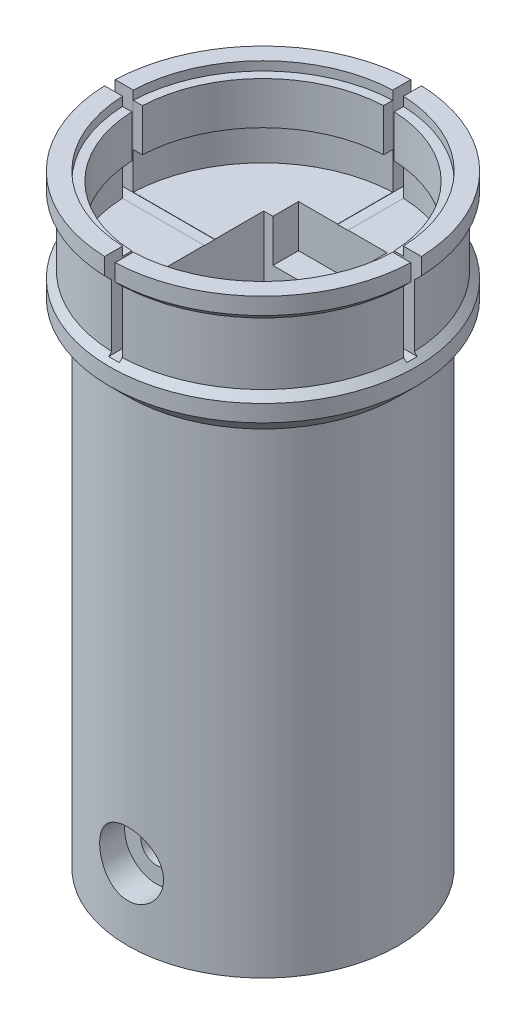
ISO-10303-21;
HEADER;
FILE_DESCRIPTION(('STEP AP214'),'2;1');
FILE_NAME('part.step','',(''),(''),'','','');
FILE_SCHEMA(('AUTOMOTIVE_DESIGN { 1 0 10303 214 1 1 1 1 }'));
ENDSEC;
DATA;
#1=APPLICATION_CONTEXT('core data for automotive mechanical design processes');
#2=APPLICATION_PROTOCOL_DEFINITION('international standard','automotive_design',2000,#1);
#3=PRODUCT_CONTEXT('',#1,'mechanical');
#4=PRODUCT('Part','Part','',(#3));
#5=PRODUCT_RELATED_PRODUCT_CATEGORY('part','',(#4));
#6=PRODUCT_DEFINITION_FORMATION('','',#4);
#7=PRODUCT_DEFINITION_CONTEXT('part definition',#1,'design');
#8=PRODUCT_DEFINITION('design','',#6,#7);
#9=PRODUCT_DEFINITION_SHAPE('','',#8);
#10=(LENGTH_UNIT() NAMED_UNIT(*) SI_UNIT(.MILLI.,.METRE.));
#11=(NAMED_UNIT(*) PLANE_ANGLE_UNIT() SI_UNIT($,.RADIAN.));
#12=(NAMED_UNIT(*) SI_UNIT($,.STERADIAN.) SOLID_ANGLE_UNIT());
#13=UNCERTAINTY_MEASURE_WITH_UNIT(LENGTH_MEASURE(1.E-05),#10,'distance_accuracy_value','');
#14=(GEOMETRIC_REPRESENTATION_CONTEXT(3) GLOBAL_UNCERTAINTY_ASSIGNED_CONTEXT((#13)) GLOBAL_UNIT_ASSIGNED_CONTEXT((#10,
#11,#12)) REPRESENTATION_CONTEXT('',''));
#15=CARTESIAN_POINT('',(0.,0.,0.));
#16=DIRECTION('',(0.,0.,1.));
#17=DIRECTION('',(1.,0.,0.));
#18=AXIS2_PLACEMENT_3D('',#15,#16,#17);
#19=CARTESIAN_POINT('',(0.,83.75,19.05));
#20=DIRECTION('',(0.,-1.,0.));
#21=DIRECTION('',(0.,0.,-1.));
#22=AXIS2_PLACEMENT_3D('',#19,#20,#21);
#23=PLANE('',#22);
#24=CARTESIAN_POINT('',(0.,83.75,0.));
#25=DIRECTION('',(0.,-1.,0.));
#26=DIRECTION('',(0.,0.,-1.));
#27=AXIS2_PLACEMENT_3D('',#24,#25,#26);
#28=CIRCLE('',#27,17.75);
#29=CARTESIAN_POINT('',(-17.7341478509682,83.75,-0.750000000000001));
#30=VERTEX_POINT('',#29);
#31=CARTESIAN_POINT('',(-0.750000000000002,83.75,-17.7341478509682));
#32=VERTEX_POINT('',#31);
#33=EDGE_CURVE('E97',#30,#32,#28,.T.);
#34=ORIENTED_EDGE('',*,*,#33,.T.);
#35=DIRECTION('',(0.,0.,-1.));
#36=VECTOR('',#35,1.);
#37=CARTESIAN_POINT('',(-0.750000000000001,83.75,19.05));
#38=LINE('',#37,#36);
#39=CARTESIAN_POINT('',(-0.750000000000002,83.75,-19.0352304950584));
#40=VERTEX_POINT('',#39);
#41=EDGE_CURVE('E61',#32,#40,#38,.T.);
#42=ORIENTED_EDGE('',*,*,#41,.T.);
#43=CARTESIAN_POINT('',(0.,83.75,0.));
#44=DIRECTION('',(0.,-1.,0.));
#45=DIRECTION('',(0.,0.,-1.));
#46=AXIS2_PLACEMENT_3D('',#43,#44,#45);
#47=CIRCLE('',#46,19.05);
#48=CARTESIAN_POINT('',(-19.0352304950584,83.75,-0.750000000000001));
#49=VERTEX_POINT('',#48);
#50=EDGE_CURVE('E99',#49,#40,#47,.T.);
#51=ORIENTED_EDGE('',*,*,#50,.F.);
#52=DIRECTION('',(1.,0.,0.));
#53=VECTOR('',#52,1.);
#54=CARTESIAN_POINT('',(0.,83.75,-0.750000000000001));
#55=LINE('',#54,#53);
#56=EDGE_CURVE('E87',#49,#30,#55,.T.);
#57=ORIENTED_EDGE('',*,*,#56,.T.);
#58=EDGE_LOOP('',(#34,#42,#51,#57));
#59=FACE_BOUND('',#58,.T.);
#60=ADVANCED_FACE('F44',(#59),#23,.F.);
#61=CARTESIAN_POINT('',(0.,72.54,0.));
#62=DIRECTION('',(0.,-1.,0.));
#63=DIRECTION('',(0.,0.,-1.));
#64=AXIS2_PLACEMENT_3D('',#61,#62,#63);
#65=CYLINDRICAL_SURFACE('',#64,17.75);
#66=CARTESIAN_POINT('',(0.,77.75,0.));
#67=DIRECTION('',(0.,-1.,0.));
#68=DIRECTION('',(0.,0.,-1.));
#69=AXIS2_PLACEMENT_3D('',#66,#67,#68);
#70=CIRCLE('',#69,17.75);
#71=CARTESIAN_POINT('',(-17.7341478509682,77.75,-0.750000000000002));
#72=VERTEX_POINT('',#71);
#73=CARTESIAN_POINT('',(-0.750000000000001,77.75,-17.7341478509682));
#74=VERTEX_POINT('',#73);
#75=EDGE_CURVE('E100',#72,#74,#70,.T.);
#76=ORIENTED_EDGE('',*,*,#75,.T.);
#77=DIRECTION('',(0.,-1.,0.));
#78=VECTOR('',#77,1.);
#79=CARTESIAN_POINT('',(-0.750000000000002,72.54,-17.7341478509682));
#80=LINE('',#79,#78);
#81=EDGE_CURVE('E70',#74,#32,#80,.F.);
#82=ORIENTED_EDGE('',*,*,#81,.T.);
#83=ORIENTED_EDGE('',*,*,#33,.F.);
#84=DIRECTION('',(0.,-1.,0.));
#85=VECTOR('',#84,1.);
#86=CARTESIAN_POINT('',(-17.7341478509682,72.54,-0.750000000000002));
#87=LINE('',#86,#85);
#88=EDGE_CURVE('E84',#30,#72,#87,.T.);
#89=ORIENTED_EDGE('',*,*,#88,.T.);
#90=EDGE_LOOP('',(#76,#82,#83,#89));
#91=FACE_BOUND('',#90,.T.);
#92=ADVANCED_FACE('F102',(#91),#65,.F.);
#93=CARTESIAN_POINT('',(0.,77.75,19.05));
#94=DIRECTION('',(0.,1.,0.));
#95=DIRECTION('',(0.,0.,1.));
#96=AXIS2_PLACEMENT_3D('',#93,#94,#95);
#97=PLANE('',#96);
#98=CARTESIAN_POINT('',(0.,77.75,0.));
#99=DIRECTION('',(0.,-1.,0.));
#100=DIRECTION('',(0.,0.,-1.));
#101=AXIS2_PLACEMENT_3D('',#98,#99,#100);
#102=CIRCLE('',#101,19.05);
#103=CARTESIAN_POINT('',(-19.0352304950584,77.75,-0.750000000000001));
#104=VERTEX_POINT('',#103);
#105=CARTESIAN_POINT('',(-0.750000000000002,77.75,-19.0352304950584));
#106=VERTEX_POINT('',#105);
#107=EDGE_CURVE('E92',#104,#106,#102,.T.);
#108=ORIENTED_EDGE('',*,*,#107,.T.);
#109=DIRECTION('',(0.,0.,1.));
#110=VECTOR('',#109,1.);
#111=CARTESIAN_POINT('',(-0.750000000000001,77.75,19.05));
#112=LINE('',#111,#110);
#113=EDGE_CURVE('E110',#106,#74,#112,.T.);
#114=ORIENTED_EDGE('',*,*,#113,.T.);
#115=ORIENTED_EDGE('',*,*,#75,.F.);
#116=DIRECTION('',(-1.,0.,0.));
#117=VECTOR('',#116,1.);
#118=CARTESIAN_POINT('',(0.,77.75,-0.750000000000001));
#119=LINE('',#118,#117);
#120=EDGE_CURVE('E47',#72,#104,#119,.T.);
#121=ORIENTED_EDGE('',*,*,#120,.T.);
#122=EDGE_LOOP('',(#108,#114,#115,#121));
#123=FACE_BOUND('',#122,.T.);
#124=ADVANCED_FACE('F116',(#123),#97,.F.);
#125=CARTESIAN_POINT('',(0.,72.54,0.));
#126=DIRECTION('',(0.,-1.,0.));
#127=DIRECTION('',(0.,0.,-1.));
#128=AXIS2_PLACEMENT_3D('',#125,#126,#127);
#129=CYLINDRICAL_SURFACE('',#128,19.05);
#130=ORIENTED_EDGE('',*,*,#50,.T.);
#131=DIRECTION('',(0.,-1.,0.));
#132=VECTOR('',#131,1.);
#133=CARTESIAN_POINT('',(-0.750000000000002,72.54,-19.0352304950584));
#134=LINE('',#133,#132);
#135=EDGE_CURVE('E53',#40,#106,#134,.T.);
#136=ORIENTED_EDGE('',*,*,#135,.T.);
#137=ORIENTED_EDGE('',*,*,#107,.F.);
#138=DIRECTION('',(0.,-1.,0.));
#139=VECTOR('',#138,1.);
#140=CARTESIAN_POINT('',(-19.0352304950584,72.54,-0.750000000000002));
#141=LINE('',#140,#139);
#142=EDGE_CURVE('E12',#104,#49,#141,.F.);
#143=ORIENTED_EDGE('',*,*,#142,.T.);
#144=EDGE_LOOP('',(#130,#136,#137,#143));
#145=FACE_BOUND('',#144,.T.);
#146=ADVANCED_FACE('F118',(#145),#129,.T.);
#147=CARTESIAN_POINT('',(-21.59,85.,-0.750000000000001));
#148=DIRECTION('',(0.,0.,-1.));
#149=DIRECTION('',(0.,1.,0.));
#150=AXIS2_PLACEMENT_3D('',#147,#148,#149);
#151=PLANE('',#150);
#152=ORIENTED_EDGE('',*,*,#120,.F.);
#153=ORIENTED_EDGE('',*,*,#88,.F.);
#154=ORIENTED_EDGE('',*,*,#56,.F.);
#155=ORIENTED_EDGE('',*,*,#142,.F.);
#156=EDGE_LOOP('',(#152,#153,#154,#155));
#157=FACE_BOUND('',#156,.T.);
#158=ADVANCED_FACE('F86',(#157),#151,.F.);
#159=CARTESIAN_POINT('',(-0.750000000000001,85.,-21.59));
#160=DIRECTION('',(-1.,0.,0.));
#161=DIRECTION('',(0.,-1.,0.));
#162=AXIS2_PLACEMENT_3D('',#159,#160,#161);
#163=PLANE('',#162);
#164=ORIENTED_EDGE('',*,*,#81,.F.);
#165=ORIENTED_EDGE('',*,*,#113,.F.);
#166=ORIENTED_EDGE('',*,*,#135,.F.);
#167=ORIENTED_EDGE('',*,*,#41,.F.);
#168=EDGE_LOOP('',(#164,#165,#166,#167));
#169=FACE_BOUND('',#168,.T.);
#170=ADVANCED_FACE('F151',(#169),#163,.F.);
#171=CLOSED_SHELL('',(#60,#92,#124,#146,#158,#170));
#172=MANIFOLD_SOLID_BREP('B2',#171);
#173=CARTESIAN_POINT('',(0.,72.54,0.));
#174=DIRECTION('',(0.,-1.,0.));
#175=DIRECTION('',(0.,0.,-1.));
#176=AXIS2_PLACEMENT_3D('',#173,#174,#175);
#177=CYLINDRICAL_SURFACE('',#176,19.05);
#178=CARTESIAN_POINT('',(0.,77.75,0.));
#179=DIRECTION('',(0.,-1.,0.));
#180=DIRECTION('',(0.,0.,-1.));
#181=AXIS2_PLACEMENT_3D('',#178,#179,#180);
#182=CIRCLE('',#181,19.05);
#183=CARTESIAN_POINT('',(-0.750000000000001,77.75,19.0352304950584));
#184=VERTEX_POINT('',#183);
#185=CARTESIAN_POINT('',(-19.0352304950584,77.75,0.750000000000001));
#186=VERTEX_POINT('',#185);
#187=EDGE_CURVE('E221',#184,#186,#182,.T.);
#188=ORIENTED_EDGE('',*,*,#187,.F.);
#189=DIRECTION('',(0.,-1.,0.));
#190=VECTOR('',#189,1.);
#191=CARTESIAN_POINT('',(-0.750000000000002,72.54,19.0352304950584));
#192=LINE('',#191,#190);
#193=CARTESIAN_POINT('',(-0.750000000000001,83.75,19.0352304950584));
#194=VERTEX_POINT('',#193);
#195=EDGE_CURVE('E195',#184,#194,#192,.F.);
#196=ORIENTED_EDGE('',*,*,#195,.T.);
#197=CARTESIAN_POINT('',(0.,83.75,0.));
#198=DIRECTION('',(0.,-1.,0.));
#199=DIRECTION('',(0.,0.,-1.));
#200=AXIS2_PLACEMENT_3D('',#197,#198,#199);
#201=CIRCLE('',#200,19.05);
#202=CARTESIAN_POINT('',(-19.0352304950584,83.75,0.750000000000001));
#203=VERTEX_POINT('',#202);
#204=EDGE_CURVE('E181',#194,#203,#201,.T.);
#205=ORIENTED_EDGE('',*,*,#204,.T.);
#206=DIRECTION('',(0.,-1.,0.));
#207=VECTOR('',#206,1.);
#208=CARTESIAN_POINT('',(-19.0352304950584,72.54,0.750000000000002));
#209=LINE('',#208,#207);
#210=EDGE_CURVE('E228',#203,#186,#209,.T.);
#211=ORIENTED_EDGE('',*,*,#210,.T.);
#212=EDGE_LOOP('',(#188,#196,#205,#211));
#213=FACE_BOUND('',#212,.T.);
#214=ADVANCED_FACE('F178',(#213),#177,.T.);
#215=CARTESIAN_POINT('',(0.,77.75,19.05));
#216=DIRECTION('',(0.,1.,0.));
#217=DIRECTION('',(0.,0.,1.));
#218=AXIS2_PLACEMENT_3D('',#215,#216,#217);
#219=PLANE('',#218);
#220=CARTESIAN_POINT('',(0.,77.75,0.));
#221=DIRECTION('',(0.,-1.,0.));
#222=DIRECTION('',(0.,0.,-1.));
#223=AXIS2_PLACEMENT_3D('',#220,#221,#222);
#224=CIRCLE('',#223,17.75);
#225=CARTESIAN_POINT('',(-0.750000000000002,77.75,17.7341478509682));
#226=VERTEX_POINT('',#225);
#227=CARTESIAN_POINT('',(-17.7341478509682,77.75,0.750000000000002));
#228=VERTEX_POINT('',#227);
#229=EDGE_CURVE('E255',#226,#228,#224,.T.);
#230=ORIENTED_EDGE('',*,*,#229,.F.);
#231=DIRECTION('',(0.,0.,1.));
#232=VECTOR('',#231,1.);
#233=CARTESIAN_POINT('',(-0.750000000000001,77.75,19.05));
#234=LINE('',#233,#232);
#235=EDGE_CURVE('E204',#226,#184,#234,.T.);
#236=ORIENTED_EDGE('',*,*,#235,.T.);
#237=ORIENTED_EDGE('',*,*,#187,.T.);
#238=DIRECTION('',(1.,0.,0.));
#239=VECTOR('',#238,1.);
#240=CARTESIAN_POINT('',(0.,77.75,0.750000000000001));
#241=LINE('',#240,#239);
#242=EDGE_CURVE('E233',#186,#228,#241,.T.);
#243=ORIENTED_EDGE('',*,*,#242,.T.);
#244=EDGE_LOOP('',(#230,#236,#237,#243));
#245=FACE_BOUND('',#244,.T.);
#246=ADVANCED_FACE('F245',(#245),#219,.F.);
#247=CARTESIAN_POINT('',(0.,72.54,0.));
#248=DIRECTION('',(0.,-1.,0.));
#249=DIRECTION('',(0.,0.,-1.));
#250=AXIS2_PLACEMENT_3D('',#247,#248,#249);
#251=CYLINDRICAL_SURFACE('',#250,17.75);
#252=CARTESIAN_POINT('',(0.,83.75,0.));
#253=DIRECTION('',(0.,-1.,0.));
#254=DIRECTION('',(0.,0.,-1.));
#255=AXIS2_PLACEMENT_3D('',#252,#253,#254);
#256=CIRCLE('',#255,17.75);
#257=CARTESIAN_POINT('',(-0.750000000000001,83.75,17.7341478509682));
#258=VERTEX_POINT('',#257);
#259=CARTESIAN_POINT('',(-17.7341478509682,83.75,0.750000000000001));
#260=VERTEX_POINT('',#259);
#261=EDGE_CURVE('E187',#258,#260,#256,.T.);
#262=ORIENTED_EDGE('',*,*,#261,.F.);
#263=DIRECTION('',(0.,-1.,0.));
#264=VECTOR('',#263,1.);
#265=CARTESIAN_POINT('',(-0.750000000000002,72.54,17.7341478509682));
#266=LINE('',#265,#264);
#267=EDGE_CURVE('E257',#258,#226,#266,.T.);
#268=ORIENTED_EDGE('',*,*,#267,.T.);
#269=ORIENTED_EDGE('',*,*,#229,.T.);
#270=DIRECTION('',(0.,-1.,0.));
#271=VECTOR('',#270,1.);
#272=CARTESIAN_POINT('',(-17.7341478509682,72.54,0.750000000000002));
#273=LINE('',#272,#271);
#274=EDGE_CURVE('E256',#228,#260,#273,.F.);
#275=ORIENTED_EDGE('',*,*,#274,.T.);
#276=EDGE_LOOP('',(#262,#268,#269,#275));
#277=FACE_BOUND('',#276,.T.);
#278=ADVANCED_FACE('F237',(#277),#251,.F.);
#279=CARTESIAN_POINT('',(0.,83.75,19.05));
#280=DIRECTION('',(0.,-1.,0.));
#281=DIRECTION('',(0.,0.,-1.));
#282=AXIS2_PLACEMENT_3D('',#279,#280,#281);
#283=PLANE('',#282);
#284=ORIENTED_EDGE('',*,*,#204,.F.);
#285=DIRECTION('',(0.,0.,-1.));
#286=VECTOR('',#285,1.);
#287=CARTESIAN_POINT('',(-0.750000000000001,83.75,19.05));
#288=LINE('',#287,#286);
#289=EDGE_CURVE('E259',#194,#258,#288,.T.);
#290=ORIENTED_EDGE('',*,*,#289,.T.);
#291=ORIENTED_EDGE('',*,*,#261,.T.);
#292=DIRECTION('',(-1.,0.,0.));
#293=VECTOR('',#292,1.);
#294=CARTESIAN_POINT('',(0.,83.75,0.750000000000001));
#295=LINE('',#294,#293);
#296=EDGE_CURVE('E42',#260,#203,#295,.T.);
#297=ORIENTED_EDGE('',*,*,#296,.T.);
#298=EDGE_LOOP('',(#284,#290,#291,#297));
#299=FACE_BOUND('',#298,.T.);
#300=ADVANCED_FACE('F235',(#299),#283,.F.);
#301=CARTESIAN_POINT('',(-21.59,85.,0.750000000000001));
#302=DIRECTION('',(0.,0.,1.));
#303=DIRECTION('',(0.,-1.,0.));
#304=AXIS2_PLACEMENT_3D('',#301,#302,#303);
#305=PLANE('',#304);
#306=ORIENTED_EDGE('',*,*,#296,.F.);
#307=ORIENTED_EDGE('',*,*,#274,.F.);
#308=ORIENTED_EDGE('',*,*,#242,.F.);
#309=ORIENTED_EDGE('',*,*,#210,.F.);
#310=EDGE_LOOP('',(#306,#307,#308,#309));
#311=FACE_BOUND('',#310,.T.);
#312=ADVANCED_FACE('F230',(#311),#305,.F.);
#313=CARTESIAN_POINT('',(-0.750000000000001,85.,-21.59));
#314=DIRECTION('',(-1.,0.,0.));
#315=DIRECTION('',(0.,-1.,0.));
#316=AXIS2_PLACEMENT_3D('',#313,#314,#315);
#317=PLANE('',#316);
#318=ORIENTED_EDGE('',*,*,#235,.F.);
#319=ORIENTED_EDGE('',*,*,#267,.F.);
#320=ORIENTED_EDGE('',*,*,#289,.F.);
#321=ORIENTED_EDGE('',*,*,#195,.F.);
#322=EDGE_LOOP('',(#318,#319,#320,#321));
#323=FACE_BOUND('',#322,.T.);
#324=ADVANCED_FACE('F243',(#323),#317,.F.);
#325=CLOSED_SHELL('',(#214,#246,#278,#300,#312,#324));
#326=MANIFOLD_SOLID_BREP('B6',#325);
#327=CARTESIAN_POINT('',(-21.59,85.,0.750000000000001));
#328=DIRECTION('',(0.,0.,1.));
#329=DIRECTION('',(0.,-1.,0.));
#330=AXIS2_PLACEMENT_3D('',#327,#328,#329);
#331=PLANE('',#330);
#332=DIRECTION('',(1.,0.,0.));
#333=VECTOR('',#332,1.);
#334=CARTESIAN_POINT('',(0.,77.75,0.750000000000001));
#335=LINE('',#334,#333);
#336=CARTESIAN_POINT('',(17.7341478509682,77.75,0.750000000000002));
#337=VERTEX_POINT('',#336);
#338=CARTESIAN_POINT('',(19.0352304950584,77.75,0.750000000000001));
#339=VERTEX_POINT('',#338);
#340=EDGE_CURVE('E344',#337,#339,#335,.T.);
#341=ORIENTED_EDGE('',*,*,#340,.F.);
#342=DIRECTION('',(0.,-1.,0.));
#343=VECTOR('',#342,1.);
#344=CARTESIAN_POINT('',(17.7341478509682,72.54,0.750000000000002));
#345=LINE('',#344,#343);
#346=CARTESIAN_POINT('',(17.7341478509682,83.75,0.750000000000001));
#347=VERTEX_POINT('',#346);
#348=EDGE_CURVE('E371',#347,#337,#345,.T.);
#349=ORIENTED_EDGE('',*,*,#348,.F.);
#350=DIRECTION('',(-1.,0.,0.));
#351=VECTOR('',#350,1.);
#352=CARTESIAN_POINT('',(0.,83.75,0.750000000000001));
#353=LINE('',#352,#351);
#354=CARTESIAN_POINT('',(19.0352304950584,83.75,0.750000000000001));
#355=VERTEX_POINT('',#354);
#356=EDGE_CURVE('E369',#355,#347,#353,.T.);
#357=ORIENTED_EDGE('',*,*,#356,.F.);
#358=DIRECTION('',(0.,-1.,0.));
#359=VECTOR('',#358,1.);
#360=CARTESIAN_POINT('',(19.0352304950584,72.54,0.750000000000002));
#361=LINE('',#360,#359);
#362=EDGE_CURVE('E335',#339,#355,#361,.F.);
#363=ORIENTED_EDGE('',*,*,#362,.F.);
#364=EDGE_LOOP('',(#341,#349,#357,#363));
#365=FACE_BOUND('',#364,.T.);
#366=ADVANCED_FACE('F312',(#365),#331,.F.);
#367=CARTESIAN_POINT('',(0.,83.75,19.05));
#368=DIRECTION('',(0.,-1.,0.));
#369=DIRECTION('',(0.,0.,-1.));
#370=AXIS2_PLACEMENT_3D('',#367,#368,#369);
#371=PLANE('',#370);
#372=CARTESIAN_POINT('',(0.,83.75,0.));
#373=DIRECTION('',(0.,-1.,0.));
#374=DIRECTION('',(0.,0.,-1.));
#375=AXIS2_PLACEMENT_3D('',#372,#373,#374);
#376=CIRCLE('',#375,17.75);
#377=CARTESIAN_POINT('',(0.750000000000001,83.75,17.7341478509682));
#378=VERTEX_POINT('',#377);
#379=EDGE_CURVE('E320',#347,#378,#376,.T.);
#380=ORIENTED_EDGE('',*,*,#379,.T.);
#381=DIRECTION('',(0.,0.,1.));
#382=VECTOR('',#381,1.);
#383=CARTESIAN_POINT('',(0.750000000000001,83.75,19.05));
#384=LINE('',#383,#382);
#385=CARTESIAN_POINT('',(0.750000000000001,83.75,19.0352304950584));
#386=VERTEX_POINT('',#385);
#387=EDGE_CURVE('E176',#378,#386,#384,.T.);
#388=ORIENTED_EDGE('',*,*,#387,.T.);
#389=CARTESIAN_POINT('',(0.,83.75,0.));
#390=DIRECTION('',(0.,-1.,0.));
#391=DIRECTION('',(0.,0.,-1.));
#392=AXIS2_PLACEMENT_3D('',#389,#390,#391);
#393=CIRCLE('',#392,19.05);
#394=EDGE_CURVE('E375',#355,#386,#393,.T.);
#395=ORIENTED_EDGE('',*,*,#394,.F.);
#396=ORIENTED_EDGE('',*,*,#356,.T.);
#397=EDGE_LOOP('',(#380,#388,#395,#396));
#398=FACE_BOUND('',#397,.T.);
#399=ADVANCED_FACE('F368',(#398),#371,.F.);
#400=CARTESIAN_POINT('',(0.,72.54,0.));
#401=DIRECTION('',(0.,-1.,0.));
#402=DIRECTION('',(0.,0.,-1.));
#403=AXIS2_PLACEMENT_3D('',#400,#401,#402);
#404=CYLINDRICAL_SURFACE('',#403,17.75);
#405=CARTESIAN_POINT('',(0.,77.75,0.));
#406=DIRECTION('',(0.,-1.,0.));
#407=DIRECTION('',(0.,0.,-1.));
#408=AXIS2_PLACEMENT_3D('',#405,#406,#407);
#409=CIRCLE('',#408,17.75);
#410=CARTESIAN_POINT('',(0.750000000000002,77.75,17.7341478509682));
#411=VERTEX_POINT('',#410);
#412=EDGE_CURVE('E365',#337,#411,#409,.T.);
#413=ORIENTED_EDGE('',*,*,#412,.T.);
#414=DIRECTION('',(0.,-1.,0.));
#415=VECTOR('',#414,1.);
#416=CARTESIAN_POINT('',(0.750000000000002,72.54,17.7341478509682));
#417=LINE('',#416,#415);
#418=EDGE_CURVE('E355',#411,#378,#417,.F.);
#419=ORIENTED_EDGE('',*,*,#418,.T.);
#420=ORIENTED_EDGE('',*,*,#379,.F.);
#421=ORIENTED_EDGE('',*,*,#348,.T.);
#422=EDGE_LOOP('',(#413,#419,#420,#421));
#423=FACE_BOUND('',#422,.T.);
#424=ADVANCED_FACE('F363',(#423),#404,.F.);
#425=CARTESIAN_POINT('',(0.,77.75,19.05));
#426=DIRECTION('',(0.,1.,0.));
#427=DIRECTION('',(0.,0.,1.));
#428=AXIS2_PLACEMENT_3D('',#425,#426,#427);
#429=PLANE('',#428);
#430=CARTESIAN_POINT('',(0.,77.75,0.));
#431=DIRECTION('',(0.,-1.,0.));
#432=DIRECTION('',(0.,0.,-1.));
#433=AXIS2_PLACEMENT_3D('',#430,#431,#432);
#434=CIRCLE('',#433,19.05);
#435=CARTESIAN_POINT('',(0.750000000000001,77.75,19.0352304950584));
#436=VERTEX_POINT('',#435);
#437=EDGE_CURVE('E377',#339,#436,#434,.T.);
#438=ORIENTED_EDGE('',*,*,#437,.T.);
#439=DIRECTION('',(0.,0.,-1.));
#440=VECTOR('',#439,1.);
#441=CARTESIAN_POINT('',(0.750000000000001,77.75,19.05));
#442=LINE('',#441,#440);
#443=EDGE_CURVE('E349',#436,#411,#442,.T.);
#444=ORIENTED_EDGE('',*,*,#443,.T.);
#445=ORIENTED_EDGE('',*,*,#412,.F.);
#446=ORIENTED_EDGE('',*,*,#340,.T.);
#447=EDGE_LOOP('',(#438,#444,#445,#446));
#448=FACE_BOUND('',#447,.T.);
#449=ADVANCED_FACE('F386',(#448),#429,.F.);
#450=CARTESIAN_POINT('',(0.,72.54,0.));
#451=DIRECTION('',(0.,-1.,0.));
#452=DIRECTION('',(0.,0.,-1.));
#453=AXIS2_PLACEMENT_3D('',#450,#451,#452);
#454=CYLINDRICAL_SURFACE('',#453,19.05);
#455=ORIENTED_EDGE('',*,*,#394,.T.);
#456=DIRECTION('',(0.,-1.,0.));
#457=VECTOR('',#456,1.);
#458=CARTESIAN_POINT('',(0.750000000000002,72.54,19.0352304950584));
#459=LINE('',#458,#457);
#460=EDGE_CURVE('E327',#386,#436,#459,.T.);
#461=ORIENTED_EDGE('',*,*,#460,.T.);
#462=ORIENTED_EDGE('',*,*,#437,.F.);
#463=ORIENTED_EDGE('',*,*,#362,.T.);
#464=EDGE_LOOP('',(#455,#461,#462,#463));
#465=FACE_BOUND('',#464,.T.);
#466=ADVANCED_FACE('F314',(#465),#454,.T.);
#467=CARTESIAN_POINT('',(0.750000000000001,85.,-21.59));
#468=DIRECTION('',(1.,0.,0.));
#469=DIRECTION('',(0.,1.,0.));
#470=AXIS2_PLACEMENT_3D('',#467,#468,#469);
#471=PLANE('',#470);
#472=ORIENTED_EDGE('',*,*,#387,.F.);
#473=ORIENTED_EDGE('',*,*,#418,.F.);
#474=ORIENTED_EDGE('',*,*,#443,.F.);
#475=ORIENTED_EDGE('',*,*,#460,.F.);
#476=EDGE_LOOP('',(#472,#473,#474,#475));
#477=FACE_BOUND('',#476,.T.);
#478=ADVANCED_FACE('F354',(#477),#471,.F.);
#479=CLOSED_SHELL('',(#366,#399,#424,#449,#466,#478));
#480=MANIFOLD_SOLID_BREP('B36',#479);
#481=CARTESIAN_POINT('',(-21.59,85.,-0.750000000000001));
#482=DIRECTION('',(0.,0.,-1.));
#483=DIRECTION('',(0.,1.,0.));
#484=AXIS2_PLACEMENT_3D('',#481,#482,#483);
#485=PLANE('',#484);
#486=DIRECTION('',(1.,0.,0.));
#487=VECTOR('',#486,1.);
#488=CARTESIAN_POINT('',(0.,83.75,-0.750000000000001));
#489=LINE('',#488,#487);
#490=CARTESIAN_POINT('',(17.7341478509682,83.75,-0.750000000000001));
#491=VERTEX_POINT('',#490);
#492=CARTESIAN_POINT('',(19.0352304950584,83.75,-0.750000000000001));
#493=VERTEX_POINT('',#492);
#494=EDGE_CURVE('E454',#491,#493,#489,.T.);
#495=ORIENTED_EDGE('',*,*,#494,.F.);
#496=DIRECTION('',(0.,-1.,0.));
#497=VECTOR('',#496,1.);
#498=CARTESIAN_POINT('',(17.7341478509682,72.54,-0.750000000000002));
#499=LINE('',#498,#497);
#500=CARTESIAN_POINT('',(17.7341478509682,77.75,-0.750000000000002));
#501=VERTEX_POINT('',#500);
#502=EDGE_CURVE('E509',#501,#491,#499,.F.);
#503=ORIENTED_EDGE('',*,*,#502,.F.);
#504=DIRECTION('',(-1.,0.,0.));
#505=VECTOR('',#504,1.);
#506=CARTESIAN_POINT('',(0.,77.75,-0.750000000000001));
#507=LINE('',#506,#505);
#508=CARTESIAN_POINT('',(19.0352304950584,77.75,-0.750000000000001));
#509=VERTEX_POINT('',#508);
#510=EDGE_CURVE('E507',#509,#501,#507,.T.);
#511=ORIENTED_EDGE('',*,*,#510,.F.);
#512=DIRECTION('',(0.,-1.,0.));
#513=VECTOR('',#512,1.);
#514=CARTESIAN_POINT('',(19.0352304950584,72.54,-0.750000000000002));
#515=LINE('',#514,#513);
#516=EDGE_CURVE('E498',#493,#509,#515,.T.);
#517=ORIENTED_EDGE('',*,*,#516,.F.);
#518=EDGE_LOOP('',(#495,#503,#511,#517));
#519=FACE_BOUND('',#518,.T.);
#520=ADVANCED_FACE('F446',(#519),#485,.F.);
#521=CARTESIAN_POINT('',(0.,72.54,0.));
#522=DIRECTION('',(0.,-1.,0.));
#523=DIRECTION('',(0.,0.,-1.));
#524=AXIS2_PLACEMENT_3D('',#521,#522,#523);
#525=CYLINDRICAL_SURFACE('',#524,19.05);
#526=CARTESIAN_POINT('',(0.,77.75,0.));
#527=DIRECTION('',(0.,-1.,0.));
#528=DIRECTION('',(0.,0.,-1.));
#529=AXIS2_PLACEMENT_3D('',#526,#527,#528);
#530=CIRCLE('',#529,19.05);
#531=CARTESIAN_POINT('',(0.750000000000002,77.75,-19.0352304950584));
#532=VERTEX_POINT('',#531);
#533=EDGE_CURVE('E493',#532,#509,#530,.T.);
#534=ORIENTED_EDGE('',*,*,#533,.F.);
#535=DIRECTION('',(0.,-1.,0.));
#536=VECTOR('',#535,1.);
#537=CARTESIAN_POINT('',(0.750000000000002,72.54,-19.0352304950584));
#538=LINE('',#537,#536);
#539=CARTESIAN_POINT('',(0.750000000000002,83.75,-19.0352304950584));
#540=VERTEX_POINT('',#539);
#541=EDGE_CURVE('E310',#532,#540,#538,.F.);
#542=ORIENTED_EDGE('',*,*,#541,.T.);
#543=CARTESIAN_POINT('',(0.,83.75,0.));
#544=DIRECTION('',(0.,-1.,0.));
#545=DIRECTION('',(0.,0.,-1.));
#546=AXIS2_PLACEMENT_3D('',#543,#544,#545);
#547=CIRCLE('',#546,19.05);
#548=EDGE_CURVE('E467',#540,#493,#547,.T.);
#549=ORIENTED_EDGE('',*,*,#548,.T.);
#550=ORIENTED_EDGE('',*,*,#516,.T.);
#551=EDGE_LOOP('',(#534,#542,#549,#550));
#552=FACE_BOUND('',#551,.T.);
#553=ADVANCED_FACE('F448',(#552),#525,.T.);
#554=CARTESIAN_POINT('',(0.,77.75,19.05));
#555=DIRECTION('',(0.,1.,0.));
#556=DIRECTION('',(0.,0.,1.));
#557=AXIS2_PLACEMENT_3D('',#554,#555,#556);
#558=PLANE('',#557);
#559=CARTESIAN_POINT('',(0.,77.75,0.));
#560=DIRECTION('',(0.,-1.,0.));
#561=DIRECTION('',(0.,0.,-1.));
#562=AXIS2_PLACEMENT_3D('',#559,#560,#561);
#563=CIRCLE('',#562,17.75);
#564=CARTESIAN_POINT('',(0.750000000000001,77.75,-17.7341478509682));
#565=VERTEX_POINT('',#564);
#566=EDGE_CURVE('E495',#565,#501,#563,.T.);
#567=ORIENTED_EDGE('',*,*,#566,.F.);
#568=DIRECTION('',(0.,0.,-1.));
#569=VECTOR('',#568,1.);
#570=CARTESIAN_POINT('',(0.750000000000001,77.75,19.05));
#571=LINE('',#570,#569);
#572=EDGE_CURVE('E486',#565,#532,#571,.T.);
#573=ORIENTED_EDGE('',*,*,#572,.T.);
#574=ORIENTED_EDGE('',*,*,#533,.T.);
#575=ORIENTED_EDGE('',*,*,#510,.T.);
#576=EDGE_LOOP('',(#567,#573,#574,#575));
#577=FACE_BOUND('',#576,.T.);
#578=ADVANCED_FACE('F491',(#577),#558,.F.);
#579=CARTESIAN_POINT('',(0.,72.54,0.));
#580=DIRECTION('',(0.,-1.,0.));
#581=DIRECTION('',(0.,0.,-1.));
#582=AXIS2_PLACEMENT_3D('',#579,#580,#581);
#583=CYLINDRICAL_SURFACE('',#582,17.75);
#584=CARTESIAN_POINT('',(0.,83.75,0.));
#585=DIRECTION('',(0.,-1.,0.));
#586=DIRECTION('',(0.,0.,-1.));
#587=AXIS2_PLACEMENT_3D('',#584,#585,#586);
#588=CIRCLE('',#587,17.75);
#589=CARTESIAN_POINT('',(0.750000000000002,83.75,-17.7341478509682));
#590=VERTEX_POINT('',#589);
#591=EDGE_CURVE('E501',#590,#491,#588,.T.);
#592=ORIENTED_EDGE('',*,*,#591,.F.);
#593=DIRECTION('',(0.,-1.,0.));
#594=VECTOR('',#593,1.);
#595=CARTESIAN_POINT('',(0.750000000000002,72.54,-17.7341478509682));
#596=LINE('',#595,#594);
#597=EDGE_CURVE('E496',#590,#565,#596,.T.);
#598=ORIENTED_EDGE('',*,*,#597,.T.);
#599=ORIENTED_EDGE('',*,*,#566,.T.);
#600=ORIENTED_EDGE('',*,*,#502,.T.);
#601=EDGE_LOOP('',(#592,#598,#599,#600));
#602=FACE_BOUND('',#601,.T.);
#603=ADVANCED_FACE('F515',(#602),#583,.F.);
#604=CARTESIAN_POINT('',(0.,83.75,19.05));
#605=DIRECTION('',(0.,-1.,0.));
#606=DIRECTION('',(0.,0.,-1.));
#607=AXIS2_PLACEMENT_3D('',#604,#605,#606);
#608=PLANE('',#607);
#609=ORIENTED_EDGE('',*,*,#548,.F.);
#610=DIRECTION('',(0.,0.,1.));
#611=VECTOR('',#610,1.);
#612=CARTESIAN_POINT('',(0.750000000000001,83.75,19.05));
#613=LINE('',#612,#611);
#614=EDGE_CURVE('E461',#540,#590,#613,.T.);
#615=ORIENTED_EDGE('',*,*,#614,.T.);
#616=ORIENTED_EDGE('',*,*,#591,.T.);
#617=ORIENTED_EDGE('',*,*,#494,.T.);
#618=EDGE_LOOP('',(#609,#615,#616,#617));
#619=FACE_BOUND('',#618,.T.);
#620=ADVANCED_FACE('F518',(#619),#608,.F.);
#621=CARTESIAN_POINT('',(0.750000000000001,85.,-21.59));
#622=DIRECTION('',(1.,0.,0.));
#623=DIRECTION('',(0.,1.,0.));
#624=AXIS2_PLACEMENT_3D('',#621,#622,#623);
#625=PLANE('',#624);
#626=ORIENTED_EDGE('',*,*,#541,.F.);
#627=ORIENTED_EDGE('',*,*,#572,.F.);
#628=ORIENTED_EDGE('',*,*,#597,.F.);
#629=ORIENTED_EDGE('',*,*,#614,.F.);
#630=EDGE_LOOP('',(#626,#627,#628,#629));
#631=FACE_BOUND('',#630,.T.);
#632=ADVANCED_FACE('F485',(#631),#625,.F.);
#633=CLOSED_SHELL('',(#520,#553,#578,#603,#620,#632));
#634=MANIFOLD_SOLID_BREP('B170',#633);
#635=CARTESIAN_POINT('',(0.,85.,0.));
#636=DIRECTION('',(0.,-1.,0.));
#637=DIRECTION('',(0.,0.,-1.));
#638=AXIS2_PLACEMENT_3D('',#635,#636,#637);
#639=CYLINDRICAL_SURFACE('',#638,21.59);
#640=CARTESIAN_POINT('',(0.,82.635625,0.));
#641=DIRECTION('',(0.,-1.,0.));
#642=DIRECTION('',(0.,0.,-1.));
#643=AXIS2_PLACEMENT_3D('',#640,#641,#642);
#644=CIRCLE('',#643,21.59);
#645=CARTESIAN_POINT('',(0.750000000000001,82.635625,-21.5769692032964));
#646=VERTEX_POINT('',#645);
#647=CARTESIAN_POINT('',(21.5769692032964,82.635625,-0.750000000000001));
#648=VERTEX_POINT('',#647);
#649=EDGE_CURVE('E1066',#646,#648,#644,.T.);
#650=ORIENTED_EDGE('',*,*,#649,.F.);
#651=DIRECTION('',(0.,-1.,0.));
#652=VECTOR('',#651,1.);
#653=CARTESIAN_POINT('',(0.750000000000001,85.,-21.5769692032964));
#654=LINE('',#653,#652);
#655=CARTESIAN_POINT('',(0.750000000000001,85.,-21.5769692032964));
#656=VERTEX_POINT('',#655);
#657=EDGE_CURVE('E973',#646,#656,#654,.F.);
#658=ORIENTED_EDGE('',*,*,#657,.T.);
#659=CARTESIAN_POINT('',(0.,85.,0.));
#660=DIRECTION('',(0.,1.,0.));
#661=DIRECTION('',(0.,0.,1.));
#662=AXIS2_PLACEMENT_3D('',#659,#660,#661);
#663=CIRCLE('',#662,21.59);
#664=CARTESIAN_POINT('',(21.5769692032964,85.,-0.750000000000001));
#665=VERTEX_POINT('',#664);
#666=EDGE_CURVE('E1335',#665,#656,#663,.T.);
#667=ORIENTED_EDGE('',*,*,#666,.F.);
#668=DIRECTION('',(0.,-1.,0.));
#669=VECTOR('',#668,1.);
#670=CARTESIAN_POINT('',(21.5769692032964,85.,-0.750000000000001));
#671=LINE('',#670,#669);
#672=EDGE_CURVE('E1147',#665,#648,#671,.T.);
#673=ORIENTED_EDGE('',*,*,#672,.T.);
#674=EDGE_LOOP('',(#650,#658,#667,#673));
#675=FACE_BOUND('',#674,.T.);
#676=ADVANCED_FACE('F571',(#675),#639,.T.);
#677=CARTESIAN_POINT('',(-0.750000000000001,82.635625,21.5769692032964));
#678=VERTEX_POINT('',#677);
#679=CARTESIAN_POINT('',(-21.5769692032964,82.635625,0.750000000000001));
#680=VERTEX_POINT('',#679);
#681=EDGE_CURVE('E1065',#678,#680,#644,.T.);
#682=ORIENTED_EDGE('',*,*,#681,.F.);
#683=DIRECTION('',(0.,-1.,0.));
#684=VECTOR('',#683,1.);
#685=CARTESIAN_POINT('',(-0.750000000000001,85.,21.5769692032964));
#686=LINE('',#685,#684);
#687=CARTESIAN_POINT('',(-0.750000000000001,85.,21.5769692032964));
#688=VERTEX_POINT('',#687);
#689=EDGE_CURVE('E1028',#678,#688,#686,.F.);
#690=ORIENTED_EDGE('',*,*,#689,.T.);
#691=CARTESIAN_POINT('',(-21.5769692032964,85.,0.750000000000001));
#692=VERTEX_POINT('',#691);
#693=EDGE_CURVE('E1331',#692,#688,#663,.T.);
#694=ORIENTED_EDGE('',*,*,#693,.F.);
#695=DIRECTION('',(0.,-1.,0.));
#696=VECTOR('',#695,1.);
#697=CARTESIAN_POINT('',(-21.5769692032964,85.,0.750000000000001));
#698=LINE('',#697,#696);
#699=EDGE_CURVE('E1172',#692,#680,#698,.T.);
#700=ORIENTED_EDGE('',*,*,#699,.T.);
#701=EDGE_LOOP('',(#682,#690,#694,#700));
#702=FACE_BOUND('',#701,.T.);
#703=ADVANCED_FACE('F1415',(#702),#639,.T.);
#704=CARTESIAN_POINT('',(0.,85.,0.));
#705=DIRECTION('',(0.,1.,0.));
#706=DIRECTION('',(0.,0.,1.));
#707=AXIS2_PLACEMENT_3D('',#704,#705,#706);
#708=PLANE('',#707);
#709=DIRECTION('',(0.,0.,1.));
#710=VECTOR('',#709,1.);
#711=CARTESIAN_POINT('',(-0.750000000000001,85.,-21.59));
#712=LINE('',#711,#710);
#713=CARTESIAN_POINT('',(-0.750000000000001,85.,19.0352304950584));
#714=VERTEX_POINT('',#713);
#715=EDGE_CURVE('E1452',#714,#688,#712,.T.);
#716=ORIENTED_EDGE('',*,*,#715,.F.);
#717=CARTESIAN_POINT('',(0.,85.,0.));
#718=DIRECTION('',(0.,1.,0.));
#719=DIRECTION('',(0.,0.,1.));
#720=AXIS2_PLACEMENT_3D('',#717,#718,#719);
#721=CIRCLE('',#720,19.05);
#722=CARTESIAN_POINT('',(-19.0352304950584,85.,0.750000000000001));
#723=VERTEX_POINT('',#722);
#724=EDGE_CURVE('E1296',#723,#714,#721,.T.);
#725=ORIENTED_EDGE('',*,*,#724,.F.);
#726=DIRECTION('',(1.,0.,0.));
#727=VECTOR('',#726,1.);
#728=CARTESIAN_POINT('',(-21.59,85.,0.750000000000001));
#729=LINE('',#728,#727);
#730=EDGE_CURVE('E1518',#692,#723,#729,.T.);
#731=ORIENTED_EDGE('',*,*,#730,.F.);
#732=ORIENTED_EDGE('',*,*,#693,.T.);
#733=EDGE_LOOP('',(#716,#725,#731,#732));
#734=FACE_BOUND('',#733,.T.);
#735=ADVANCED_FACE('F1405',(#734),#708,.T.);
#736=CARTESIAN_POINT('',(0.,16.1184632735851,0.));
#737=DIRECTION('',(0.,1.,0.));
#738=DIRECTION('',(0.,0.,1.));
#739=AXIS2_PLACEMENT_3D('',#736,#737,#738);
#740=CYLINDRICAL_SURFACE('',#739,19.05);
#741=ORIENTED_EDGE('',*,*,#724,.T.);
#742=DIRECTION('',(0.,1.,0.));
#743=VECTOR('',#742,1.);
#744=CARTESIAN_POINT('',(-0.750000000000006,16.1184632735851,19.0352304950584));
#745=LINE('',#744,#743);
#746=CARTESIAN_POINT('',(-0.750000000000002,72.54,19.0352304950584));
#747=VERTEX_POINT('',#746);
#748=EDGE_CURVE('E1044',#714,#747,#745,.F.);
#749=ORIENTED_EDGE('',*,*,#748,.T.);
#750=CARTESIAN_POINT('',(0.,72.54,0.));
#751=DIRECTION('',(0.,1.,0.));
#752=DIRECTION('',(0.,0.,1.));
#753=AXIS2_PLACEMENT_3D('',#750,#751,#752);
#754=CIRCLE('',#753,19.05);
#755=CARTESIAN_POINT('',(-19.0352304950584,72.54,0.750000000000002));
#756=VERTEX_POINT('',#755);
#757=EDGE_CURVE('E1306',#747,#756,#754,.F.);
#758=ORIENTED_EDGE('',*,*,#757,.T.);
#759=DIRECTION('',(0.,1.,0.));
#760=VECTOR('',#759,1.);
#761=CARTESIAN_POINT('',(-19.0352304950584,16.1184632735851,0.750000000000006));
#762=LINE('',#761,#760);
#763=EDGE_CURVE('E1173',#756,#723,#762,.T.);
#764=ORIENTED_EDGE('',*,*,#763,.T.);
#765=EDGE_LOOP('',(#741,#749,#758,#764));
#766=FACE_BOUND('',#765,.T.);
#767=ADVANCED_FACE('F1380',(#766),#740,.F.);
#768=CARTESIAN_POINT('',(0.,72.54,0.));
#769=DIRECTION('',(0.,1.,0.));
#770=DIRECTION('',(0.,0.,1.));
#771=AXIS2_PLACEMENT_3D('',#768,#769,#770);
#772=PLANE('',#771);
#773=DIRECTION('',(0.,0.,1.));
#774=VECTOR('',#773,1.);
#775=CARTESIAN_POINT('',(-0.750000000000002,72.54,0.));
#776=LINE('',#775,#774);
#777=CARTESIAN_POINT('',(-0.750000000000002,72.54,11.25));
#778=VERTEX_POINT('',#777);
#779=EDGE_CURVE('E1042',#778,#747,#776,.T.);
#780=ORIENTED_EDGE('',*,*,#779,.F.);
#781=DIRECTION('',(1.,0.,0.));
#782=VECTOR('',#781,1.);
#783=CARTESIAN_POINT('',(6.25,72.54,11.25));
#784=LINE('',#783,#782);
#785=CARTESIAN_POINT('',(-6.24999999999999,72.54,11.25));
#786=VERTEX_POINT('',#785);
#787=EDGE_CURVE('E1205',#786,#778,#784,.T.);
#788=ORIENTED_EDGE('',*,*,#787,.F.);
#789=DIRECTION('',(0.,0.,1.));
#790=VECTOR('',#789,1.);
#791=CARTESIAN_POINT('',(-6.25,72.54,-11.25));
#792=LINE('',#791,#790);
#793=CARTESIAN_POINT('',(-6.25,72.54,7.64999999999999));
#794=VERTEX_POINT('',#793);
#795=EDGE_CURVE('E1201',#794,#786,#792,.T.);
#796=ORIENTED_EDGE('',*,*,#795,.F.);
#797=DIRECTION('',(1.,0.,0.));
#798=VECTOR('',#797,1.);
#799=CARTESIAN_POINT('',(10.8176,72.54,7.65));
#800=LINE('',#799,#798);
#801=CARTESIAN_POINT('',(-7.5424,72.54,7.65));
#802=VERTEX_POINT('',#801);
#803=EDGE_CURVE('E1313',#802,#794,#800,.T.);
#804=ORIENTED_EDGE('',*,*,#803,.F.);
#805=DIRECTION('',(0.,0.,1.));
#806=VECTOR('',#805,1.);
#807=CARTESIAN_POINT('',(-7.5424,72.54,-7.65));
#808=LINE('',#807,#806);
#809=CARTESIAN_POINT('',(-7.5424,72.54,0.750000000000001));
#810=VERTEX_POINT('',#809);
#811=EDGE_CURVE('E1312',#810,#802,#808,.T.);
#812=ORIENTED_EDGE('',*,*,#811,.F.);
#813=DIRECTION('',(1.,0.,0.));
#814=VECTOR('',#813,1.);
#815=CARTESIAN_POINT('',(0.,72.54,0.750000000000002));
#816=LINE('',#815,#814);
#817=EDGE_CURVE('E1179',#756,#810,#816,.T.);
#818=ORIENTED_EDGE('',*,*,#817,.F.);
#819=ORIENTED_EDGE('',*,*,#757,.F.);
#820=EDGE_LOOP('',(#780,#788,#796,#804,#812,#818,#819));
#821=FACE_BOUND('',#820,.T.);
#822=ADVANCED_FACE('F1374',(#821),#772,.T.);
#823=CARTESIAN_POINT('',(-0.750000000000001,85.,-21.5769692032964));
#824=VERTEX_POINT('',#823);
#825=CARTESIAN_POINT('',(-0.750000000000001,85.,-19.0352304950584));
#826=VERTEX_POINT('',#825);
#827=EDGE_CURVE('E955',#824,#826,#712,.T.);
#828=ORIENTED_EDGE('',*,*,#827,.F.);
#829=CARTESIAN_POINT('',(-21.5769692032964,85.,-0.750000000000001));
#830=VERTEX_POINT('',#829);
#831=EDGE_CURVE('E1334',#824,#830,#663,.T.);
#832=ORIENTED_EDGE('',*,*,#831,.T.);
#833=DIRECTION('',(1.,0.,0.));
#834=VECTOR('',#833,1.);
#835=CARTESIAN_POINT('',(-21.59,85.,-0.750000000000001));
#836=LINE('',#835,#834);
#837=CARTESIAN_POINT('',(-19.0352304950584,85.,-0.750000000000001));
#838=VERTEX_POINT('',#837);
#839=EDGE_CURVE('E1519',#830,#838,#836,.T.);
#840=ORIENTED_EDGE('',*,*,#839,.T.);
#841=EDGE_CURVE('E1299',#826,#838,#721,.T.);
#842=ORIENTED_EDGE('',*,*,#841,.F.);
#843=EDGE_LOOP('',(#828,#832,#840,#842));
#844=FACE_BOUND('',#843,.T.);
#845=ADVANCED_FACE('F1425',(#844),#708,.T.);
#846=CARTESIAN_POINT('',(-19.0352304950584,72.54,-0.750000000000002));
#847=VERTEX_POINT('',#846);
#848=CARTESIAN_POINT('',(-0.750000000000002,72.54,-19.0352304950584));
#849=VERTEX_POINT('',#848);
#850=EDGE_CURVE('E1307',#847,#849,#754,.F.);
#851=ORIENTED_EDGE('',*,*,#850,.T.);
#852=DIRECTION('',(0.,1.,0.));
#853=VECTOR('',#852,1.);
#854=CARTESIAN_POINT('',(-0.750000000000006,16.1184632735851,-19.0352304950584));
#855=LINE('',#854,#853);
#856=EDGE_CURVE('E1036',#849,#826,#855,.T.);
#857=ORIENTED_EDGE('',*,*,#856,.T.);
#858=ORIENTED_EDGE('',*,*,#841,.T.);
#859=DIRECTION('',(0.,1.,0.));
#860=VECTOR('',#859,1.);
#861=CARTESIAN_POINT('',(-19.0352304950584,16.1184632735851,-0.750000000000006));
#862=LINE('',#861,#860);
#863=EDGE_CURVE('E1538',#838,#847,#862,.F.);
#864=ORIENTED_EDGE('',*,*,#863,.T.);
#865=EDGE_LOOP('',(#851,#857,#858,#864));
#866=FACE_BOUND('',#865,.T.);
#867=ADVANCED_FACE('F1827',(#866),#740,.F.);
#868=DIRECTION('',(0.,0.,1.));
#869=VECTOR('',#868,1.);
#870=CARTESIAN_POINT('',(-0.750000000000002,72.54,0.));
#871=LINE('',#870,#869);
#872=CARTESIAN_POINT('',(-0.750000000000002,72.54,-11.25));
#873=VERTEX_POINT('',#872);
#874=EDGE_CURVE('E1034',#849,#873,#871,.T.);
#875=ORIENTED_EDGE('',*,*,#874,.F.);
#876=ORIENTED_EDGE('',*,*,#850,.F.);
#877=DIRECTION('',(-1.,0.,0.));
#878=VECTOR('',#877,1.);
#879=CARTESIAN_POINT('',(0.,72.54,-0.750000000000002));
#880=LINE('',#879,#878);
#881=CARTESIAN_POINT('',(-7.5424,72.54,-0.750000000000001));
#882=VERTEX_POINT('',#881);
#883=EDGE_CURVE('E1533',#882,#847,#880,.T.);
#884=ORIENTED_EDGE('',*,*,#883,.F.);
#885=CARTESIAN_POINT('',(-7.5424,72.54,-7.65));
#886=VERTEX_POINT('',#885);
#887=EDGE_CURVE('E1308',#886,#882,#808,.T.);
#888=ORIENTED_EDGE('',*,*,#887,.F.);
#889=DIRECTION('',(-1.,0.,0.));
#890=VECTOR('',#889,1.);
#891=CARTESIAN_POINT('',(10.8176,72.54,-7.65));
#892=LINE('',#891,#890);
#893=CARTESIAN_POINT('',(-6.25,72.54,-7.65));
#894=VERTEX_POINT('',#893);
#895=EDGE_CURVE('E1339',#894,#886,#892,.T.);
#896=ORIENTED_EDGE('',*,*,#895,.F.);
#897=CARTESIAN_POINT('',(-6.25,72.54,-11.25));
#898=VERTEX_POINT('',#897);
#899=EDGE_CURVE('E1202',#898,#894,#792,.T.);
#900=ORIENTED_EDGE('',*,*,#899,.F.);
#901=DIRECTION('',(-1.,0.,0.));
#902=VECTOR('',#901,1.);
#903=CARTESIAN_POINT('',(6.25,72.54,-11.25));
#904=LINE('',#903,#902);
#905=EDGE_CURVE('E1198',#873,#898,#904,.T.);
#906=ORIENTED_EDGE('',*,*,#905,.F.);
#907=EDGE_LOOP('',(#875,#876,#884,#888,#896,#900,#906));
#908=FACE_BOUND('',#907,.T.);
#909=ADVANCED_FACE('F1684',(#908),#772,.T.);
#910=CARTESIAN_POINT('',(0.,82.635625,0.));
#911=DIRECTION('',(0.,1.,0.));
#912=DIRECTION('',(0.,0.,1.));
#913=AXIS2_PLACEMENT_3D('',#910,#911,#912);
#914=CONICAL_SURFACE('',#913,21.59,0.785398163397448);
#915=CARTESIAN_POINT('',(-21.5769692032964,82.635625,-0.750000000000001));
#916=VERTEX_POINT('',#915);
#917=CARTESIAN_POINT('',(-0.750000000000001,82.635625,-21.5769692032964));
#918=VERTEX_POINT('',#917);
#919=EDGE_CURVE('E1062',#916,#918,#644,.T.);
#920=ORIENTED_EDGE('',*,*,#919,.T.);
#921=CARTESIAN_POINT('',(-0.75,97.691640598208,-36.6383400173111));
#922=CARTESIAN_POINT('',(-0.75,96.3080293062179,-35.2544354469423));
#923=CARTESIAN_POINT('',(-0.75,94.9244312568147,-33.8705176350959));
#924=CARTESIAN_POINT('',(-0.75,92.1572834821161,-31.1026345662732));
#925=CARTESIAN_POINT('',(-0.75,90.7737337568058,-29.7186693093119));
#926=CARTESIAN_POINT('',(-0.75,88.0067048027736,-26.9506707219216));
#927=CARTESIAN_POINT('',(-0.750000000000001,86.6232255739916,-25.5666373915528));
#928=CARTESIAN_POINT('',(-0.750000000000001,83.8563769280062,-22.7984601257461));
#929=CARTESIAN_POINT('',(-0.750000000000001,82.4730075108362,-21.4143161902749));
#930=CARTESIAN_POINT('',(-0.750000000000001,80.3980989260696,-19.337952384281));
#931=CARTESIAN_POINT('',(-0.750000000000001,79.7064863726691,-18.6458058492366));
#932=CARTESIAN_POINT('',(-0.750000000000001,78.3233304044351,-17.2614438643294));
#933=CARTESIAN_POINT('',(-0.750000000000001,77.6317869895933,-16.5692284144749));
#934=CARTESIAN_POINT('',(-0.750000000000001,76.2487997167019,-15.1846993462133));
#935=CARTESIAN_POINT('',(-0.750000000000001,75.5573558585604,-14.4923857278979));
#936=CARTESIAN_POINT('',(-0.750000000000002,74.1746184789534,-13.1076077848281));
#937=CARTESIAN_POINT('',(-0.750000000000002,73.483324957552,-12.4151434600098));
#938=CARTESIAN_POINT('',(-0.750000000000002,72.1009763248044,-11.0299724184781));
#939=CARTESIAN_POINT('',(-0.750000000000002,71.4099212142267,-10.3372657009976));
#940=CARTESIAN_POINT('',(-0.750000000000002,70.3736666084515,-9.29787953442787));
#941=CARTESIAN_POINT('',(-0.750000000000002,70.0283033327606,-8.95136338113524));
#942=CARTESIAN_POINT('',(-0.750000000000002,69.337732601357,-8.25817551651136));
#943=CARTESIAN_POINT('',(-0.750000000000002,68.9925251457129,-7.91150380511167));
#944=CARTESIAN_POINT('',(-0.750000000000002,68.3023367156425,-7.21793153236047));
#945=CARTESIAN_POINT('',(-0.750000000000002,67.9573557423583,-6.87103096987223));
#946=CARTESIAN_POINT('',(-0.750000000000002,67.2677447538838,-6.17688184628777));
#947=CARTESIAN_POINT('',(-0.750000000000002,66.9231147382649,-5.82963328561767));
#948=CARTESIAN_POINT('',(-0.750000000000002,66.4066136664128,-5.30831851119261));
#949=CARTESIAN_POINT('',(-0.750000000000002,66.2345201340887,-5.13447275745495));
#950=CARTESIAN_POINT('',(-0.750000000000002,65.8905369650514,-4.78657985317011));
#951=CARTESIAN_POINT('',(-0.750000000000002,65.7186473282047,-4.61253270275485));
#952=CARTESIAN_POINT('',(-0.750000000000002,65.3751441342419,-4.2641644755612));
#953=CARTESIAN_POINT('',(-0.750000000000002,65.2035305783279,-4.08984339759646));
#954=CARTESIAN_POINT('',(-0.750000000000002,64.860723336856,-3.74078821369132));
#955=CARTESIAN_POINT('',(-0.750000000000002,64.6895296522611,-3.56605410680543));
#956=CARTESIAN_POINT('',(-0.750000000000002,64.5186178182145,-3.39104395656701));
#957=B_SPLINE_CURVE_WITH_KNOTS('',3,(#921,#922,#923,#924,#925,#926,#927,#928,#929,#930,#931,
#932,#933,#934,#935,#936,#937,#938,#939,#940,#941,#942,#943,#944,#945,#946,#947,#948,#949,#950,
#951,#952,#953,#954,#955,#956),.UNSPECIFIED.,.F.,.F.,(4,2,2,2,2,2,2,2,2,2,2,2,2,2,2,2,2,4),(0.,
5.87078773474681,11.7415736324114,17.6123544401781,23.4831370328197,26.4185335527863,
29.3539297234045,32.2893231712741,35.2247178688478,38.1601219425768,39.6278218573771,
41.0955224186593,42.5632303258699,44.0309364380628,44.7647937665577,45.4986506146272,
46.232510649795,46.9663723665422),.UNSPECIFIED.);
#958=CARTESIAN_POINT('',(-0.750000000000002,81.635625,-20.5763359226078));
#959=VERTEX_POINT('',#958);
#960=EDGE_CURVE('E995',#918,#959,#957,.T.);
#961=ORIENTED_EDGE('',*,*,#960,.T.);
#962=CARTESIAN_POINT('',(0.,81.635625,0.));
#963=DIRECTION('',(0.,-1.,0.));
#964=DIRECTION('',(0.,0.,-1.));
#965=AXIS2_PLACEMENT_3D('',#962,#963,#964);
#966=CIRCLE('',#965,20.59);
#967=CARTESIAN_POINT('',(-20.5763359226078,81.635625,-0.750000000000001));
#968=VERTEX_POINT('',#967);
#969=EDGE_CURVE('E1056',#968,#959,#966,.T.);
#970=ORIENTED_EDGE('',*,*,#969,.F.);
#971=CARTESIAN_POINT('',(-38.4410634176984,99.4940041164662,-0.75));
#972=CARTESIAN_POINT('',(-36.941865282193,97.9950950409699,-0.75));
#973=CARTESIAN_POINT('',(-35.4426539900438,96.4961991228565,-0.75));
#974=CARTESIAN_POINT('',(-32.4441831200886,93.4984576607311,-0.75));
#975=CARTESIAN_POINT('',(-30.9449235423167,91.9996121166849,-0.75));
#976=CARTESIAN_POINT('',(-27.9463346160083,89.0019959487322,-0.75));
#977=CARTESIAN_POINT('',(-26.4470052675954,87.5032253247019,-0.75));
#978=CARTESIAN_POINT('',(-23.4482282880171,84.5058003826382,-0.750000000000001));
#979=CARTESIAN_POINT('',(-21.9487806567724,83.0071460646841,-0.750000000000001));
#980=CARTESIAN_POINT('',(-19.6994452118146,80.7593234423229,-0.750000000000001));
#981=CARTESIAN_POINT('',(-18.949638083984,80.010074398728,-0.750000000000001));
#982=CARTESIAN_POINT('',(-17.4499465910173,78.5116541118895,-0.750000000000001));
#983=CARTESIAN_POINT('',(-16.700062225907,77.76248286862,-0.750000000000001));
#984=CARTESIAN_POINT('',(-15.2001806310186,76.2642567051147,-0.750000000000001));
#985=CARTESIAN_POINT('',(-14.450183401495,75.5152017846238,-0.750000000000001));
#986=CARTESIAN_POINT('',(-12.9500101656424,74.017269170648,-0.750000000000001));
#987=CARTESIAN_POINT('',(-12.1998341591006,73.268391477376,-0.750000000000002));
#988=CARTESIAN_POINT('',(-11.0743368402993,72.1453028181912,-0.750000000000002));
#989=CARTESIAN_POINT('',(-10.6991307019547,71.7709764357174,-0.750000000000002));
#990=CARTESIAN_POINT('',(-9.94861239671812,71.0224303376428,-0.750000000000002));
#991=CARTESIAN_POINT('',(-9.5733002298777,70.6482106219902,-0.750000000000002));
#992=CARTESIAN_POINT('',(-8.8225286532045,69.8999221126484,-0.750000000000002));
#993=CARTESIAN_POINT('',(-8.44706924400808,69.5258533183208,-0.750000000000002));
#994=CARTESIAN_POINT('',(-7.69592999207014,68.7779357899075,-0.750000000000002));
#995=CARTESIAN_POINT('',(-7.32025014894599,68.4040870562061,-0.750000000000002));
#996=CARTESIAN_POINT('',(-6.56854598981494,67.6567247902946,-0.750000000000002));
#997=CARTESIAN_POINT('',(-6.19252166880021,67.2832112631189,-0.750000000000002));
#998=CARTESIAN_POINT('',(-5.62805187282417,66.7233798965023,-0.750000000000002));
#999=CARTESIAN_POINT('',(-5.43982357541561,66.536843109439,-0.750000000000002));
#1000=CARTESIAN_POINT('',(-5.06316792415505,66.1639700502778,-0.750000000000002));
#1001=CARTESIAN_POINT('',(-4.87474057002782,65.977633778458,-0.750000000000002));
#1002=CARTESIAN_POINT('',(-4.49760550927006,65.6052373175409,-0.750000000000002));
#1003=CARTESIAN_POINT('',(-4.3088977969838,65.4191771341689,-0.750000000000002));
#1004=CARTESIAN_POINT('',(-3.93107981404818,65.0474672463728,-0.750000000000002));
#1005=CARTESIAN_POINT('',(-3.74196954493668,64.861817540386,-0.750000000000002));
#1006=CARTESIAN_POINT('',(-3.36312976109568,64.4911427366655,-0.750000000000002));
#1007=CARTESIAN_POINT('',(-3.17340023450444,64.306117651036,-0.750000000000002));
#1008=CARTESIAN_POINT('',(-2.88803794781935,64.0293688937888,-0.750000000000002));
#1009=CARTESIAN_POINT('',(-2.79278857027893,63.9372501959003,-0.750000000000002));
#1010=CARTESIAN_POINT('',(-2.60193580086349,63.7533793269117,-0.750000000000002));
#1011=CARTESIAN_POINT('',(-2.50633240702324,63.6616271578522,-0.750000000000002));
#1012=CARTESIAN_POINT('',(-2.41050332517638,63.5701103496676,-0.750000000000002));
#1013=B_SPLINE_CURVE_WITH_KNOTS('',3,(#971,#972,#973,#974,#975,#976,#977,#978,#979,#980,#981,
#982,#983,#984,#985,#986,#987,#988,#989,#990,#991,#992,#993,#994,#995,#996,#997,#998,#999,#1000,
#1001,#1002,#1003,#1004,#1005,#1006,#1007,#1008,#1009,#1010,#1011,#1012),.UNSPECIFIED.,.F.,.F.,
(4,2,2,2,2,2,2,2,2,2,2,2,2,2,2,2,2,2,2,2,4),(0.,6.35994585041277,12.7198872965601,
19.0798178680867,25.4397527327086,28.619731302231,31.7997088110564,34.9796792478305,
38.1596534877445,39.7496531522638,41.3396520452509,42.929644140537,44.519639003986,
46.1096573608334,46.9046621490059,47.699668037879,48.4946901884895,49.2897093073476,
50.084743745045,50.4822660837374,50.8797906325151),.UNSPECIFIED.);
#1014=EDGE_CURVE('E1100',#916,#968,#1013,.T.);
#1015=ORIENTED_EDGE('',*,*,#1014,.F.);
#1016=EDGE_LOOP('',(#920,#961,#970,#1015));
#1017=FACE_BOUND('',#1016,.T.);
#1018=ADVANCED_FACE('F1608',(#1017),#914,.T.);
#1019=CARTESIAN_POINT('',(-0.750000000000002,81.635625,20.5763359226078));
#1020=VERTEX_POINT('',#1019);
#1021=CARTESIAN_POINT('',(-20.5763359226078,81.635625,0.750000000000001));
#1022=VERTEX_POINT('',#1021);
#1023=EDGE_CURVE('E1059',#1020,#1022,#966,.T.);
#1024=ORIENTED_EDGE('',*,*,#1023,.F.);
#1025=CARTESIAN_POINT('',(-0.750000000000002,64.5186178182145,3.39104395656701));
#1026=CARTESIAN_POINT('',(-0.750000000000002,64.6370650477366,3.51234564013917));
#1027=CARTESIAN_POINT('',(-0.750000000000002,64.7556554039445,3.63350730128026));
#1028=CARTESIAN_POINT('',(-0.750000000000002,64.9930626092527,3.875608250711));
#1029=CARTESIAN_POINT('',(-0.750000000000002,65.1118794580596,3.99654753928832));
#1030=CARTESIAN_POINT('',(-0.750000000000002,65.4685797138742,4.35911796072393));
#1031=CARTESIAN_POINT('',(-0.750000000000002,65.7067136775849,4.60050251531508));
#1032=CARTESIAN_POINT('',(-0.750000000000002,66.1833920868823,5.08286334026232));
#1033=CARTESIAN_POINT('',(-0.750000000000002,66.4219365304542,5.32383961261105));
#1034=CARTESIAN_POINT('',(-0.750000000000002,66.8993013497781,5.80551920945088));
#1035=CARTESIAN_POINT('',(-0.750000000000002,67.1381217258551,6.04622253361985));
#1036=CARTESIAN_POINT('',(-0.750000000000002,67.8548574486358,6.76804584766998));
#1037=CARTESIAN_POINT('',(-0.750000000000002,68.3330543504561,7.24888621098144));
#1038=CARTESIAN_POINT('',(-0.750000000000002,69.2898506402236,8.21016637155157));
#1039=CARTESIAN_POINT('',(-0.750000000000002,69.7684500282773,8.69060616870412));
#1040=CARTESIAN_POINT('',(-0.750000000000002,71.2046057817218,10.1315691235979));
#1041=CARTESIAN_POINT('',(-0.750000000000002,72.1625197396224,11.0917358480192));
#1042=CARTESIAN_POINT('',(-0.750000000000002,74.0787610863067,13.0116661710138));
#1043=CARTESIAN_POINT('',(-0.750000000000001,75.0370884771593,13.9714297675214));
#1044=CARTESIAN_POINT('',(-0.750000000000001,76.9539704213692,15.8907297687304));
#1045=CARTESIAN_POINT('',(-0.750000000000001,77.9125249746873,16.850266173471));
#1046=CARTESIAN_POINT('',(-0.750000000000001,79.2408932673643,18.1798107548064));
#1047=CARTESIAN_POINT('',(-0.750000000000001,79.6106503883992,18.5498755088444));
#1048=CARTESIAN_POINT('',(-0.750000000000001,80.350181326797,19.2899873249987));
#1049=CARTESIAN_POINT('',(-0.750000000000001,80.7199551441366,19.6600343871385));
#1050=CARTESIAN_POINT('',(-0.750000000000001,82.4730036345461,21.4143121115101));
#1051=CARTESIAN_POINT('',(-0.750000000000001,83.8563690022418,22.7984521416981));
#1052=CARTESIAN_POINT('',(-0.750000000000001,86.623210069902,25.5666219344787));
#1053=CARTESIAN_POINT('',(-0.75,88.0066857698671,26.9506516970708));
#1054=CARTESIAN_POINT('',(-0.75,90.7737151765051,29.7186507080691));
#1055=CARTESIAN_POINT('',(-0.75,92.1572688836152,31.1026199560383));
#1056=CARTESIAN_POINT('',(-0.75,94.9244241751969,33.8705105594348));
#1057=CARTESIAN_POINT('',(-0.75,96.3080257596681,35.2544319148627));
#1058=CARTESIAN_POINT('',(-0.75,97.691640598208,36.6383400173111));
#1059=B_SPLINE_CURVE_WITH_KNOTS('',3,(#1025,#1026,#1027,#1028,#1029,#1030,#1031,#1032,#1033,
#1034,#1035,#1036,#1037,#1038,#1039,#1040,#1041,#1042,#1043,#1044,#1045,#1046,#1047,#1048,#1049,
#1050,#1051,#1052,#1053,#1054,#1055,#1056,#1057,#1058),.UNSPECIFIED.,.F.,.F.,(4,2,2,2,2,2,2,2,2,
2,2,2,2,2,2,2,4),(0.,0.508619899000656,1.01723913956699,2.03447398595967,3.05170385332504,
4.0689349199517,6.10336737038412,8.13780035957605,12.2066663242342,16.2755528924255,
20.3444387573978,21.9138380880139,23.4832352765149,29.3540009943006,35.2247667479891,
41.0955695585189,46.9663723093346),.UNSPECIFIED.);
#1060=EDGE_CURVE('E1022',#1020,#678,#1059,.T.);
#1061=ORIENTED_EDGE('',*,*,#1060,.T.);
#1062=ORIENTED_EDGE('',*,*,#681,.T.);
#1063=CARTESIAN_POINT('',(-2.41050332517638,63.5701103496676,0.750000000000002));
#1064=CARTESIAN_POINT('',(-2.49963443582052,63.6552282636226,0.750000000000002));
#1065=CARTESIAN_POINT('',(-2.58856884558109,63.740551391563,0.750000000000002));
#1066=CARTESIAN_POINT('',(-2.7661252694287,63.9115213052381,0.750000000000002));
#1067=CARTESIAN_POINT('',(-2.85474728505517,63.9971680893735,0.750000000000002));
#1068=CARTESIAN_POINT('',(-3.12026517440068,64.254462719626,0.750000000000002));
#1069=CARTESIAN_POINT('',(-3.29681529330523,64.4264671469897,0.750000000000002));
#1070=CARTESIAN_POINT('',(-3.64934233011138,64.7710551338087,0.750000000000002));
#1071=CARTESIAN_POINT('',(-3.82531925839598,64.9436386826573,0.750000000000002));
#1072=CARTESIAN_POINT('',(-4.17689197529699,65.289194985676,0.750000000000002));
#1073=CARTESIAN_POINT('',(-4.35248776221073,65.4621677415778,0.750000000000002));
#1074=CARTESIAN_POINT('',(-4.87886469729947,65.9814615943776,0.750000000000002));
#1075=CARTESIAN_POINT('',(-5.22925561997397,66.3281780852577,0.750000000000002));
#1076=CARTESIAN_POINT('',(-5.92947980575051,67.022173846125,0.750000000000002));
#1077=CARTESIAN_POINT('',(-6.27931306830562,67.3694531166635,0.750000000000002));
#1078=CARTESIAN_POINT('',(-7.32831731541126,68.4117894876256,0.750000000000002));
#1079=CARTESIAN_POINT('',(-8.0269927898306,69.1073451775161,0.750000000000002));
#1080=CARTESIAN_POINT('',(-9.42379383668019,70.4990398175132,0.750000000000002));
#1081=CARTESIAN_POINT('',(-10.1219193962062,71.1951787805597,0.750000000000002));
#1082=CARTESIAN_POINT('',(-11.5178555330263,72.5877714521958,0.750000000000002));
#1083=CARTESIAN_POINT('',(-12.2156661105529,73.2842251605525,0.750000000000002));
#1084=CARTESIAN_POINT('',(-13.5415686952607,74.6078992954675,0.750000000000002));
#1085=CARTESIAN_POINT('',(-14.1696781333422,75.2351022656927,0.750000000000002));
#1086=CARTESIAN_POINT('',(-15.4257957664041,76.4896098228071,0.750000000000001));
#1087=CARTESIAN_POINT('',(-16.0538039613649,77.1169144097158,0.750000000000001));
#1088=CARTESIAN_POINT('',(-17.9377106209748,78.9989183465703,0.750000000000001));
#1089=CARTESIAN_POINT('',(-19.1935050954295,80.2537217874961,0.750000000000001));
#1090=CARTESIAN_POINT('',(-21.9487649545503,83.0071325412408,0.750000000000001));
#1091=CARTESIAN_POINT('',(-23.4481987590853,84.50577145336,0.750000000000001));
#1092=CARTESIAN_POINT('',(-26.4469481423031,87.5031676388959,0.75));
#1093=CARTESIAN_POINT('',(-27.9462637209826,89.001924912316,0.75));
#1094=CARTESIAN_POINT('',(-30.9448535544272,91.9995423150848,0.75));
#1095=CARTESIAN_POINT('',(-32.4441278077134,93.498402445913,0.75));
#1096=CARTESIAN_POINT('',(-35.4426269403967,96.4961719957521,0.75));
#1097=CARTESIAN_POINT('',(-36.9418518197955,97.9950814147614,0.75));
#1098=CARTESIAN_POINT('',(-38.4410634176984,99.4940041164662,0.75));
#1099=B_SPLINE_CURVE_WITH_KNOTS('',3,(#1063,#1064,#1065,#1066,#1067,#1068,#1069,#1070,#1071,
#1072,#1073,#1074,#1075,#1076,#1077,#1078,#1079,#1080,#1081,#1082,#1083,#1084,#1085,#1086,#1087,
#1088,#1089,#1090,#1091,#1092,#1093,#1094,#1095,#1096,#1097,#1098),.UNSPECIFIED.,.F.,.F.,(4,2,2,
2,2,2,2,2,2,2,2,2,2,2,2,2,2,4),(0.,0.369734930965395,0.739468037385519,1.47892426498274,
2.2183670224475,2.95781307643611,4.43662030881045,5.91542899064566,8.87304622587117,
11.8307309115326,14.7884134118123,17.4513338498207,20.1142547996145,25.4400376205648,
31.7999104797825,38.1597835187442,44.5197870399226,50.8797903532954),.UNSPECIFIED.);
#1100=EDGE_CURVE('E1478',#1022,#680,#1099,.T.);
#1101=ORIENTED_EDGE('',*,*,#1100,.F.);
#1102=EDGE_LOOP('',(#1024,#1061,#1062,#1101));
#1103=FACE_BOUND('',#1102,.T.);
#1104=ADVANCED_FACE('F1678',(#1103),#914,.T.);
#1105=CARTESIAN_POINT('',(0.,72.54,0.));
#1106=DIRECTION('',(0.,-1.,0.));
#1107=DIRECTION('',(0.,0.,-1.));
#1108=AXIS2_PLACEMENT_3D('',#1105,#1106,#1107);
#1109=CYLINDRICAL_SURFACE('',#1108,20.59);
#1110=ORIENTED_EDGE('',*,*,#969,.T.);
#1111=DIRECTION('',(0.,-1.,0.));
#1112=VECTOR('',#1111,1.);
#1113=CARTESIAN_POINT('',(-0.750000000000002,72.54,-20.5763359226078));
#1114=LINE('',#1113,#1112);
#1115=CARTESIAN_POINT('',(-0.750000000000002,72.904375,-20.5763359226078));
#1116=VERTEX_POINT('',#1115);
#1117=EDGE_CURVE('E992',#959,#1116,#1114,.T.);
#1118=ORIENTED_EDGE('',*,*,#1117,.T.);
#1119=CARTESIAN_POINT('',(0.,72.904375,0.));
#1120=DIRECTION('',(0.,-1.,0.));
#1121=DIRECTION('',(0.,0.,-1.));
#1122=AXIS2_PLACEMENT_3D('',#1119,#1120,#1121);
#1123=CIRCLE('',#1122,20.59);
#1124=CARTESIAN_POINT('',(-20.5763359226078,72.904375,-0.750000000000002));
#1125=VERTEX_POINT('',#1124);
#1126=EDGE_CURVE('E1051',#1125,#1116,#1123,.T.);
#1127=ORIENTED_EDGE('',*,*,#1126,.F.);
#1128=DIRECTION('',(0.,-1.,0.));
#1129=VECTOR('',#1128,1.);
#1130=CARTESIAN_POINT('',(-20.5763359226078,72.54,-0.750000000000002));
#1131=LINE('',#1130,#1129);
#1132=EDGE_CURVE('E1108',#968,#1125,#1131,.T.);
#1133=ORIENTED_EDGE('',*,*,#1132,.F.);
#1134=EDGE_LOOP('',(#1110,#1118,#1127,#1133));
#1135=FACE_BOUND('',#1134,.T.);
#1136=ADVANCED_FACE('F1433',(#1135),#1109,.T.);
#1137=CARTESIAN_POINT('',(-0.750000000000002,72.904375,20.5763359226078));
#1138=VERTEX_POINT('',#1137);
#1139=CARTESIAN_POINT('',(-20.5763359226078,72.904375,0.750000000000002));
#1140=VERTEX_POINT('',#1139);
#1141=EDGE_CURVE('E1054',#1138,#1140,#1123,.T.);
#1142=ORIENTED_EDGE('',*,*,#1141,.F.);
#1143=DIRECTION('',(0.,-1.,0.));
#1144=VECTOR('',#1143,1.);
#1145=CARTESIAN_POINT('',(-0.750000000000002,72.54,20.5763359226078));
#1146=LINE('',#1145,#1144);
#1147=EDGE_CURVE('E1029',#1138,#1020,#1146,.F.);
#1148=ORIENTED_EDGE('',*,*,#1147,.T.);
#1149=ORIENTED_EDGE('',*,*,#1023,.T.);
#1150=DIRECTION('',(0.,-1.,0.));
#1151=VECTOR('',#1150,1.);
#1152=CARTESIAN_POINT('',(-20.5763359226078,72.54,0.750000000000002));
#1153=LINE('',#1152,#1151);
#1154=EDGE_CURVE('E1484',#1140,#1022,#1153,.F.);
#1155=ORIENTED_EDGE('',*,*,#1154,.F.);
#1156=EDGE_LOOP('',(#1142,#1148,#1149,#1155));
#1157=FACE_BOUND('',#1156,.T.);
#1158=ADVANCED_FACE('F1427',(#1157),#1109,.T.);
#1159=ORIENTED_EDGE('',*,*,#831,.F.);
#1160=DIRECTION('',(0.,-1.,0.));
#1161=VECTOR('',#1160,1.);
#1162=CARTESIAN_POINT('',(-0.750000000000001,85.,-21.5769692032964));
#1163=LINE('',#1162,#1161);
#1164=EDGE_CURVE('E1002',#824,#918,#1163,.T.);
#1165=ORIENTED_EDGE('',*,*,#1164,.T.);
#1166=ORIENTED_EDGE('',*,*,#919,.F.);
#1167=DIRECTION('',(0.,-1.,0.));
#1168=VECTOR('',#1167,1.);
#1169=CARTESIAN_POINT('',(-21.5769692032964,85.,-0.750000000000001));
#1170=LINE('',#1169,#1168);
#1171=EDGE_CURVE('E1441',#916,#830,#1170,.F.);
#1172=ORIENTED_EDGE('',*,*,#1171,.T.);
#1173=EDGE_LOOP('',(#1159,#1165,#1166,#1172));
#1174=FACE_BOUND('',#1173,.T.);
#1175=ADVANCED_FACE('F1420',(#1174),#639,.T.);
#1176=CARTESIAN_POINT('',(0.750000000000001,85.,21.5769692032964));
#1177=VERTEX_POINT('',#1176);
#1178=CARTESIAN_POINT('',(21.5769692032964,85.,0.750000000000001));
#1179=VERTEX_POINT('',#1178);
#1180=EDGE_CURVE('E1330',#1177,#1179,#663,.T.);
#1181=ORIENTED_EDGE('',*,*,#1180,.F.);
#1182=DIRECTION('',(0.,-1.,0.));
#1183=VECTOR('',#1182,1.);
#1184=CARTESIAN_POINT('',(0.750000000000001,85.,21.5769692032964));
#1185=LINE('',#1184,#1183);
#1186=CARTESIAN_POINT('',(0.750000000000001,82.635625,21.5769692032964));
#1187=VERTEX_POINT('',#1186);
#1188=EDGE_CURVE('E1127',#1177,#1187,#1185,.T.);
#1189=ORIENTED_EDGE('',*,*,#1188,.T.);
#1190=CARTESIAN_POINT('',(21.5769692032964,82.635625,0.750000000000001));
#1191=VERTEX_POINT('',#1190);
#1192=EDGE_CURVE('E1067',#1191,#1187,#644,.T.);
#1193=ORIENTED_EDGE('',*,*,#1192,.F.);
#1194=DIRECTION('',(0.,-1.,0.));
#1195=VECTOR('',#1194,1.);
#1196=CARTESIAN_POINT('',(21.5769692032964,85.,0.750000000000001));
#1197=LINE('',#1196,#1195);
#1198=EDGE_CURVE('E1165',#1191,#1179,#1197,.F.);
#1199=ORIENTED_EDGE('',*,*,#1198,.T.);
#1200=EDGE_LOOP('',(#1181,#1189,#1193,#1199));
#1201=FACE_BOUND('',#1200,.T.);
#1202=ADVANCED_FACE('F1164',(#1201),#639,.T.);
#1203=DIRECTION('',(0.,0.,1.));
#1204=VECTOR('',#1203,1.);
#1205=CARTESIAN_POINT('',(0.750000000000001,85.,-21.59));
#1206=LINE('',#1205,#1204);
#1207=CARTESIAN_POINT('',(0.750000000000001,85.,19.0352304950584));
#1208=VERTEX_POINT('',#1207);
#1209=EDGE_CURVE('E964',#1208,#1177,#1206,.T.);
#1210=ORIENTED_EDGE('',*,*,#1209,.T.);
#1211=ORIENTED_EDGE('',*,*,#1180,.T.);
#1212=CARTESIAN_POINT('',(19.0352304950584,85.,0.750000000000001));
#1213=VERTEX_POINT('',#1212);
#1214=EDGE_CURVE('E1171',#1213,#1179,#729,.T.);
#1215=ORIENTED_EDGE('',*,*,#1214,.F.);
#1216=EDGE_CURVE('E1300',#1208,#1213,#721,.T.);
#1217=ORIENTED_EDGE('',*,*,#1216,.F.);
#1218=EDGE_LOOP('',(#1210,#1211,#1215,#1217));
#1219=FACE_BOUND('',#1218,.T.);
#1220=ADVANCED_FACE('F1406',(#1219),#708,.T.);
#1221=CARTESIAN_POINT('',(19.0352304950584,72.54,0.750000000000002));
#1222=VERTEX_POINT('',#1221);
#1223=CARTESIAN_POINT('',(0.750000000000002,72.54,19.0352304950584));
#1224=VERTEX_POINT('',#1223);
#1225=EDGE_CURVE('E1302',#1222,#1224,#754,.F.);
#1226=ORIENTED_EDGE('',*,*,#1225,.T.);
#1227=DIRECTION('',(0.,1.,0.));
#1228=VECTOR('',#1227,1.);
#1229=CARTESIAN_POINT('',(0.750000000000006,16.1184632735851,19.0352304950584));
#1230=LINE('',#1229,#1228);
#1231=EDGE_CURVE('E989',#1224,#1208,#1230,.T.);
#1232=ORIENTED_EDGE('',*,*,#1231,.T.);
#1233=ORIENTED_EDGE('',*,*,#1216,.T.);
#1234=DIRECTION('',(0.,1.,0.));
#1235=VECTOR('',#1234,1.);
#1236=CARTESIAN_POINT('',(19.0352304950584,16.1184632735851,0.750000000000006));
#1237=LINE('',#1236,#1235);
#1238=EDGE_CURVE('E1545',#1213,#1222,#1237,.F.);
#1239=ORIENTED_EDGE('',*,*,#1238,.T.);
#1240=EDGE_LOOP('',(#1226,#1232,#1233,#1239));
#1241=FACE_BOUND('',#1240,.T.);
#1242=ADVANCED_FACE('F1381',(#1241),#740,.F.);
#1243=DIRECTION('',(0.,0.,-1.));
#1244=VECTOR('',#1243,1.);
#1245=CARTESIAN_POINT('',(0.750000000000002,72.54,0.));
#1246=LINE('',#1245,#1244);
#1247=CARTESIAN_POINT('',(0.750000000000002,72.54,11.25));
#1248=VERTEX_POINT('',#1247);
#1249=EDGE_CURVE('E987',#1224,#1248,#1246,.T.);
#1250=ORIENTED_EDGE('',*,*,#1249,.F.);
#1251=ORIENTED_EDGE('',*,*,#1225,.F.);
#1252=CARTESIAN_POINT('',(10.8176,72.54,0.750000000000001));
#1253=VERTEX_POINT('',#1252);
#1254=EDGE_CURVE('E1543',#1253,#1222,#816,.T.);
#1255=ORIENTED_EDGE('',*,*,#1254,.F.);
#1256=DIRECTION('',(0.,0.,-1.));
#1257=VECTOR('',#1256,1.);
#1258=CARTESIAN_POINT('',(10.8176,72.54,-7.65));
#1259=LINE('',#1258,#1257);
#1260=CARTESIAN_POINT('',(10.8176,72.54,7.65));
#1261=VERTEX_POINT('',#1260);
#1262=EDGE_CURVE('E1317',#1261,#1253,#1259,.T.);
#1263=ORIENTED_EDGE('',*,*,#1262,.F.);
#1264=CARTESIAN_POINT('',(6.25,72.54,7.65));
#1265=VERTEX_POINT('',#1264);
#1266=EDGE_CURVE('E1311',#1265,#1261,#800,.T.);
#1267=ORIENTED_EDGE('',*,*,#1266,.F.);
#1268=DIRECTION('',(0.,0.,-1.));
#1269=VECTOR('',#1268,1.);
#1270=CARTESIAN_POINT('',(6.25,72.54,-11.25));
#1271=LINE('',#1270,#1269);
#1272=CARTESIAN_POINT('',(6.25,72.54,11.25));
#1273=VERTEX_POINT('',#1272);
#1274=EDGE_CURVE('E1196',#1273,#1265,#1271,.T.);
#1275=ORIENTED_EDGE('',*,*,#1274,.F.);
#1276=EDGE_CURVE('E1204',#1248,#1273,#784,.T.);
#1277=ORIENTED_EDGE('',*,*,#1276,.F.);
#1278=EDGE_LOOP('',(#1250,#1251,#1255,#1263,#1267,#1275,#1277));
#1279=FACE_BOUND('',#1278,.T.);
#1280=ADVANCED_FACE('F1375',(#1279),#772,.T.);
#1281=CARTESIAN_POINT('',(0.,10.,-21.59));
#1282=DIRECTION('',(0.,0.,1.));
#1283=DIRECTION('',(1.,0.,0.));
#1284=AXIS2_PLACEMENT_3D('',#1281,#1282,#1283);
#1285=CYLINDRICAL_SURFACE('',#1284,2.21361);
#1286=CARTESIAN_POINT('',(0.,10.,-4.22));
#1287=DIRECTION('',(0.,0.,-1.));
#1288=DIRECTION('',(-1.,0.,0.));
#1289=AXIS2_PLACEMENT_3D('',#1286,#1287,#1288);
#1290=CIRCLE('',#1289,2.21361);
#1291=CARTESIAN_POINT('',(-2.21361,10.,-4.22));
#1292=VERTEX_POINT('',#1291);
#1293=EDGE_CURVE('E1289',#1292,#1292,#1290,.F.);
#1294=ORIENTED_EDGE('',*,*,#1293,.T.);
#1295=EDGE_LOOP('',(#1294));
#1296=FACE_BOUND('',#1295,.T.);
#1297=CARTESIAN_POINT('',(0.,12.21361,-19.05));
#1298=CARTESIAN_POINT('',(-0.123891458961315,12.2136046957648,-19.0499983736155));
#1299=CARTESIAN_POINT('',(-0.247862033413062,12.2031740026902,-19.0487786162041));
#1300=CARTESIAN_POINT('',(-0.492358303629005,12.1617258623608,-19.0440300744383));
#1301=CARTESIAN_POINT('',(-0.612880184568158,12.1306864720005,-19.0404988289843));
#1302=CARTESIAN_POINT('',(-0.846903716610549,12.0489436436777,-19.0315254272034));
#1303=CARTESIAN_POINT('',(-0.960409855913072,11.9982529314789,-19.0260845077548));
#1304=CARTESIAN_POINT('',(-1.17728086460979,11.8786730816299,-19.0138981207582));
#1305=CARTESIAN_POINT('',(-1.28064757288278,11.8097872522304,-19.0071528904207));
#1306=CARTESIAN_POINT('',(-1.47482320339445,11.6554195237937,-18.9930758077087));
#1307=CARTESIAN_POINT('',(-1.56557663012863,11.5698680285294,-18.9857415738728));
#1308=CARTESIAN_POINT('',(-1.73147192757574,11.3847466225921,-18.9713324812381));
#1309=CARTESIAN_POINT('',(-1.80661303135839,11.2851760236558,-18.9642576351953));
#1310=CARTESIAN_POINT('',(-1.93935395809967,11.0744867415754,-18.9511446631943));
#1311=CARTESIAN_POINT('',(-1.99690239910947,10.9633354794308,-18.9451095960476));
#1312=CARTESIAN_POINT('',(-2.09249630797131,10.7328647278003,-18.9347903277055));
#1313=CARTESIAN_POINT('',(-2.1305424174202,10.6135455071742,-18.930506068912));
#1314=CARTESIAN_POINT('',(-2.1858844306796,10.3706986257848,-18.924195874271));
#1315=CARTESIAN_POINT('',(-2.20327350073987,10.2471924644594,-18.9221598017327));
#1316=CARTESIAN_POINT('',(-2.21709600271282,9.99899929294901,-18.9205453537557));
#1317=CARTESIAN_POINT('',(-2.21353016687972,9.87431232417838,-18.9209668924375));
#1318=CARTESIAN_POINT('',(-2.18562066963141,9.62794355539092,-18.9242107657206));
#1319=CARTESIAN_POINT('',(-2.16137929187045,9.50624999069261,-18.9270212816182));
#1320=CARTESIAN_POINT('',(-2.09296625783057,9.26867006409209,-18.9347079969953));
#1321=CARTESIAN_POINT('',(-2.04879424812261,9.15278380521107,-18.939584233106));
#1322=CARTESIAN_POINT('',(-1.9416627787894,8.92978829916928,-18.9508664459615));
#1323=CARTESIAN_POINT('',(-1.87865852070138,8.8227007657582,-18.9572760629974));
#1324=CARTESIAN_POINT('',(-1.73568311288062,8.62058034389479,-18.9708999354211));
#1325=CARTESIAN_POINT('',(-1.65571129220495,8.52554793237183,-18.9781142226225));
#1326=CARTESIAN_POINT('',(-1.48050233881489,8.34964142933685,-18.992587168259));
#1327=CARTESIAN_POINT('',(-1.38517697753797,8.268855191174,-18.9998458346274));
#1328=CARTESIAN_POINT('',(-1.1822716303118,8.12441712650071,-19.0135492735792));
#1329=CARTESIAN_POINT('',(-1.0746916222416,8.06076533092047,-19.0199940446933));
#1330=CARTESIAN_POINT('',(-0.850265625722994,7.95240428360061,-19.0313467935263));
#1331=CARTESIAN_POINT('',(-0.733417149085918,7.90770013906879,-19.0362543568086));
#1332=CARTESIAN_POINT('',(-0.493802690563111,7.83857109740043,-19.0439758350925));
#1333=CARTESIAN_POINT('',(-0.371036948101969,7.81414538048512,-19.0467898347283));
#1334=CARTESIAN_POINT('',(-0.123832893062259,7.7863795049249,-19.049996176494));
#1335=CARTESIAN_POINT('',(0.000591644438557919,7.78291824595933,-19.0504024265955));
#1336=CARTESIAN_POINT('',(0.248248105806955,7.79686052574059,-19.0487849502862));
#1337=CARTESIAN_POINT('',(0.371480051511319,7.81426368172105,-19.0467612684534));
#1338=CARTESIAN_POINT('',(0.612898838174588,7.86934022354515,-19.040520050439));
#1339=CARTESIAN_POINT('',(0.731098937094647,7.90695625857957,-19.0363087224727));
#1340=CARTESIAN_POINT('',(0.959512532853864,8.00133141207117,-19.0261640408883));
#1341=CARTESIAN_POINT('',(1.06972579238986,8.05809109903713,-19.0202306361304));
#1342=CARTESIAN_POINT('',(1.27958053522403,8.18943811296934,-19.0072694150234));
#1343=CARTESIAN_POINT('',(1.37917239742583,8.26410423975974,-19.0002368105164));
#1344=CARTESIAN_POINT('',(1.56445341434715,8.4290325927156,-18.9858799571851));
#1345=CARTESIAN_POINT('',(1.65014209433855,8.51929535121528,-18.9785556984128));
#1346=CARTESIAN_POINT('',(1.80561057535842,8.7133863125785,-18.9643985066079));
#1347=CARTESIAN_POINT('',(1.87531039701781,8.81727879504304,-18.957568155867));
#1348=CARTESIAN_POINT('',(1.99627113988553,9.03536624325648,-18.9452134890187));
#1349=CARTESIAN_POINT('',(2.04753238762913,9.14956102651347,-18.9396891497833));
#1350=CARTESIAN_POINT('',(2.13002970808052,9.38474734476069,-18.9305891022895));
#1351=CARTESIAN_POINT('',(2.16131181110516,9.50572255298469,-18.927008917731));
#1352=CARTESIAN_POINT('',(2.20311153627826,9.7512527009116,-18.9221893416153));
#1353=CARTESIAN_POINT('',(2.2136299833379,9.87580749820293,-18.9209498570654));
#1354=CARTESIAN_POINT('',(2.21359007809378,10.1241658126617,-18.920954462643));
#1355=CARTESIAN_POINT('',(2.2031573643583,10.24796936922,-18.922183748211));
#1356=CARTESIAN_POINT('',(2.16177634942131,10.4920513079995,-18.9269556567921));
#1357=CARTESIAN_POINT('',(2.1308280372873,10.6123296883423,-18.930498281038));
#1358=CARTESIAN_POINT('',(2.04933192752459,10.8459362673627,-18.939493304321));
#1359=CARTESIAN_POINT('',(1.99878930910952,10.9592662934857,-18.9449451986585));
#1360=CARTESIAN_POINT('',(1.87955178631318,11.175856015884,-18.9571453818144));
#1361=CARTESIAN_POINT('',(1.81085677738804,11.2791156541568,-18.963893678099));
#1362=CARTESIAN_POINT('',(1.65679583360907,11.4732765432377,-18.9779748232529));
#1363=CARTESIAN_POINT('',(1.57133618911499,11.5641032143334,-18.9853108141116));
#1364=CARTESIAN_POINT('',(1.38636484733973,11.7301769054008,-18.9997126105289));
#1365=CARTESIAN_POINT('',(1.28684982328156,11.8054202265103,-19.0067783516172));
#1366=CARTESIAN_POINT('',(1.07622030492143,11.9383982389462,-19.0198688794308));
#1367=CARTESIAN_POINT('',(0.96506854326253,11.9960742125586,-19.025890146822));
#1368=CARTESIAN_POINT('',(0.734652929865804,12.0918621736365,-19.0361768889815));
#1369=CARTESIAN_POINT('',(0.615398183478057,12.1299957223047,-19.0404442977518));
#1370=CARTESIAN_POINT('',(0.412919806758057,12.1763439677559,-19.0456972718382));
#1371=CARTESIAN_POINT('',(0.330980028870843,12.1902990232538,-19.0473030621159));
#1372=CARTESIAN_POINT('',(0.166038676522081,12.2089337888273,-19.0494549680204));
#1373=CARTESIAN_POINT('',(0.0830371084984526,12.2136135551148,-19.0500010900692));
#1374=CARTESIAN_POINT('',(0.,12.21361,-19.05));
#1375=B_SPLINE_CURVE_WITH_KNOTS('',3,(#1297,#1298,#1299,#1300,#1301,#1302,#1303,#1304,#1305,
#1306,#1307,#1308,#1309,#1310,#1311,#1312,#1313,#1314,#1315,#1316,#1317,#1318,#1319,#1320,#1321,
#1322,#1323,#1324,#1325,#1326,#1327,#1328,#1329,#1330,#1331,#1332,#1333,#1334,#1335,#1336,#1337,
#1338,#1339,#1340,#1341,#1342,#1343,#1344,#1345,#1346,#1347,#1348,#1349,#1350,#1351,#1352,#1353,
#1354,#1355,#1356,#1357,#1358,#1359,#1360,#1361,#1362,#1363,#1364,#1365,#1366,#1367,#1368,#1369,
#1370,#1371,#1372,#1373,#1374),.UNSPECIFIED.,.T.,.F.,(4,2,2,2,2,2,2,2,2,2,2,2,2,2,2,2,2,2,2,2,2,
2,2,2,2,2,2,2,2,2,2,2,2,2,2,2,2,2,4),(0.,0.371371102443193,0.743138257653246,1.11466506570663,
1.48612436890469,1.85916950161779,2.23223295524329,2.6063758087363,2.98050635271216,
3.35294302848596,3.72536668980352,4.09595855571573,4.46655699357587,4.83804412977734,
5.20954595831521,5.58326422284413,5.95698316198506,6.33080277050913,6.70460726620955,
7.0762504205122,7.4478867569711,7.81847416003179,8.18907256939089,8.56133278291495,
8.93360570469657,9.30770206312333,9.68179179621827,10.0550165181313,10.4282264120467,
10.799204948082,11.1701836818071,11.5410644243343,11.9119473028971,12.2849656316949,
12.658072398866,13.0324129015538,13.4063394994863,13.6552490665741,13.9041571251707),.UNSPECIFIED.);
#1376=CARTESIAN_POINT('',(0.,12.21361,-19.05));
#1377=VERTEX_POINT('',#1376);
#1378=EDGE_CURVE('E1344',#1377,#1377,#1375,.T.);
#1379=ORIENTED_EDGE('',*,*,#1378,.F.);
#1380=EDGE_LOOP('',(#1379));
#1381=FACE_BOUND('',#1380,.T.);
#1382=ADVANCED_FACE('F1364',(#1296,#1381),#1285,.F.);
#1383=CARTESIAN_POINT('',(0.,70.,0.));
#1384=DIRECTION('',(0.,-1.,0.));
#1385=DIRECTION('',(0.,0.,-1.));
#1386=AXIS2_PLACEMENT_3D('',#1383,#1384,#1385);
#1387=CYLINDRICAL_SURFACE('',#1386,19.05);
#1388=CARTESIAN_POINT('',(0.,67.,0.));
#1389=DIRECTION('',(0.,1.,0.));
#1390=DIRECTION('',(0.,0.,1.));
#1391=AXIS2_PLACEMENT_3D('',#1388,#1389,#1390);
#1392=CIRCLE('',#1391,19.05);
#1393=CARTESIAN_POINT('',(0.,67.,19.05));
#1394=VERTEX_POINT('',#1393);
#1395=EDGE_CURVE('E1660',#1394,#1394,#1392,.F.);
#1396=ORIENTED_EDGE('',*,*,#1395,.T.);
#1397=EDGE_LOOP('',(#1396));
#1398=FACE_BOUND('',#1397,.T.);
#1399=CARTESIAN_POINT('',(0.,0.,0.));
#1400=DIRECTION('',(0.,1.,0.));
#1401=DIRECTION('',(0.,0.,1.));
#1402=AXIS2_PLACEMENT_3D('',#1399,#1400,#1401);
#1403=CIRCLE('',#1402,19.05);
#1404=CARTESIAN_POINT('',(0.,0.,19.05));
#1405=VERTEX_POINT('',#1404);
#1406=EDGE_CURVE('E1336',#1405,#1405,#1403,.T.);
#1407=ORIENTED_EDGE('',*,*,#1406,.T.);
#1408=EDGE_LOOP('',(#1407));
#1409=FACE_BOUND('',#1408,.T.);
#1410=ORIENTED_EDGE('',*,*,#1378,.T.);
#1411=EDGE_LOOP('',(#1410));
#1412=FACE_BOUND('',#1411,.T.);
#1413=CARTESIAN_POINT('',(-4.5,10.,18.5108751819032));
#1414=CARTESIAN_POINT('',(-4.4999921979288,9.7510464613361,18.5108801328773));
#1415=CARTESIAN_POINT('',(-4.47927037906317,9.50200333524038,18.5159522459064));
#1416=CARTESIAN_POINT('',(-4.39704368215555,9.01103709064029,18.5356475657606));
#1417=CARTESIAN_POINT('',(-4.33551246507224,8.76911867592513,18.5502769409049));
#1418=CARTESIAN_POINT('',(-4.17374366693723,8.29957441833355,18.5873395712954));
#1419=CARTESIAN_POINT('',(-4.07355261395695,8.07193177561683,18.6097634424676));
#1420=CARTESIAN_POINT('',(-3.83744627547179,7.63667025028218,18.6598769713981));
#1421=CARTESIAN_POINT('',(-3.70153048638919,7.4290516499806,18.6875667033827));
#1422=CARTESIAN_POINT('',(-3.3949800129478,7.0356473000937,18.7457011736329));
#1423=CARTESIAN_POINT('',(-3.22377324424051,6.85031317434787,18.7761860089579));
#1424=CARTESIAN_POINT('',(-2.85273430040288,6.51070677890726,18.8361265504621));
#1425=CARTESIAN_POINT('',(-2.65289966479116,6.35643718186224,18.8655821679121));
#1426=CARTESIAN_POINT('',(-2.22721339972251,6.08151906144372,18.9205859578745));
#1427=CARTESIAN_POINT('',(-2.00107053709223,5.96131000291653,18.9460812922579));
#1428=CARTESIAN_POINT('',(-1.53108772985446,5.76077613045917,18.9898364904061));
#1429=CARTESIAN_POINT('',(-1.28725011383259,5.68044607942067,19.0080973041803));
#1430=CARTESIAN_POINT('',(-0.793502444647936,5.56338521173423,19.0350425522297));
#1431=CARTESIAN_POINT('',(-0.543783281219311,5.52588857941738,19.0438949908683));
#1432=CARTESIAN_POINT('',(-0.0414525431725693,5.49315940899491,19.0516099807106));
#1433=CARTESIAN_POINT('',(0.211158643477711,5.49792126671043,19.0504738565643));
#1434=CARTESIAN_POINT('',(0.706806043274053,5.54901417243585,19.0384663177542));
#1435=CARTESIAN_POINT('',(0.94993279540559,5.59451915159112,19.0277883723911));
#1436=CARTESIAN_POINT('',(1.4249974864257,5.72448400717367,18.9981199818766));
#1437=CARTESIAN_POINT('',(1.65693486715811,5.80894582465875,18.9791291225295));
#1438=CARTESIAN_POINT('',(2.10526641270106,6.01512329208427,18.9346658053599));
#1439=CARTESIAN_POINT('',(2.32151598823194,6.13714159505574,18.9091409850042));
#1440=CARTESIAN_POINT('',(2.73076491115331,6.4147406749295,18.8543924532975));
#1441=CARTESIAN_POINT('',(2.92376060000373,6.57032672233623,18.825168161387));
#1442=CARTESIAN_POINT('',(3.28594463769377,6.91510527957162,18.7653836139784));
#1443=CARTESIAN_POINT('',(3.45444333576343,7.10502033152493,18.7348081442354));
#1444=CARTESIAN_POINT('',(3.7573435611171,7.51073136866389,18.6764218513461));
#1445=CARTESIAN_POINT('',(3.89174382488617,7.72652831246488,18.6486111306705));
#1446=CARTESIAN_POINT('',(4.12301084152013,8.17912088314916,18.5988546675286));
#1447=CARTESIAN_POINT('',(4.21972798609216,8.41599571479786,18.5769324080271));
#1448=CARTESIAN_POINT('',(4.37176347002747,8.90328151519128,18.5417458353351));
#1449=CARTESIAN_POINT('',(4.4270896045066,9.15368992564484,18.5284798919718));
#1450=CARTESIAN_POINT('',(4.4936626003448,9.65458173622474,18.5124458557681));
#1451=CARTESIAN_POINT('',(4.50592206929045,9.90492299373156,18.5094366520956));
#1452=CARTESIAN_POINT('',(4.48877200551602,10.4040729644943,18.5136031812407));
#1453=CARTESIAN_POINT('',(4.45936585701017,10.6528818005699,18.5207780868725));
#1454=CARTESIAN_POINT('',(4.36060307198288,11.1382519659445,18.5442748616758));
#1455=CARTESIAN_POINT('',(4.29182134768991,11.3749372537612,18.560465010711));
#1456=CARTESIAN_POINT('',(4.11689042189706,11.833421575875,18.6000458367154));
#1457=CARTESIAN_POINT('',(4.01073716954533,12.0552189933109,18.6234372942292));
#1458=CARTESIAN_POINT('',(3.76190653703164,12.4819639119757,18.6753028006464));
#1459=CARTESIAN_POINT('',(3.61861535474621,12.6865432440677,18.7038595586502));
#1460=CARTESIAN_POINT('',(3.3003646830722,13.0691248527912,18.7626283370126));
#1461=CARTESIAN_POINT('',(3.12540057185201,13.2471232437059,18.7928405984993));
#1462=CARTESIAN_POINT('',(2.74415269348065,13.5755136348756,18.852323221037));
#1463=CARTESIAN_POINT('',(2.53726294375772,13.7252096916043,18.8815580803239));
#1464=CARTESIAN_POINT('',(2.10068938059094,13.9877273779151,18.9350969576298));
#1465=CARTESIAN_POINT('',(1.87100671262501,14.1005508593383,18.9594012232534));
#1466=CARTESIAN_POINT('',(1.39689951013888,14.2851984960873,19.0001929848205));
#1467=CARTESIAN_POINT('',(1.15258935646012,14.3573039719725,19.0167339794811));
#1468=CARTESIAN_POINT('',(0.654882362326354,14.4593306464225,19.0403684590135));
#1469=CARTESIAN_POINT('',(0.401487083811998,14.4892590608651,19.0474635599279));
#1470=CARTESIAN_POINT('',(-0.10062884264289,14.5057129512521,19.0513490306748));
#1471=CARTESIAN_POINT('',(-0.349314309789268,14.4932707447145,19.0483844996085));
#1472=CARTESIAN_POINT('',(-0.840943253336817,14.4276757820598,19.0330189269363));
#1473=CARTESIAN_POINT('',(-1.08388686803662,14.3745240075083,19.0206181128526));
#1474=CARTESIAN_POINT('',(-1.55618302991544,14.2295466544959,18.9878024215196));
#1475=CARTESIAN_POINT('',(-1.78558988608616,14.137889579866,18.9674224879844));
#1476=CARTESIAN_POINT('',(-2.22589454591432,13.9186600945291,18.9208077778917));
#1477=CARTESIAN_POINT('',(-2.43679024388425,13.791083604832,18.894572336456));
#1478=CARTESIAN_POINT('',(-2.83904676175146,13.500388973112,18.8383783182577));
#1479=CARTESIAN_POINT('',(-3.02988324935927,13.3365584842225,18.8083512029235));
#1480=CARTESIAN_POINT('',(-3.38170687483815,12.9794142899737,18.7482928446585));
#1481=CARTESIAN_POINT('',(-3.54268662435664,12.7860933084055,18.7182616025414));
#1482=CARTESIAN_POINT('',(-3.83276371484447,12.3716919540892,18.6610473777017));
#1483=CARTESIAN_POINT('',(-3.96130323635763,12.1502131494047,18.6339183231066));
#1484=CARTESIAN_POINT('',(-4.17913081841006,11.6881893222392,18.5862822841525));
#1485=CARTESIAN_POINT('',(-4.26844960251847,11.447659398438,18.5657701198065));
#1486=CARTESIAN_POINT('',(-4.39077998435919,11.0060246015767,18.5371675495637));
#1487=CARTESIAN_POINT('',(-4.43165325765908,10.8071704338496,18.5273780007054));
#1488=CARTESIAN_POINT('',(-4.48626553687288,10.405563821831,18.5142300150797));
#1489=CARTESIAN_POINT('',(-4.50000635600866,10.2028116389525,18.5108711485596));
#1490=CARTESIAN_POINT('',(-4.5,10.,18.5108751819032));
#1491=B_SPLINE_CURVE_WITH_KNOTS('',3,(#1413,#1414,#1415,#1416,#1417,#1418,#1419,#1420,#1421,
#1422,#1423,#1424,#1425,#1426,#1427,#1428,#1429,#1430,#1431,#1432,#1433,#1434,#1435,#1436,#1437,
#1438,#1439,#1440,#1441,#1442,#1443,#1444,#1445,#1446,#1447,#1448,#1449,#1450,#1451,#1452,#1453,
#1454,#1455,#1456,#1457,#1458,#1459,#1460,#1461,#1462,#1463,#1464,#1465,#1466,#1467,#1468,#1469,
#1470,#1471,#1472,#1473,#1474,#1475,#1476,#1477,#1478,#1479,#1480,#1481,#1482,#1483,#1484,#1485,
#1486,#1487,#1488,#1489,#1490),.UNSPECIFIED.,.T.,.F.,(4,2,2,2,2,2,2,2,2,2,2,2,2,2,2,2,2,2,2,2,2,
2,2,2,2,2,2,2,2,2,2,2,2,2,2,2,2,2,4),(0.,0.746116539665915,1.49271510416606,2.23841790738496,
2.98413122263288,3.74304717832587,4.50202839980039,5.27039753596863,6.03866573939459,
6.79297189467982,7.54717801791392,8.28643041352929,9.02571964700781,9.77112982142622,
10.5166571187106,11.2802371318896,12.0438454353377,12.8104552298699,13.5769206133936,
14.3252391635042,15.0734969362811,15.8110985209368,16.5487800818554,17.2995317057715,
18.0503929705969,18.8178251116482,19.5852187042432,20.3472433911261,21.1091376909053,
21.852603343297,22.5960510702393,23.336278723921,24.0765904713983,24.8329957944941,
25.5895880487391,26.3584182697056,27.1266451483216,27.7345145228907,28.3423432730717),.UNSPECIFIED.);
#1492=CARTESIAN_POINT('',(-4.5,10.,18.5108751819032));
#1493=VERTEX_POINT('',#1492);
#1494=EDGE_CURVE('E1351',#1493,#1493,#1491,.T.);
#1495=ORIENTED_EDGE('',*,*,#1494,.F.);
#1496=EDGE_LOOP('',(#1495));
#1497=FACE_BOUND('',#1496,.T.);
#1498=ADVANCED_FACE('F1353',(#1398,#1409,#1412,#1497),#1387,.T.);
#1499=CARTESIAN_POINT('',(0.,10.,4.18));
#1500=DIRECTION('',(0.,0.,1.));
#1501=DIRECTION('',(1.,0.,0.));
#1502=AXIS2_PLACEMENT_3D('',#1499,#1500,#1501);
#1503=CIRCLE('',#1502,2.21361);
#1504=CARTESIAN_POINT('',(2.21361,10.,4.18));
#1505=VERTEX_POINT('',#1504);
#1506=EDGE_CURVE('E1279',#1505,#1505,#1503,.F.);
#1507=ORIENTED_EDGE('',*,*,#1506,.T.);
#1508=EDGE_LOOP('',(#1507));
#1509=FACE_BOUND('',#1508,.T.);
#1510=CARTESIAN_POINT('',(0.,10.,15.));
#1511=DIRECTION('',(0.,0.,1.));
#1512=DIRECTION('',(1.,0.,0.));
#1513=AXIS2_PLACEMENT_3D('',#1510,#1511,#1512);
#1514=CIRCLE('',#1513,2.21361);
#1515=CARTESIAN_POINT('',(2.21361,10.,15.));
#1516=VERTEX_POINT('',#1515);
#1517=EDGE_CURVE('E1295',#1516,#1516,#1514,.F.);
#1518=ORIENTED_EDGE('',*,*,#1517,.F.);
#1519=EDGE_LOOP('',(#1518));
#1520=FACE_BOUND('',#1519,.T.);
#1521=ADVANCED_FACE('F1357',(#1509,#1520),#1285,.F.);
#1522=CARTESIAN_POINT('',(0.750000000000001,85.,-19.0352304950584));
#1523=VERTEX_POINT('',#1522);
#1524=EDGE_CURVE('E1449',#656,#1523,#1206,.T.);
#1525=ORIENTED_EDGE('',*,*,#1524,.T.);
#1526=CARTESIAN_POINT('',(19.0352304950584,85.,-0.750000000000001));
#1527=VERTEX_POINT('',#1526);
#1528=EDGE_CURVE('E1301',#1527,#1523,#721,.T.);
#1529=ORIENTED_EDGE('',*,*,#1528,.F.);
#1530=EDGE_CURVE('E1520',#1527,#665,#836,.T.);
#1531=ORIENTED_EDGE('',*,*,#1530,.T.);
#1532=ORIENTED_EDGE('',*,*,#666,.T.);
#1533=EDGE_LOOP('',(#1525,#1529,#1531,#1532));
#1534=FACE_BOUND('',#1533,.T.);
#1535=ADVANCED_FACE('F1362',(#1534),#708,.T.);
#1536=CARTESIAN_POINT('',(0.,0.,0.));
#1537=DIRECTION('',(0.,1.,0.));
#1538=DIRECTION('',(0.,0.,1.));
#1539=AXIS2_PLACEMENT_3D('',#1536,#1537,#1538);
#1540=PLANE('',#1539);
#1541=DIRECTION('',(-1.,0.,0.));
#1542=VECTOR('',#1541,1.);
#1543=CARTESIAN_POINT('',(5.39509999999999,0.,-5.02));
#1544=LINE('',#1543,#1542);
#1545=CARTESIAN_POINT('',(8.3951,0.,-5.02));
#1546=VERTEX_POINT('',#1545);
#1547=CARTESIAN_POINT('',(5.39509999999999,0.,-5.02));
#1548=VERTEX_POINT('',#1547);
#1549=EDGE_CURVE('E1236',#1546,#1548,#1544,.T.);
#1550=ORIENTED_EDGE('',*,*,#1549,.T.);
#1551=DIRECTION('',(0.,0.,1.));
#1552=VECTOR('',#1551,1.);
#1553=CARTESIAN_POINT('',(5.39509999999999,0.,-5.02));
#1554=LINE('',#1553,#1552);
#1555=CARTESIAN_POINT('',(5.3951,0.,4.98));
#1556=VERTEX_POINT('',#1555);
#1557=EDGE_CURVE('E1226',#1548,#1556,#1554,.T.);
#1558=ORIENTED_EDGE('',*,*,#1557,.T.);
#1559=DIRECTION('',(1.,0.,0.));
#1560=VECTOR('',#1559,1.);
#1561=CARTESIAN_POINT('',(5.3951,0.,4.98));
#1562=LINE('',#1561,#1560);
#1563=CARTESIAN_POINT('',(8.3951,0.,4.98));
#1564=VERTEX_POINT('',#1563);
#1565=EDGE_CURVE('E1229',#1556,#1564,#1562,.T.);
#1566=ORIENTED_EDGE('',*,*,#1565,.T.);
#1567=DIRECTION('',(0.,0.,-1.));
#1568=VECTOR('',#1567,1.);
#1569=CARTESIAN_POINT('',(8.3951,0.,-5.02));
#1570=LINE('',#1569,#1568);
#1571=EDGE_CURVE('E1233',#1564,#1546,#1570,.T.);
#1572=ORIENTED_EDGE('',*,*,#1571,.T.);
#1573=EDGE_LOOP('',(#1550,#1558,#1566,#1572));
#1574=FACE_BOUND('',#1573,.T.);
#1575=ORIENTED_EDGE('',*,*,#1406,.F.);
#1576=EDGE_LOOP('',(#1575));
#1577=FACE_BOUND('',#1576,.T.);
#1578=ADVANCED_FACE('F1403',(#1574,#1577),#1540,.F.);
#1579=CARTESIAN_POINT('',(0.,71.904375,0.));
#1580=DIRECTION('',(0.,-1.,0.));
#1581=DIRECTION('',(0.,0.,-1.));
#1582=AXIS2_PLACEMENT_3D('',#1579,#1580,#1581);
#1583=CIRCLE('',#1582,21.59);
#1584=CARTESIAN_POINT('',(0.,71.904375,-21.59));
#1585=VERTEX_POINT('',#1584);
#1586=EDGE_CURVE('E1047',#1585,#1585,#1583,.T.);
#1587=ORIENTED_EDGE('',*,*,#1586,.T.);
#1588=EDGE_LOOP('',(#1587));
#1589=FACE_BOUND('',#1588,.T.);
#1590=CARTESIAN_POINT('',(0.,69.54,0.));
#1591=DIRECTION('',(0.,1.,0.));
#1592=DIRECTION('',(0.,0.,1.));
#1593=AXIS2_PLACEMENT_3D('',#1590,#1591,#1592);
#1594=CIRCLE('',#1593,21.59);
#1595=CARTESIAN_POINT('',(0.,69.54,21.59));
#1596=VERTEX_POINT('',#1595);
#1597=EDGE_CURVE('E1663',#1596,#1596,#1594,.T.);
#1598=ORIENTED_EDGE('',*,*,#1597,.T.);
#1599=EDGE_LOOP('',(#1598));
#1600=FACE_BOUND('',#1599,.T.);
#1601=ADVANCED_FACE('F1378',(#1589,#1600),#639,.T.);
#1602=ORIENTED_EDGE('',*,*,#1528,.T.);
#1603=DIRECTION('',(0.,1.,0.));
#1604=VECTOR('',#1603,1.);
#1605=CARTESIAN_POINT('',(0.750000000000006,16.1184632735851,-19.0352304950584));
#1606=LINE('',#1605,#1604);
#1607=CARTESIAN_POINT('',(0.750000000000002,72.54,-19.0352304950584));
#1608=VERTEX_POINT('',#1607);
#1609=EDGE_CURVE('E975',#1523,#1608,#1606,.F.);
#1610=ORIENTED_EDGE('',*,*,#1609,.T.);
#1611=CARTESIAN_POINT('',(19.0352304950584,72.54,-0.750000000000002));
#1612=VERTEX_POINT('',#1611);
#1613=EDGE_CURVE('E1305',#1608,#1612,#754,.F.);
#1614=ORIENTED_EDGE('',*,*,#1613,.T.);
#1615=DIRECTION('',(0.,1.,0.));
#1616=VECTOR('',#1615,1.);
#1617=CARTESIAN_POINT('',(19.0352304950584,16.1184632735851,-0.750000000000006));
#1618=LINE('',#1617,#1616);
#1619=EDGE_CURVE('E1532',#1612,#1527,#1618,.T.);
#1620=ORIENTED_EDGE('',*,*,#1619,.T.);
#1621=EDGE_LOOP('',(#1602,#1610,#1614,#1620));
#1622=FACE_BOUND('',#1621,.T.);
#1623=ADVANCED_FACE('F1372',(#1622),#740,.F.);
#1624=DIRECTION('',(0.,0.,-1.));
#1625=VECTOR('',#1624,1.);
#1626=CARTESIAN_POINT('',(0.750000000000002,72.54,0.));
#1627=LINE('',#1626,#1625);
#1628=CARTESIAN_POINT('',(0.750000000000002,72.54,-11.25));
#1629=VERTEX_POINT('',#1628);
#1630=EDGE_CURVE('E972',#1629,#1608,#1627,.T.);
#1631=ORIENTED_EDGE('',*,*,#1630,.F.);
#1632=CARTESIAN_POINT('',(6.25,72.54,-11.25));
#1633=VERTEX_POINT('',#1632);
#1634=EDGE_CURVE('E971',#1633,#1629,#904,.T.);
#1635=ORIENTED_EDGE('',*,*,#1634,.F.);
#1636=CARTESIAN_POINT('',(6.25,72.54,-7.65));
#1637=VERTEX_POINT('',#1636);
#1638=EDGE_CURVE('E1199',#1637,#1633,#1271,.T.);
#1639=ORIENTED_EDGE('',*,*,#1638,.F.);
#1640=CARTESIAN_POINT('',(10.8176,72.54,-7.65));
#1641=VERTEX_POINT('',#1640);
#1642=EDGE_CURVE('E1340',#1641,#1637,#892,.T.);
#1643=ORIENTED_EDGE('',*,*,#1642,.F.);
#1644=CARTESIAN_POINT('',(10.8176,72.54,-0.750000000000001));
#1645=VERTEX_POINT('',#1644);
#1646=EDGE_CURVE('E1316',#1645,#1641,#1259,.T.);
#1647=ORIENTED_EDGE('',*,*,#1646,.F.);
#1648=EDGE_CURVE('E1530',#1612,#1645,#880,.T.);
#1649=ORIENTED_EDGE('',*,*,#1648,.F.);
#1650=ORIENTED_EDGE('',*,*,#1613,.F.);
#1651=EDGE_LOOP('',(#1631,#1635,#1639,#1643,#1647,#1649,#1650));
#1652=FACE_BOUND('',#1651,.T.);
#1653=ADVANCED_FACE('F1368',(#1652),#772,.T.);
#1654=CARTESIAN_POINT('',(0.,14.,0.));
#1655=DIRECTION('',(0.,-1.,0.));
#1656=DIRECTION('',(0.,0.,-1.));
#1657=AXIS2_PLACEMENT_3D('',#1654,#1655,#1656);
#1658=PLANE('',#1657);
#1659=DIRECTION('',(-1.,0.,0.));
#1660=VECTOR('',#1659,1.);
#1661=CARTESIAN_POINT('',(0.,14.,6.65));
#1662=LINE('',#1661,#1660);
#1663=CARTESIAN_POINT('',(-6.5424,14.,6.65));
#1664=VERTEX_POINT('',#1663);
#1665=CARTESIAN_POINT('',(9.8176,14.,6.65));
#1666=VERTEX_POINT('',#1665);
#1667=EDGE_CURVE('E1642',#1664,#1666,#1662,.F.);
#1668=ORIENTED_EDGE('',*,*,#1667,.T.);
#1669=DIRECTION('',(0.,0.,1.));
#1670=VECTOR('',#1669,1.);
#1671=CARTESIAN_POINT('',(9.8176,14.,0.));
#1672=LINE('',#1671,#1670);
#1673=CARTESIAN_POINT('',(9.8176,14.,-6.65));
#1674=VERTEX_POINT('',#1673);
#1675=EDGE_CURVE('E1726',#1666,#1674,#1672,.F.);
#1676=ORIENTED_EDGE('',*,*,#1675,.T.);
#1677=DIRECTION('',(1.,0.,0.));
#1678=VECTOR('',#1677,1.);
#1679=CARTESIAN_POINT('',(0.,14.,-6.65));
#1680=LINE('',#1679,#1678);
#1681=CARTESIAN_POINT('',(-6.5424,14.,-6.65));
#1682=VERTEX_POINT('',#1681);
#1683=EDGE_CURVE('E1713',#1674,#1682,#1680,.F.);
#1684=ORIENTED_EDGE('',*,*,#1683,.T.);
#1685=DIRECTION('',(0.,0.,-1.));
#1686=VECTOR('',#1685,1.);
#1687=CARTESIAN_POINT('',(-6.5424,14.,0.));
#1688=LINE('',#1687,#1686);
#1689=EDGE_CURVE('E1719',#1682,#1664,#1688,.F.);
#1690=ORIENTED_EDGE('',*,*,#1689,.T.);
#1691=EDGE_LOOP('',(#1668,#1676,#1684,#1690));
#1692=FACE_BOUND('',#1691,.T.);
#1693=DIRECTION('',(1.,0.,0.));
#1694=VECTOR('',#1693,1.);
#1695=CARTESIAN_POINT('',(-5.1049,14.,4.18));
#1696=LINE('',#1695,#1694);
#1697=CARTESIAN_POINT('',(-6.1049,14.,4.18));
#1698=VERTEX_POINT('',#1697);
#1699=CARTESIAN_POINT('',(5.3951,14.,4.18));
#1700=VERTEX_POINT('',#1699);
#1701=EDGE_CURVE('E1252',#1698,#1700,#1696,.T.);
#1702=ORIENTED_EDGE('',*,*,#1701,.F.);
#1703=DIRECTION('',(0.,0.,1.));
#1704=VECTOR('',#1703,1.);
#1705=CARTESIAN_POINT('',(-6.1049,14.,0.));
#1706=LINE('',#1705,#1704);
#1707=CARTESIAN_POINT('',(-6.1049,14.,-4.22));
#1708=VERTEX_POINT('',#1707);
#1709=EDGE_CURVE('E1652',#1698,#1708,#1706,.F.);
#1710=ORIENTED_EDGE('',*,*,#1709,.T.);
#1711=DIRECTION('',(-1.,0.,0.));
#1712=VECTOR('',#1711,1.);
#1713=CARTESIAN_POINT('',(-5.1049,14.,-4.22));
#1714=LINE('',#1713,#1712);
#1715=CARTESIAN_POINT('',(5.39509999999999,14.,-4.22));
#1716=VERTEX_POINT('',#1715);
#1717=EDGE_CURVE('E1263',#1716,#1708,#1714,.T.);
#1718=ORIENTED_EDGE('',*,*,#1717,.F.);
#1719=DIRECTION('',(0.,0.,1.));
#1720=VECTOR('',#1719,1.);
#1721=CARTESIAN_POINT('',(5.39509999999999,14.,-5.02));
#1722=LINE('',#1721,#1720);
#1723=CARTESIAN_POINT('',(5.39509999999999,14.,-5.02));
#1724=VERTEX_POINT('',#1723);
#1725=EDGE_CURVE('E1240',#1724,#1716,#1722,.T.);
#1726=ORIENTED_EDGE('',*,*,#1725,.F.);
#1727=DIRECTION('',(-1.,0.,0.));
#1728=VECTOR('',#1727,1.);
#1729=CARTESIAN_POINT('',(5.39509999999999,14.,-5.02));
#1730=LINE('',#1729,#1728);
#1731=CARTESIAN_POINT('',(8.3951,14.,-5.02));
#1732=VERTEX_POINT('',#1731);
#1733=EDGE_CURVE('E1230',#1732,#1724,#1730,.T.);
#1734=ORIENTED_EDGE('',*,*,#1733,.F.);
#1735=DIRECTION('',(0.,0.,-1.));
#1736=VECTOR('',#1735,1.);
#1737=CARTESIAN_POINT('',(8.3951,14.,-5.02));
#1738=LINE('',#1737,#1736);
#1739=CARTESIAN_POINT('',(8.3951,14.,4.98));
#1740=VERTEX_POINT('',#1739);
#1741=EDGE_CURVE('E1245',#1740,#1732,#1738,.T.);
#1742=ORIENTED_EDGE('',*,*,#1741,.F.);
#1743=DIRECTION('',(1.,0.,0.));
#1744=VECTOR('',#1743,1.);
#1745=CARTESIAN_POINT('',(5.3951,14.,4.98));
#1746=LINE('',#1745,#1744);
#1747=CARTESIAN_POINT('',(5.3951,14.,4.98));
#1748=VERTEX_POINT('',#1747);
#1749=EDGE_CURVE('E1242',#1748,#1740,#1746,.T.);
#1750=ORIENTED_EDGE('',*,*,#1749,.F.);
#1751=EDGE_CURVE('E1225',#1700,#1748,#1722,.T.);
#1752=ORIENTED_EDGE('',*,*,#1751,.F.);
#1753=EDGE_LOOP('',(#1702,#1710,#1718,#1726,#1734,#1742,#1750,#1752));
#1754=FACE_BOUND('',#1753,.T.);
#1755=ADVANCED_FACE('F1371',(#1692,#1754),#1658,.F.);
#1756=CARTESIAN_POINT('',(10.8176,14.,-7.65));
#1757=DIRECTION('',(0.,0.,1.));
#1758=DIRECTION('',(1.,0.,0.));
#1759=AXIS2_PLACEMENT_3D('',#1756,#1757,#1758);
#1760=PLANE('',#1759);
#1761=DIRECTION('',(0.,1.,0.));
#1762=VECTOR('',#1761,1.);
#1763=CARTESIAN_POINT('',(-7.5424,14.,-7.65));
#1764=LINE('',#1763,#1762);
#1765=CARTESIAN_POINT('',(-7.5424,15.,-7.65));
#1766=VERTEX_POINT('',#1765);
#1767=EDGE_CURVE('E1323',#1766,#886,#1764,.T.);
#1768=ORIENTED_EDGE('',*,*,#1767,.F.);
#1769=DIRECTION('',(1.,0.,0.));
#1770=VECTOR('',#1769,1.);
#1771=CARTESIAN_POINT('',(10.8176,15.,-7.65));
#1772=LINE('',#1771,#1770);
#1773=CARTESIAN_POINT('',(10.8176,15.,-7.65));
#1774=VERTEX_POINT('',#1773);
#1775=EDGE_CURVE('E1637',#1766,#1774,#1772,.T.);
#1776=ORIENTED_EDGE('',*,*,#1775,.T.);
#1777=DIRECTION('',(0.,1.,0.));
#1778=VECTOR('',#1777,1.);
#1779=CARTESIAN_POINT('',(10.8176,14.,-7.65));
#1780=LINE('',#1779,#1778);
#1781=EDGE_CURVE('E1320',#1774,#1641,#1780,.T.);
#1782=ORIENTED_EDGE('',*,*,#1781,.T.);
#1783=ORIENTED_EDGE('',*,*,#1642,.T.);
#1784=DIRECTION('',(0.,1.,0.));
#1785=VECTOR('',#1784,1.);
#1786=CARTESIAN_POINT('',(6.25,14.,-7.65));
#1787=LINE('',#1786,#1785);
#1788=CARTESIAN_POINT('',(6.25,66.54,-7.65));
#1789=VERTEX_POINT('',#1788);
#1790=EDGE_CURVE('E1223',#1789,#1637,#1787,.T.);
#1791=ORIENTED_EDGE('',*,*,#1790,.F.);
#1792=DIRECTION('',(1.,0.,0.));
#1793=VECTOR('',#1792,1.);
#1794=CARTESIAN_POINT('',(10.8176,66.54,-7.65));
#1795=LINE('',#1794,#1793);
#1796=CARTESIAN_POINT('',(-6.25,66.54,-7.65));
#1797=VERTEX_POINT('',#1796);
#1798=EDGE_CURVE('E1211',#1797,#1789,#1795,.T.);
#1799=ORIENTED_EDGE('',*,*,#1798,.F.);
#1800=DIRECTION('',(0.,-1.,0.));
#1801=VECTOR('',#1800,1.);
#1802=CARTESIAN_POINT('',(-6.25,14.,-7.65));
#1803=LINE('',#1802,#1801);
#1804=EDGE_CURVE('E1220',#894,#1797,#1803,.T.);
#1805=ORIENTED_EDGE('',*,*,#1804,.F.);
#1806=ORIENTED_EDGE('',*,*,#895,.T.);
#1807=EDGE_LOOP('',(#1768,#1776,#1782,#1783,#1791,#1799,#1805,#1806));
#1808=FACE_BOUND('',#1807,.T.);
#1809=ADVANCED_FACE('F1384',(#1808),#1760,.T.);
#1810=CARTESIAN_POINT('',(-7.5424,14.,-7.65));
#1811=DIRECTION('',(1.,0.,0.));
#1812=DIRECTION('',(0.,0.,-1.));
#1813=AXIS2_PLACEMENT_3D('',#1810,#1811,#1812);
#1814=PLANE('',#1813);
#1815=DIRECTION('',(0.,-1.,0.));
#1816=VECTOR('',#1815,1.);
#1817=CARTESIAN_POINT('',(-7.5424,14.,0.750000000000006));
#1818=LINE('',#1817,#1816);
#1819=CARTESIAN_POINT('',(-7.5424,72.5,0.750000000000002));
#1820=VERTEX_POINT('',#1819);
#1821=EDGE_CURVE('E1547',#810,#1820,#1818,.T.);
#1822=ORIENTED_EDGE('',*,*,#1821,.F.);
#1823=ORIENTED_EDGE('',*,*,#811,.T.);
#1824=DIRECTION('',(0.,1.,0.));
#1825=VECTOR('',#1824,1.);
#1826=CARTESIAN_POINT('',(-7.5424,14.,7.65));
#1827=LINE('',#1826,#1825);
#1828=CARTESIAN_POINT('',(-7.5424,15.,7.65));
#1829=VERTEX_POINT('',#1828);
#1830=EDGE_CURVE('E1325',#1829,#802,#1827,.T.);
#1831=ORIENTED_EDGE('',*,*,#1830,.F.);
#1832=DIRECTION('',(0.,0.,-1.));
#1833=VECTOR('',#1832,1.);
#1834=CARTESIAN_POINT('',(-7.5424,15.,-7.65));
#1835=LINE('',#1834,#1833);
#1836=EDGE_CURVE('E1624',#1829,#1766,#1835,.T.);
#1837=ORIENTED_EDGE('',*,*,#1836,.T.);
#1838=ORIENTED_EDGE('',*,*,#1767,.T.);
#1839=ORIENTED_EDGE('',*,*,#887,.T.);
#1840=DIRECTION('',(0.,1.,0.));
#1841=VECTOR('',#1840,1.);
#1842=CARTESIAN_POINT('',(-7.5424,14.,-0.750000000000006));
#1843=LINE('',#1842,#1841);
#1844=CARTESIAN_POINT('',(-7.5424,72.5,-0.750000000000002));
#1845=VERTEX_POINT('',#1844);
#1846=EDGE_CURVE('E1536',#1845,#882,#1843,.T.);
#1847=ORIENTED_EDGE('',*,*,#1846,.F.);
#1848=DIRECTION('',(0.,0.,-1.));
#1849=VECTOR('',#1848,1.);
#1850=CARTESIAN_POINT('',(-7.5424,72.5,-7.65));
#1851=LINE('',#1850,#1849);
#1852=EDGE_CURVE('E1527',#1820,#1845,#1851,.T.);
#1853=ORIENTED_EDGE('',*,*,#1852,.F.);
#1854=EDGE_LOOP('',(#1822,#1823,#1831,#1837,#1838,#1839,#1847,#1853));
#1855=FACE_BOUND('',#1854,.T.);
#1856=ADVANCED_FACE('F1388',(#1855),#1814,.T.);
#1857=CARTESIAN_POINT('',(10.8176,14.,7.65));
#1858=DIRECTION('',(0.,0.,-1.));
#1859=DIRECTION('',(-1.,0.,0.));
#1860=AXIS2_PLACEMENT_3D('',#1857,#1858,#1859);
#1861=PLANE('',#1860);
#1862=DIRECTION('',(0.,1.,0.));
#1863=VECTOR('',#1862,1.);
#1864=CARTESIAN_POINT('',(10.8176,14.,7.65));
#1865=LINE('',#1864,#1863);
#1866=CARTESIAN_POINT('',(10.8176,15.,7.65));
#1867=VERTEX_POINT('',#1866);
#1868=EDGE_CURVE('E1328',#1867,#1261,#1865,.T.);
#1869=ORIENTED_EDGE('',*,*,#1868,.F.);
#1870=DIRECTION('',(-1.,0.,0.));
#1871=VECTOR('',#1870,1.);
#1872=CARTESIAN_POINT('',(10.8176,15.,7.65));
#1873=LINE('',#1872,#1871);
#1874=EDGE_CURVE('E1622',#1867,#1829,#1873,.T.);
#1875=ORIENTED_EDGE('',*,*,#1874,.T.);
#1876=ORIENTED_EDGE('',*,*,#1830,.T.);
#1877=ORIENTED_EDGE('',*,*,#803,.T.);
#1878=DIRECTION('',(0.,1.,0.));
#1879=VECTOR('',#1878,1.);
#1880=CARTESIAN_POINT('',(-6.25,14.,7.65));
#1881=LINE('',#1880,#1879);
#1882=CARTESIAN_POINT('',(-6.25,66.54,7.64999999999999));
#1883=VERTEX_POINT('',#1882);
#1884=EDGE_CURVE('E1620',#1883,#794,#1881,.T.);
#1885=ORIENTED_EDGE('',*,*,#1884,.F.);
#1886=DIRECTION('',(-1.,0.,0.));
#1887=VECTOR('',#1886,1.);
#1888=CARTESIAN_POINT('',(10.8176,66.54,7.65));
#1889=LINE('',#1888,#1887);
#1890=CARTESIAN_POINT('',(6.25,66.54,7.65));
#1891=VERTEX_POINT('',#1890);
#1892=EDGE_CURVE('E1343',#1891,#1883,#1889,.T.);
#1893=ORIENTED_EDGE('',*,*,#1892,.F.);
#1894=DIRECTION('',(0.,-1.,0.));
#1895=VECTOR('',#1894,1.);
#1896=CARTESIAN_POINT('',(6.25,14.,7.65));
#1897=LINE('',#1896,#1895);
#1898=EDGE_CURVE('E1592',#1265,#1891,#1897,.T.);
#1899=ORIENTED_EDGE('',*,*,#1898,.F.);
#1900=ORIENTED_EDGE('',*,*,#1266,.T.);
#1901=EDGE_LOOP('',(#1869,#1875,#1876,#1877,#1885,#1893,#1899,#1900));
#1902=FACE_BOUND('',#1901,.T.);
#1903=ADVANCED_FACE('F1392',(#1902),#1861,.T.);
#1904=CARTESIAN_POINT('',(10.8176,14.,-7.65));
#1905=DIRECTION('',(-1.,0.,0.));
#1906=DIRECTION('',(0.,0.,1.));
#1907=AXIS2_PLACEMENT_3D('',#1904,#1905,#1906);
#1908=PLANE('',#1907);
#1909=DIRECTION('',(0.,1.,0.));
#1910=VECTOR('',#1909,1.);
#1911=CARTESIAN_POINT('',(10.8176,14.,0.750000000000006));
#1912=LINE('',#1911,#1910);
#1913=CARTESIAN_POINT('',(10.8176,72.5,0.750000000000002));
#1914=VERTEX_POINT('',#1913);
#1915=EDGE_CURVE('E1577',#1914,#1253,#1912,.T.);
#1916=ORIENTED_EDGE('',*,*,#1915,.F.);
#1917=DIRECTION('',(0.,0.,1.));
#1918=VECTOR('',#1917,1.);
#1919=CARTESIAN_POINT('',(10.8176,72.5,-7.65));
#1920=LINE('',#1919,#1918);
#1921=CARTESIAN_POINT('',(10.8176,72.5,-0.750000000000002));
#1922=VERTEX_POINT('',#1921);
#1923=EDGE_CURVE('E1666',#1922,#1914,#1920,.T.);
#1924=ORIENTED_EDGE('',*,*,#1923,.F.);
#1925=DIRECTION('',(0.,-1.,0.));
#1926=VECTOR('',#1925,1.);
#1927=CARTESIAN_POINT('',(10.8176,14.,-0.750000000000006));
#1928=LINE('',#1927,#1926);
#1929=EDGE_CURVE('E1668',#1645,#1922,#1928,.T.);
#1930=ORIENTED_EDGE('',*,*,#1929,.F.);
#1931=ORIENTED_EDGE('',*,*,#1646,.T.);
#1932=ORIENTED_EDGE('',*,*,#1781,.F.);
#1933=DIRECTION('',(0.,0.,1.));
#1934=VECTOR('',#1933,1.);
#1935=CARTESIAN_POINT('',(10.8176,15.,-7.65));
#1936=LINE('',#1935,#1934);
#1937=EDGE_CURVE('E1588',#1774,#1867,#1936,.T.);
#1938=ORIENTED_EDGE('',*,*,#1937,.T.);
#1939=ORIENTED_EDGE('',*,*,#1868,.T.);
#1940=ORIENTED_EDGE('',*,*,#1262,.T.);
#1941=EDGE_LOOP('',(#1916,#1924,#1930,#1931,#1932,#1938,#1939,#1940));
#1942=FACE_BOUND('',#1941,.T.);
#1943=ADVANCED_FACE('F1396',(#1942),#1908,.T.);
#1944=CARTESIAN_POINT('',(0.,10.,21.59));
#1945=DIRECTION('',(0.,0.,-1.));
#1946=DIRECTION('',(-1.,0.,0.));
#1947=AXIS2_PLACEMENT_3D('',#1944,#1945,#1946);
#1948=CYLINDRICAL_SURFACE('',#1947,4.5);
#1949=CARTESIAN_POINT('',(0.,10.,15.));
#1950=DIRECTION('',(0.,0.,1.));
#1951=DIRECTION('',(1.,0.,0.));
#1952=AXIS2_PLACEMENT_3D('',#1949,#1950,#1951);
#1953=CIRCLE('',#1952,4.5);
#1954=CARTESIAN_POINT('',(4.5,10.,15.));
#1955=VERTEX_POINT('',#1954);
#1956=EDGE_CURVE('E1292',#1955,#1955,#1953,.T.);
#1957=ORIENTED_EDGE('',*,*,#1956,.F.);
#1958=EDGE_LOOP('',(#1957));
#1959=FACE_BOUND('',#1958,.T.);
#1960=ORIENTED_EDGE('',*,*,#1494,.T.);
#1961=EDGE_LOOP('',(#1960));
#1962=FACE_BOUND('',#1961,.T.);
#1963=ADVANCED_FACE('F1365',(#1959,#1962),#1948,.F.);
#1964=CARTESIAN_POINT('',(0.,10.,15.));
#1965=DIRECTION('',(0.,0.,1.));
#1966=DIRECTION('',(1.,0.,0.));
#1967=AXIS2_PLACEMENT_3D('',#1964,#1965,#1966);
#1968=PLANE('',#1967);
#1969=ORIENTED_EDGE('',*,*,#1956,.T.);
#1970=EDGE_LOOP('',(#1969));
#1971=FACE_BOUND('',#1970,.T.);
#1972=ORIENTED_EDGE('',*,*,#1517,.T.);
#1973=EDGE_LOOP('',(#1972));
#1974=FACE_BOUND('',#1973,.T.);
#1975=ADVANCED_FACE('F1783',(#1971,#1974),#1968,.T.);
#1976=CARTESIAN_POINT('',(-5.1049,4.00000000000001,-4.22));
#1977=DIRECTION('',(0.,0.,-1.));
#1978=DIRECTION('',(-1.,0.,0.));
#1979=AXIS2_PLACEMENT_3D('',#1976,#1977,#1978);
#1980=PLANE('',#1979);
#1981=ORIENTED_EDGE('',*,*,#1717,.T.);
#1982=CARTESIAN_POINT('',(-6.1049,13.,-4.22));
#1983=DIRECTION('',(0.,0.,-1.));
#1984=DIRECTION('',(-1.,0.,0.));
#1985=AXIS2_PLACEMENT_3D('',#1982,#1983,#1984);
#1986=CIRCLE('',#1985,1.);
#1987=CARTESIAN_POINT('',(-5.1049,13.,-4.22));
#1988=VERTEX_POINT('',#1987);
#1989=EDGE_CURVE('E1658',#1708,#1988,#1986,.T.);
#1990=ORIENTED_EDGE('',*,*,#1989,.T.);
#1991=DIRECTION('',(0.,1.,0.));
#1992=VECTOR('',#1991,1.);
#1993=CARTESIAN_POINT('',(-5.1049,4.00000000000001,-4.22));
#1994=LINE('',#1993,#1992);
#1995=CARTESIAN_POINT('',(-5.1049,4.00000000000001,-4.22));
#1996=VERTEX_POINT('',#1995);
#1997=EDGE_CURVE('E1276',#1996,#1988,#1994,.T.);
#1998=ORIENTED_EDGE('',*,*,#1997,.F.);
#1999=DIRECTION('',(-1.,0.,0.));
#2000=VECTOR('',#1999,1.);
#2001=CARTESIAN_POINT('',(-5.1049,4.00000000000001,-4.22));
#2002=LINE('',#2001,#2000);
#2003=CARTESIAN_POINT('',(5.3951,4.00000000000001,-4.22));
#2004=VERTEX_POINT('',#2003);
#2005=EDGE_CURVE('E1269',#2004,#1996,#2002,.T.);
#2006=ORIENTED_EDGE('',*,*,#2005,.F.);
#2007=DIRECTION('',(0.,1.,0.));
#2008=VECTOR('',#2007,1.);
#2009=CARTESIAN_POINT('',(5.3951,4.00000000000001,-4.22));
#2010=LINE('',#2009,#2008);
#2011=EDGE_CURVE('E1280',#2004,#1716,#2010,.T.);
#2012=ORIENTED_EDGE('',*,*,#2011,.T.);
#2013=EDGE_LOOP('',(#1981,#1990,#1998,#2006,#2012));
#2014=FACE_BOUND('',#2013,.T.);
#2015=ORIENTED_EDGE('',*,*,#1293,.F.);
#2016=EDGE_LOOP('',(#2015));
#2017=FACE_BOUND('',#2016,.T.);
#2018=ADVANCED_FACE('F1743',(#2014,#2017),#1980,.F.);
#2019=CARTESIAN_POINT('',(-5.1049,4.00000000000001,4.18));
#2020=DIRECTION('',(0.,0.,1.));
#2021=DIRECTION('',(1.,0.,0.));
#2022=AXIS2_PLACEMENT_3D('',#2019,#2020,#2021);
#2023=PLANE('',#2022);
#2024=ORIENTED_EDGE('',*,*,#1701,.T.);
#2025=DIRECTION('',(0.,1.,0.));
#2026=VECTOR('',#2025,1.);
#2027=CARTESIAN_POINT('',(5.3951,4.00000000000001,4.18));
#2028=LINE('',#2027,#2026);
#2029=CARTESIAN_POINT('',(5.3951,4.00000000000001,4.18));
#2030=VERTEX_POINT('',#2029);
#2031=EDGE_CURVE('E1283',#2030,#1700,#2028,.T.);
#2032=ORIENTED_EDGE('',*,*,#2031,.F.);
#2033=DIRECTION('',(1.,0.,0.));
#2034=VECTOR('',#2033,1.);
#2035=CARTESIAN_POINT('',(-5.1049,4.00000000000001,4.18));
#2036=LINE('',#2035,#2034);
#2037=CARTESIAN_POINT('',(-5.1049,4.00000000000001,4.18));
#2038=VERTEX_POINT('',#2037);
#2039=EDGE_CURVE('E1262',#2038,#2030,#2036,.T.);
#2040=ORIENTED_EDGE('',*,*,#2039,.F.);
#2041=DIRECTION('',(0.,1.,0.));
#2042=VECTOR('',#2041,1.);
#2043=CARTESIAN_POINT('',(-5.1049,4.00000000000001,4.18));
#2044=LINE('',#2043,#2042);
#2045=CARTESIAN_POINT('',(-5.1049,13.,4.18));
#2046=VERTEX_POINT('',#2045);
#2047=EDGE_CURVE('E1272',#2038,#2046,#2044,.T.);
#2048=ORIENTED_EDGE('',*,*,#2047,.T.);
#2049=CARTESIAN_POINT('',(-6.1049,13.,4.18));
#2050=DIRECTION('',(0.,0.,1.));
#2051=DIRECTION('',(1.,0.,0.));
#2052=AXIS2_PLACEMENT_3D('',#2049,#2050,#2051);
#2053=CIRCLE('',#2052,1.);
#2054=EDGE_CURVE('E1655',#2046,#1698,#2053,.T.);
#2055=ORIENTED_EDGE('',*,*,#2054,.T.);
#2056=EDGE_LOOP('',(#2024,#2032,#2040,#2048,#2055));
#2057=FACE_BOUND('',#2056,.T.);
#2058=ORIENTED_EDGE('',*,*,#1506,.F.);
#2059=EDGE_LOOP('',(#2058));
#2060=FACE_BOUND('',#2059,.T.);
#2061=ADVANCED_FACE('F1737',(#2057,#2060),#2023,.F.);
#2062=CARTESIAN_POINT('',(-5.1049,4.00000000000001,-4.22));
#2063=DIRECTION('',(-1.,0.,0.));
#2064=DIRECTION('',(0.,0.,1.));
#2065=AXIS2_PLACEMENT_3D('',#2062,#2063,#2064);
#2066=PLANE('',#2065);
#2067=ORIENTED_EDGE('',*,*,#1997,.T.);
#2068=DIRECTION('',(0.,0.,1.));
#2069=VECTOR('',#2068,1.);
#2070=CARTESIAN_POINT('',(-5.1049,13.,-4.22));
#2071=LINE('',#2070,#2069);
#2072=EDGE_CURVE('E1649',#1988,#2046,#2071,.T.);
#2073=ORIENTED_EDGE('',*,*,#2072,.T.);
#2074=ORIENTED_EDGE('',*,*,#2047,.F.);
#2075=DIRECTION('',(0.,0.,1.));
#2076=VECTOR('',#2075,1.);
#2077=CARTESIAN_POINT('',(-5.1049,4.00000000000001,-4.22));
#2078=LINE('',#2077,#2076);
#2079=EDGE_CURVE('E1259',#1996,#2038,#2078,.T.);
#2080=ORIENTED_EDGE('',*,*,#2079,.F.);
#2081=EDGE_LOOP('',(#2067,#2073,#2074,#2080));
#2082=FACE_BOUND('',#2081,.T.);
#2083=ADVANCED_FACE('F1748',(#2082),#2066,.F.);
#2084=CARTESIAN_POINT('',(0.,4.00000000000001,0.));
#2085=DIRECTION('',(0.,1.,0.));
#2086=DIRECTION('',(0.,0.,1.));
#2087=AXIS2_PLACEMENT_3D('',#2084,#2085,#2086);
#2088=PLANE('',#2087);
#2089=ORIENTED_EDGE('',*,*,#2079,.T.);
#2090=ORIENTED_EDGE('',*,*,#2039,.T.);
#2091=DIRECTION('',(0.,0.,-1.));
#2092=VECTOR('',#2091,1.);
#2093=CARTESIAN_POINT('',(5.3951,4.00000000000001,-4.22));
#2094=LINE('',#2093,#2092);
#2095=EDGE_CURVE('E1266',#2030,#2004,#2094,.T.);
#2096=ORIENTED_EDGE('',*,*,#2095,.T.);
#2097=ORIENTED_EDGE('',*,*,#2005,.T.);
#2098=EDGE_LOOP('',(#2089,#2090,#2096,#2097));
#2099=FACE_BOUND('',#2098,.T.);
#2100=ADVANCED_FACE('F1750',(#2099),#2088,.T.);
#2101=CARTESIAN_POINT('',(5.39509999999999,0.,-5.02));
#2102=DIRECTION('',(-1.,0.,0.));
#2103=DIRECTION('',(0.,0.,1.));
#2104=AXIS2_PLACEMENT_3D('',#2101,#2102,#2103);
#2105=PLANE('',#2104);
#2106=ORIENTED_EDGE('',*,*,#2095,.F.);
#2107=ORIENTED_EDGE('',*,*,#2031,.T.);
#2108=ORIENTED_EDGE('',*,*,#1751,.T.);
#2109=DIRECTION('',(0.,1.,0.));
#2110=VECTOR('',#2109,1.);
#2111=CARTESIAN_POINT('',(5.3951,0.,4.98));
#2112=LINE('',#2111,#2110);
#2113=EDGE_CURVE('E1239',#1556,#1748,#2112,.T.);
#2114=ORIENTED_EDGE('',*,*,#2113,.F.);
#2115=ORIENTED_EDGE('',*,*,#1557,.F.);
#2116=DIRECTION('',(0.,1.,0.));
#2117=VECTOR('',#2116,1.);
#2118=CARTESIAN_POINT('',(5.39509999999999,0.,-5.02));
#2119=LINE('',#2118,#2117);
#2120=EDGE_CURVE('E1250',#1548,#1724,#2119,.T.);
#2121=ORIENTED_EDGE('',*,*,#2120,.T.);
#2122=ORIENTED_EDGE('',*,*,#1725,.T.);
#2123=ORIENTED_EDGE('',*,*,#2011,.F.);
#2124=EDGE_LOOP('',(#2106,#2107,#2108,#2114,#2115,#2121,#2122,#2123));
#2125=FACE_BOUND('',#2124,.T.);
#2126=ADVANCED_FACE('F1755',(#2125),#2105,.F.);
#2127=CARTESIAN_POINT('',(5.39509999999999,0.,-5.02));
#2128=DIRECTION('',(0.,0.,-1.));
#2129=DIRECTION('',(-1.,0.,0.));
#2130=AXIS2_PLACEMENT_3D('',#2127,#2128,#2129);
#2131=PLANE('',#2130);
#2132=ORIENTED_EDGE('',*,*,#1733,.T.);
#2133=ORIENTED_EDGE('',*,*,#2120,.F.);
#2134=ORIENTED_EDGE('',*,*,#1549,.F.);
#2135=DIRECTION('',(0.,1.,0.));
#2136=VECTOR('',#2135,1.);
#2137=CARTESIAN_POINT('',(8.3951,0.,-5.02));
#2138=LINE('',#2137,#2136);
#2139=EDGE_CURVE('E1253',#1546,#1732,#2138,.T.);
#2140=ORIENTED_EDGE('',*,*,#2139,.T.);
#2141=EDGE_LOOP('',(#2132,#2133,#2134,#2140));
#2142=FACE_BOUND('',#2141,.T.);
#2143=ADVANCED_FACE('F1759',(#2142),#2131,.F.);
#2144=CARTESIAN_POINT('',(8.3951,0.,-5.02));
#2145=DIRECTION('',(1.,0.,0.));
#2146=DIRECTION('',(0.,0.,-1.));
#2147=AXIS2_PLACEMENT_3D('',#2144,#2145,#2146);
#2148=PLANE('',#2147);
#2149=ORIENTED_EDGE('',*,*,#1741,.T.);
#2150=ORIENTED_EDGE('',*,*,#2139,.F.);
#2151=ORIENTED_EDGE('',*,*,#1571,.F.);
#2152=DIRECTION('',(0.,1.,0.));
#2153=VECTOR('',#2152,1.);
#2154=CARTESIAN_POINT('',(8.3951,0.,4.98));
#2155=LINE('',#2154,#2153);
#2156=EDGE_CURVE('E1255',#1564,#1740,#2155,.T.);
#2157=ORIENTED_EDGE('',*,*,#2156,.T.);
#2158=EDGE_LOOP('',(#2149,#2150,#2151,#2157));
#2159=FACE_BOUND('',#2158,.T.);
#2160=ADVANCED_FACE('F1761',(#2159),#2148,.F.);
#2161=CARTESIAN_POINT('',(5.3951,0.,4.98));
#2162=DIRECTION('',(0.,0.,1.));
#2163=DIRECTION('',(1.,0.,0.));
#2164=AXIS2_PLACEMENT_3D('',#2161,#2162,#2163);
#2165=PLANE('',#2164);
#2166=ORIENTED_EDGE('',*,*,#1749,.T.);
#2167=ORIENTED_EDGE('',*,*,#2156,.F.);
#2168=ORIENTED_EDGE('',*,*,#1565,.F.);
#2169=ORIENTED_EDGE('',*,*,#2113,.T.);
#2170=EDGE_LOOP('',(#2166,#2167,#2168,#2169));
#2171=FACE_BOUND('',#2170,.T.);
#2172=ADVANCED_FACE('F1764',(#2171),#2165,.F.);
#2173=CARTESIAN_POINT('',(0.,66.54,0.));
#2174=DIRECTION('',(0.,-1.,0.));
#2175=DIRECTION('',(0.,0.,-1.));
#2176=AXIS2_PLACEMENT_3D('',#2173,#2174,#2175);
#2177=PLANE('',#2176);
#2178=ORIENTED_EDGE('',*,*,#1892,.T.);
#2179=DIRECTION('',(0.,0.,1.));
#2180=VECTOR('',#2179,1.);
#2181=CARTESIAN_POINT('',(-6.25,66.54,-11.25));
#2182=LINE('',#2181,#2180);
#2183=CARTESIAN_POINT('',(-6.24999999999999,66.54,11.25));
#2184=VERTEX_POINT('',#2183);
#2185=EDGE_CURVE('E1189',#1883,#2184,#2182,.T.);
#2186=ORIENTED_EDGE('',*,*,#2185,.T.);
#2187=DIRECTION('',(1.,0.,0.));
#2188=VECTOR('',#2187,1.);
#2189=CARTESIAN_POINT('',(6.25,66.54,11.25));
#2190=LINE('',#2189,#2188);
#2191=CARTESIAN_POINT('',(6.25,66.54,11.25));
#2192=VERTEX_POINT('',#2191);
#2193=EDGE_CURVE('E1192',#2184,#2192,#2190,.T.);
#2194=ORIENTED_EDGE('',*,*,#2193,.T.);
#2195=DIRECTION('',(0.,0.,-1.));
#2196=VECTOR('',#2195,1.);
#2197=CARTESIAN_POINT('',(6.25,66.54,-11.25));
#2198=LINE('',#2197,#2196);
#2199=EDGE_CURVE('E1183',#2192,#1891,#2198,.T.);
#2200=ORIENTED_EDGE('',*,*,#2199,.T.);
#2201=EDGE_LOOP('',(#2178,#2186,#2194,#2200));
#2202=FACE_BOUND('',#2201,.T.);
#2203=ADVANCED_FACE('F1497',(#2202),#2177,.F.);
#2204=CARTESIAN_POINT('',(-6.25,66.54,-11.25));
#2205=DIRECTION('',(-1.,0.,0.));
#2206=DIRECTION('',(0.,0.,1.));
#2207=AXIS2_PLACEMENT_3D('',#2204,#2205,#2206);
#2208=PLANE('',#2207);
#2209=ORIENTED_EDGE('',*,*,#1884,.T.);
#2210=ORIENTED_EDGE('',*,*,#795,.T.);
#2211=DIRECTION('',(0.,1.,0.));
#2212=VECTOR('',#2211,1.);
#2213=CARTESIAN_POINT('',(-6.24999999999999,66.54,11.25));
#2214=LINE('',#2213,#2212);
#2215=EDGE_CURVE('E1212',#2184,#786,#2214,.T.);
#2216=ORIENTED_EDGE('',*,*,#2215,.F.);
#2217=ORIENTED_EDGE('',*,*,#2185,.F.);
#2218=EDGE_LOOP('',(#2209,#2210,#2216,#2217));
#2219=FACE_BOUND('',#2218,.T.);
#2220=ADVANCED_FACE('F1618',(#2219),#2208,.F.);
#2221=CARTESIAN_POINT('',(6.25,66.54,-11.25));
#2222=DIRECTION('',(1.,0.,0.));
#2223=DIRECTION('',(0.,0.,-1.));
#2224=AXIS2_PLACEMENT_3D('',#2221,#2222,#2223);
#2225=PLANE('',#2224);
#2226=ORIENTED_EDGE('',*,*,#1898,.T.);
#2227=ORIENTED_EDGE('',*,*,#2199,.F.);
#2228=DIRECTION('',(0.,1.,0.));
#2229=VECTOR('',#2228,1.);
#2230=CARTESIAN_POINT('',(6.25,66.54,11.25));
#2231=LINE('',#2230,#2229);
#2232=EDGE_CURVE('E1208',#2192,#1273,#2231,.T.);
#2233=ORIENTED_EDGE('',*,*,#2232,.T.);
#2234=ORIENTED_EDGE('',*,*,#1274,.T.);
#2235=EDGE_LOOP('',(#2226,#2227,#2233,#2234));
#2236=FACE_BOUND('',#2235,.T.);
#2237=ADVANCED_FACE('F1596',(#2236),#2225,.F.);
#2238=CARTESIAN_POINT('',(6.25,66.54,11.25));
#2239=DIRECTION('',(0.,0.,1.));
#2240=DIRECTION('',(1.,0.,0.));
#2241=AXIS2_PLACEMENT_3D('',#2238,#2239,#2240);
#2242=PLANE('',#2241);
#2243=ORIENTED_EDGE('',*,*,#787,.T.);
#2244=DIRECTION('',(0.,-1.,0.));
#2245=VECTOR('',#2244,1.);
#2246=CARTESIAN_POINT('',(-0.750000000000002,66.54,11.25));
#2247=LINE('',#2246,#2245);
#2248=CARTESIAN_POINT('',(-0.750000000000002,72.5,11.25));
#2249=VERTEX_POINT('',#2248);
#2250=EDGE_CURVE('E1039',#778,#2249,#2247,.T.);
#2251=ORIENTED_EDGE('',*,*,#2250,.T.);
#2252=DIRECTION('',(1.,0.,0.));
#2253=VECTOR('',#2252,1.);
#2254=CARTESIAN_POINT('',(6.25,72.5,11.25));
#2255=LINE('',#2254,#2253);
#2256=CARTESIAN_POINT('',(0.750000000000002,72.5,11.25));
#2257=VERTEX_POINT('',#2256);
#2258=EDGE_CURVE('E954',#2249,#2257,#2255,.T.);
#2259=ORIENTED_EDGE('',*,*,#2258,.T.);
#2260=DIRECTION('',(0.,1.,0.));
#2261=VECTOR('',#2260,1.);
#2262=CARTESIAN_POINT('',(0.750000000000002,66.54,11.25));
#2263=LINE('',#2262,#2261);
#2264=EDGE_CURVE('E984',#2257,#1248,#2263,.T.);
#2265=ORIENTED_EDGE('',*,*,#2264,.T.);
#2266=ORIENTED_EDGE('',*,*,#1276,.T.);
#2267=ORIENTED_EDGE('',*,*,#2232,.F.);
#2268=ORIENTED_EDGE('',*,*,#2193,.F.);
#2269=ORIENTED_EDGE('',*,*,#2215,.T.);
#2270=EDGE_LOOP('',(#2243,#2251,#2259,#2265,#2266,#2267,#2268,#2269));
#2271=FACE_BOUND('',#2270,.T.);
#2272=ADVANCED_FACE('F1599',(#2271),#2242,.F.);
#2273=ORIENTED_EDGE('',*,*,#1790,.T.);
#2274=ORIENTED_EDGE('',*,*,#1638,.T.);
#2275=DIRECTION('',(0.,1.,0.));
#2276=VECTOR('',#2275,1.);
#2277=CARTESIAN_POINT('',(6.25,66.54,-11.25));
#2278=LINE('',#2277,#2276);
#2279=CARTESIAN_POINT('',(6.25,66.54,-11.25));
#2280=VERTEX_POINT('',#2279);
#2281=EDGE_CURVE('E1195',#2280,#1633,#2278,.T.);
#2282=ORIENTED_EDGE('',*,*,#2281,.F.);
#2283=EDGE_CURVE('E1186',#1789,#2280,#2198,.T.);
#2284=ORIENTED_EDGE('',*,*,#2283,.F.);
#2285=EDGE_LOOP('',(#2273,#2274,#2282,#2284));
#2286=FACE_BOUND('',#2285,.T.);
#2287=ADVANCED_FACE('F2019',(#2286),#2225,.F.);
#2288=ORIENTED_EDGE('',*,*,#1804,.T.);
#2289=CARTESIAN_POINT('',(-6.25,66.54,-11.25));
#2290=VERTEX_POINT('',#2289);
#2291=EDGE_CURVE('E1190',#2290,#1797,#2182,.T.);
#2292=ORIENTED_EDGE('',*,*,#2291,.F.);
#2293=DIRECTION('',(0.,1.,0.));
#2294=VECTOR('',#2293,1.);
#2295=CARTESIAN_POINT('',(-6.25,66.54,-11.25));
#2296=LINE('',#2295,#2294);
#2297=EDGE_CURVE('E1215',#2290,#898,#2296,.T.);
#2298=ORIENTED_EDGE('',*,*,#2297,.T.);
#2299=ORIENTED_EDGE('',*,*,#899,.T.);
#2300=EDGE_LOOP('',(#2288,#2292,#2298,#2299));
#2301=FACE_BOUND('',#2300,.T.);
#2302=ADVANCED_FACE('F2010',(#2301),#2208,.F.);
#2303=ORIENTED_EDGE('',*,*,#1798,.T.);
#2304=ORIENTED_EDGE('',*,*,#2283,.T.);
#2305=DIRECTION('',(-1.,0.,0.));
#2306=VECTOR('',#2305,1.);
#2307=CARTESIAN_POINT('',(6.25,66.54,-11.25));
#2308=LINE('',#2307,#2306);
#2309=EDGE_CURVE('E1185',#2280,#2290,#2308,.T.);
#2310=ORIENTED_EDGE('',*,*,#2309,.T.);
#2311=ORIENTED_EDGE('',*,*,#2291,.T.);
#2312=EDGE_LOOP('',(#2303,#2304,#2310,#2311));
#2313=FACE_BOUND('',#2312,.T.);
#2314=ADVANCED_FACE('F1773',(#2313),#2177,.F.);
#2315=CARTESIAN_POINT('',(6.25,66.54,-11.25));
#2316=DIRECTION('',(0.,0.,-1.));
#2317=DIRECTION('',(-1.,0.,0.));
#2318=AXIS2_PLACEMENT_3D('',#2315,#2316,#2317);
#2319=PLANE('',#2318);
#2320=DIRECTION('',(-1.,0.,0.));
#2321=VECTOR('',#2320,1.);
#2322=CARTESIAN_POINT('',(6.25,72.5,-11.25));
#2323=LINE('',#2322,#2321);
#2324=CARTESIAN_POINT('',(0.750000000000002,72.5,-11.25));
#2325=VERTEX_POINT('',#2324);
#2326=CARTESIAN_POINT('',(-0.750000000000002,72.5,-11.25));
#2327=VERTEX_POINT('',#2326);
#2328=EDGE_CURVE('E947',#2325,#2327,#2323,.T.);
#2329=ORIENTED_EDGE('',*,*,#2328,.T.);
#2330=DIRECTION('',(0.,1.,0.));
#2331=VECTOR('',#2330,1.);
#2332=CARTESIAN_POINT('',(-0.750000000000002,66.54,-11.25));
#2333=LINE('',#2332,#2331);
#2334=EDGE_CURVE('E1032',#2327,#873,#2333,.T.);
#2335=ORIENTED_EDGE('',*,*,#2334,.T.);
#2336=ORIENTED_EDGE('',*,*,#905,.T.);
#2337=ORIENTED_EDGE('',*,*,#2297,.F.);
#2338=ORIENTED_EDGE('',*,*,#2309,.F.);
#2339=ORIENTED_EDGE('',*,*,#2281,.T.);
#2340=ORIENTED_EDGE('',*,*,#1634,.T.);
#2341=DIRECTION('',(0.,-1.,0.));
#2342=VECTOR('',#2341,1.);
#2343=CARTESIAN_POINT('',(0.750000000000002,66.54,-11.25));
#2344=LINE('',#2343,#2342);
#2345=EDGE_CURVE('E959',#1629,#2325,#2344,.T.);
#2346=ORIENTED_EDGE('',*,*,#2345,.T.);
#2347=EDGE_LOOP('',(#2329,#2335,#2336,#2337,#2338,#2339,#2340,#2346));
#2348=FACE_BOUND('',#2347,.T.);
#2349=ADVANCED_FACE('F968',(#2348),#2319,.F.);
#2350=CARTESIAN_POINT('',(-6.5424,15.,-7.65));
#2351=DIRECTION('',(0.,0.,-1.));
#2352=DIRECTION('',(-1.,0.,0.));
#2353=AXIS2_PLACEMENT_3D('',#2350,#2351,#2352);
#2354=CYLINDRICAL_SURFACE('',#2353,1.);
#2355=CARTESIAN_POINT('',(-6.5424,15.,6.65));
#2356=DIRECTION('',(-0.707106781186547,0.,-0.707106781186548));
#2357=DIRECTION('',(-0.707106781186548,0.,0.707106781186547));
#2358=AXIS2_PLACEMENT_3D('',#2355,#2356,#2357);
#2359=ELLIPSE('',#2358,1.41421356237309,1.);
#2360=EDGE_CURVE('E1632',#1664,#1829,#2359,.T.);
#2361=ORIENTED_EDGE('',*,*,#2360,.F.);
#2362=ORIENTED_EDGE('',*,*,#1689,.F.);
#2363=CARTESIAN_POINT('',(-6.5424,15.,-6.65));
#2364=DIRECTION('',(0.707106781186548,0.,-0.707106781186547));
#2365=DIRECTION('',(-0.707106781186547,0.,-0.707106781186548));
#2366=AXIS2_PLACEMENT_3D('',#2363,#2364,#2365);
#2367=ELLIPSE('',#2366,1.41421356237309,1.);
#2368=EDGE_CURVE('E1635',#1766,#1682,#2367,.F.);
#2369=ORIENTED_EDGE('',*,*,#2368,.F.);
#2370=ORIENTED_EDGE('',*,*,#1836,.F.);
#2371=EDGE_LOOP('',(#2361,#2362,#2369,#2370));
#2372=FACE_BOUND('',#2371,.T.);
#2373=ADVANCED_FACE('F1630',(#2372),#2354,.F.);
#2374=CARTESIAN_POINT('',(10.8176,15.,-6.65));
#2375=DIRECTION('',(1.,0.,0.));
#2376=DIRECTION('',(0.,0.,-1.));
#2377=AXIS2_PLACEMENT_3D('',#2374,#2375,#2376);
#2378=CYLINDRICAL_SURFACE('',#2377,1.);
#2379=ORIENTED_EDGE('',*,*,#2368,.T.);
#2380=ORIENTED_EDGE('',*,*,#1683,.F.);
#2381=CARTESIAN_POINT('',(9.8176,15.,-6.65));
#2382=DIRECTION('',(0.707106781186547,0.,0.707106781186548));
#2383=DIRECTION('',(-0.707106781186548,0.,0.707106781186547));
#2384=AXIS2_PLACEMENT_3D('',#2381,#2382,#2383);
#2385=ELLIPSE('',#2384,1.4142135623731,1.);
#2386=EDGE_CURVE('E1643',#1774,#1674,#2385,.F.);
#2387=ORIENTED_EDGE('',*,*,#2386,.F.);
#2388=ORIENTED_EDGE('',*,*,#1775,.F.);
#2389=EDGE_LOOP('',(#2379,#2380,#2387,#2388));
#2390=FACE_BOUND('',#2389,.T.);
#2391=ADVANCED_FACE('F1712',(#2390),#2378,.F.);
#2392=CARTESIAN_POINT('',(10.8176,15.,6.65));
#2393=DIRECTION('',(-1.,0.,0.));
#2394=DIRECTION('',(0.,0.,1.));
#2395=AXIS2_PLACEMENT_3D('',#2392,#2393,#2394);
#2396=CYLINDRICAL_SURFACE('',#2395,1.);
#2397=ORIENTED_EDGE('',*,*,#2360,.T.);
#2398=ORIENTED_EDGE('',*,*,#1874,.F.);
#2399=CARTESIAN_POINT('',(9.8176,15.,6.65));
#2400=DIRECTION('',(-0.707106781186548,0.,0.707106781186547));
#2401=DIRECTION('',(0.707106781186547,0.,0.707106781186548));
#2402=AXIS2_PLACEMENT_3D('',#2399,#2400,#2401);
#2403=ELLIPSE('',#2402,1.4142135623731,1.);
#2404=EDGE_CURVE('E1176',#1666,#1867,#2403,.T.);
#2405=ORIENTED_EDGE('',*,*,#2404,.F.);
#2406=ORIENTED_EDGE('',*,*,#1667,.F.);
#2407=EDGE_LOOP('',(#2397,#2398,#2405,#2406));
#2408=FACE_BOUND('',#2407,.T.);
#2409=ADVANCED_FACE('F1640',(#2408),#2396,.F.);
#2410=CARTESIAN_POINT('',(9.8176,15.,-7.65));
#2411=DIRECTION('',(0.,0.,1.));
#2412=DIRECTION('',(1.,0.,0.));
#2413=AXIS2_PLACEMENT_3D('',#2410,#2411,#2412);
#2414=CYLINDRICAL_SURFACE('',#2413,1.);
#2415=ORIENTED_EDGE('',*,*,#2386,.T.);
#2416=ORIENTED_EDGE('',*,*,#1675,.F.);
#2417=ORIENTED_EDGE('',*,*,#2404,.T.);
#2418=ORIENTED_EDGE('',*,*,#1937,.F.);
#2419=EDGE_LOOP('',(#2415,#2416,#2417,#2418));
#2420=FACE_BOUND('',#2419,.T.);
#2421=ADVANCED_FACE('F1717',(#2420),#2414,.F.);
#2422=CARTESIAN_POINT('',(-6.1049,13.,-4.22));
#2423=DIRECTION('',(0.,0.,1.));
#2424=DIRECTION('',(1.,0.,0.));
#2425=AXIS2_PLACEMENT_3D('',#2422,#2423,#2424);
#2426=CYLINDRICAL_SURFACE('',#2425,1.);
#2427=ORIENTED_EDGE('',*,*,#1989,.F.);
#2428=ORIENTED_EDGE('',*,*,#1709,.F.);
#2429=ORIENTED_EDGE('',*,*,#2054,.F.);
#2430=ORIENTED_EDGE('',*,*,#2072,.F.);
#2431=EDGE_LOOP('',(#2427,#2428,#2429,#2430));
#2432=FACE_BOUND('',#2431,.T.);
#2433=ADVANCED_FACE('F1700',(#2432),#2426,.T.);
#2434=CARTESIAN_POINT('',(0.,70.,0.));
#2435=DIRECTION('',(0.,1.,0.));
#2436=DIRECTION('',(0.,0.,1.));
#2437=AXIS2_PLACEMENT_3D('',#2434,#2435,#2436);
#2438=CONICAL_SURFACE('',#2437,22.0500000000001,0.785398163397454);
#2439=ORIENTED_EDGE('',*,*,#1395,.F.);
#2440=EDGE_LOOP('',(#2439));
#2441=FACE_BOUND('',#2440,.T.);
#2442=ORIENTED_EDGE('',*,*,#1597,.F.);
#2443=EDGE_LOOP('',(#2442));
#2444=FACE_BOUND('',#2443,.T.);
#2445=ADVANCED_FACE('F573',(#2441,#2444),#2438,.T.);
#2446=CARTESIAN_POINT('',(-21.59,72.5,0.750000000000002));
#2447=DIRECTION('',(0.,-1.,0.));
#2448=DIRECTION('',(0.,0.,-1.));
#2449=AXIS2_PLACEMENT_3D('',#2446,#2447,#2448);
#2450=PLANE('',#2449);
#2451=DIRECTION('',(1.,0.,0.));
#2452=VECTOR('',#2451,1.);
#2453=CARTESIAN_POINT('',(-21.59,72.5,0.750000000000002));
#2454=LINE('',#2453,#2452);
#2455=CARTESIAN_POINT('',(20.9809742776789,72.5,0.750000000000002));
#2456=VERTEX_POINT('',#2455);
#2457=EDGE_CURVE('E1516',#1914,#2456,#2454,.T.);
#2458=ORIENTED_EDGE('',*,*,#2457,.T.);
#2459=CARTESIAN_POINT('',(0.,72.5,0.));
#2460=DIRECTION('',(0.,-1.,0.));
#2461=DIRECTION('',(0.,0.,-1.));
#2462=AXIS2_PLACEMENT_3D('',#2459,#2460,#2461);
#2463=CIRCLE('',#2462,20.994375);
#2464=CARTESIAN_POINT('',(20.9809742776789,72.5,-0.750000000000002));
#2465=VERTEX_POINT('',#2464);
#2466=EDGE_CURVE('E1485',#2456,#2465,#2463,.F.);
#2467=ORIENTED_EDGE('',*,*,#2466,.T.);
#2468=DIRECTION('',(1.,0.,0.));
#2469=VECTOR('',#2468,1.);
#2470=CARTESIAN_POINT('',(-21.59,72.5,-0.750000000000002));
#2471=LINE('',#2470,#2469);
#2472=EDGE_CURVE('E1483',#1922,#2465,#2471,.T.);
#2473=ORIENTED_EDGE('',*,*,#2472,.F.);
#2474=ORIENTED_EDGE('',*,*,#1923,.T.);
#2475=EDGE_LOOP('',(#2458,#2467,#2473,#2474));
#2476=FACE_BOUND('',#2475,.T.);
#2477=ADVANCED_FACE('F1085',(#2476),#2450,.F.);
#2478=CARTESIAN_POINT('',(-21.59,85.,-0.750000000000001));
#2479=DIRECTION('',(0.,0.,-1.));
#2480=DIRECTION('',(0.,1.,0.));
#2481=AXIS2_PLACEMENT_3D('',#2478,#2479,#2480);
#2482=PLANE('',#2481);
#2483=DIRECTION('',(0.,-1.,0.));
#2484=VECTOR('',#2483,1.);
#2485=CARTESIAN_POINT('',(20.5763359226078,72.54,-0.750000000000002));
#2486=LINE('',#2485,#2484);
#2487=CARTESIAN_POINT('',(20.5763359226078,72.904375,-0.750000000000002));
#2488=VERTEX_POINT('',#2487);
#2489=CARTESIAN_POINT('',(20.5763359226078,81.635625,-0.750000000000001));
#2490=VERTEX_POINT('',#2489);
#2491=EDGE_CURVE('E1476',#2488,#2490,#2486,.F.);
#2492=ORIENTED_EDGE('',*,*,#2491,.T.);
#2493=CARTESIAN_POINT('',(6.78243067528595,67.869397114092,-0.750000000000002));
#2494=CARTESIAN_POINT('',(7.25492096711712,68.3390704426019,-0.750000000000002));
#2495=CARTESIAN_POINT('',(7.72716384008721,68.8089924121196,-0.750000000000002));
#2496=CARTESIAN_POINT('',(8.6713023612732,69.749184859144,-0.750000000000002));
#2497=CARTESIAN_POINT('',(9.14319800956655,70.2194553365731,-0.750000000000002));
#2498=CARTESIAN_POINT('',(10.0867897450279,71.1601960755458,-0.750000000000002));
#2499=CARTESIAN_POINT('',(10.5584858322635,71.6306663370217,-0.750000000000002));
#2500=CARTESIAN_POINT('',(11.5017389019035,72.5717463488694,-0.750000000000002));
#2501=CARTESIAN_POINT('',(11.9732958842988,73.0423560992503,-0.750000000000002));
#2502=CARTESIAN_POINT('',(13.8135127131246,74.8792324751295,-0.750000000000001));
#2503=CARTESIAN_POINT('',(15.1818337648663,76.2458384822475,-0.750000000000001));
#2504=CARTESIAN_POINT('',(17.9181557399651,78.9793715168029,-0.750000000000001));
#2505=CARTESIAN_POINT('',(19.2861566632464,80.3462985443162,-0.750000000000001));
#2506=CARTESIAN_POINT('',(22.9644670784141,84.0221775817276,-0.750000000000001));
#2507=CARTESIAN_POINT('',(25.274619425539,86.3312868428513,-0.75));
#2508=CARTESIAN_POINT('',(28.7397013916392,89.7950961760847,-0.75));
#2509=CARTESIAN_POINT('',(29.8947040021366,90.9497232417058,-0.75));
#2510=CARTESIAN_POINT('',(32.204671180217,93.2590154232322,-0.75));
#2511=CARTESIAN_POINT('',(33.3596357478,94.4136805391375,-0.75));
#2512=CARTESIAN_POINT('',(34.5145866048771,95.5683593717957,-0.75));
#2513=B_SPLINE_CURVE_WITH_KNOTS('',3,(#2493,#2494,#2495,#2496,#2497,#2498,#2499,#2500,#2501,
#2502,#2503,#2504,#2505,#2506,#2507,#2508,#2509,#2510,#2511,#2512),.UNSPECIFIED.,.F.,.F.,(4,2,2,
2,2,2,2,2,2,4),(0.,1.99863943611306,3.99727842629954,5.99591673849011,7.99455518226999,
13.7962125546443,19.5978712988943,29.3968051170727,34.2962696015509,39.1957340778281),.UNSPECIFIED.);
#2514=EDGE_CURVE('E1511',#2490,#648,#2513,.T.);
#2515=ORIENTED_EDGE('',*,*,#2514,.T.);
#2516=ORIENTED_EDGE('',*,*,#672,.F.);
#2517=ORIENTED_EDGE('',*,*,#1530,.F.);
#2518=ORIENTED_EDGE('',*,*,#1619,.F.);
#2519=ORIENTED_EDGE('',*,*,#1648,.T.);
#2520=ORIENTED_EDGE('',*,*,#1929,.T.);
#2521=ORIENTED_EDGE('',*,*,#2472,.T.);
#2522=CARTESIAN_POINT('',(34.2292113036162,59.25694801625,-0.750000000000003));
#2523=CARTESIAN_POINT('',(33.0856316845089,60.4002511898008,-0.750000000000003));
#2524=CARTESIAN_POINT('',(31.9420402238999,61.5435425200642,-0.750000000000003));
#2525=CARTESIAN_POINT('',(29.6548191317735,63.8300869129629,-0.750000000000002));
#2526=CARTESIAN_POINT('',(28.5111895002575,64.9733399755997,-0.750000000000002));
#2527=CARTESIAN_POINT('',(26.223877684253,67.2597931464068,-0.750000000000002));
#2528=CARTESIAN_POINT('',(25.0801954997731,68.402993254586,-0.750000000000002));
#2529=CARTESIAN_POINT('',(22.7927524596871,70.6893148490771,-0.750000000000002));
#2530=CARTESIAN_POINT('',(21.6489916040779,71.8324363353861,-0.750000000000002));
#2531=CARTESIAN_POINT('',(19.3613445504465,74.1185545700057,-0.750000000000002));
#2532=CARTESIAN_POINT('',(18.2174583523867,75.2615513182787,-0.750000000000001));
#2533=CARTESIAN_POINT('',(15.9294759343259,77.5473344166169,-0.750000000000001));
#2534=CARTESIAN_POINT('',(14.7853797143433,78.6901207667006,-0.750000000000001));
#2535=CARTESIAN_POINT('',(13.0689219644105,80.4039868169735,-0.750000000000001));
#2536=CARTESIAN_POINT('',(12.4967170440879,80.9752233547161,-0.750000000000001));
#2537=CARTESIAN_POINT('',(11.352147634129,82.1175364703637,-0.750000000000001));
#2538=CARTESIAN_POINT('',(10.7797831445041,82.6886130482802,-0.750000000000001));
#2539=CARTESIAN_POINT('',(9.63480425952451,83.8305160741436,-0.750000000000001));
#2540=CARTESIAN_POINT('',(9.06218986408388,84.4013425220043,-0.750000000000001));
#2541=CARTESIAN_POINT('',(8.20294274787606,85.2572555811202,-0.750000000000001));
#2542=CARTESIAN_POINT('',(7.91647275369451,85.5425055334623,-0.750000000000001));
#2543=CARTESIAN_POINT('',(7.34337704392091,86.112849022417,-0.750000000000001));
#2544=CARTESIAN_POINT('',(7.05675132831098,86.3979425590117,-0.750000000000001));
#2545=CARTESIAN_POINT('',(6.77002416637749,86.6829340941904,-0.750000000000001));
#2546=B_SPLINE_CURVE_WITH_KNOTS('',3,(#2522,#2523,#2524,#2525,#2526,#2527,#2528,#2529,#2530,
#2531,#2532,#2533,#2534,#2535,#2536,#2537,#2538,#2539,#2540,#2541,#2542,#2543,#2544,#2545),
.UNSPECIFIED.,.F.,.F.,(4,2,2,2,2,2,2,2,2,2,2,4),(0.,4.85121102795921,9.70242187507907,
14.5536319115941,19.4048421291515,24.2560538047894,29.1072650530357,31.5328715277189,
33.9584778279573,36.3840849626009,37.5968888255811,38.8096928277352),.UNSPECIFIED.);
#2547=EDGE_CURVE('E1093',#2465,#2488,#2546,.T.);
#2548=ORIENTED_EDGE('',*,*,#2547,.T.);
#2549=EDGE_LOOP('',(#2492,#2515,#2516,#2517,#2518,#2519,#2520,#2521,#2548));
#2550=FACE_BOUND('',#2549,.T.);
#2551=ADVANCED_FACE('F1080',(#2550),#2482,.F.);
#2552=CARTESIAN_POINT('',(-21.59,85.,0.750000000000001));
#2553=DIRECTION('',(0.,0.,1.));
#2554=DIRECTION('',(0.,-1.,0.));
#2555=AXIS2_PLACEMENT_3D('',#2552,#2553,#2554);
#2556=PLANE('',#2555);
#2557=ORIENTED_EDGE('',*,*,#1198,.F.);
#2558=CARTESIAN_POINT('',(34.5145866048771,95.5683593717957,0.75));
#2559=CARTESIAN_POINT('',(33.3596340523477,94.4136814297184,0.75));
#2560=CARTESIAN_POINT('',(32.2046697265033,93.2590152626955,0.75));
#2561=CARTESIAN_POINT('',(29.8947030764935,90.9497210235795,0.75));
#2562=CARTESIAN_POINT('',(28.7397007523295,89.7950929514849,0.75));
#2563=CARTESIAN_POINT('',(26.4296437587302,87.485889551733,0.75));
#2564=CARTESIAN_POINT('',(25.2745890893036,86.3313142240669,0.750000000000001));
#2565=CARTESIAN_POINT('',(22.964401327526,84.0222419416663,0.750000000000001));
#2566=CARTESIAN_POINT('',(21.8092682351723,82.8677449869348,0.750000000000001));
#2567=CARTESIAN_POINT('',(19.4988769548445,80.5588755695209,0.750000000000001));
#2568=CARTESIAN_POINT('',(18.3436187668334,79.4045031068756,0.750000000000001));
#2569=CARTESIAN_POINT('',(16.0328925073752,77.0959684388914,0.750000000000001));
#2570=CARTESIAN_POINT('',(14.8774244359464,75.9418062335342,0.750000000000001));
#2571=CARTESIAN_POINT('',(13.1439083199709,74.2108769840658,0.750000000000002));
#2572=CARTESIAN_POINT('',(12.5660171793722,73.6339528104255,0.750000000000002));
#2573=CARTESIAN_POINT('',(11.4100747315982,72.4802650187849,0.750000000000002));
#2574=CARTESIAN_POINT('',(10.8320234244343,71.9035014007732,0.750000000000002));
#2575=CARTESIAN_POINT('',(9.67566944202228,70.7502257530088,0.750000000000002));
#2576=CARTESIAN_POINT('',(9.09736676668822,70.1737137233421,0.750000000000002));
#2577=CARTESIAN_POINT('',(8.22958426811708,69.3092752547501,0.750000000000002));
#2578=CARTESIAN_POINT('',(7.94026865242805,69.0211839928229,0.750000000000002));
#2579=CARTESIAN_POINT('',(7.36147985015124,68.4451597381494,0.750000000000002));
#2580=CARTESIAN_POINT('',(7.07200666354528,68.1572267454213,0.750000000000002));
#2581=CARTESIAN_POINT('',(6.78243067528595,67.869397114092,0.750000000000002));
#2582=B_SPLINE_CURVE_WITH_KNOTS('',3,(#2558,#2559,#2560,#2561,#2562,#2563,#2564,#2565,#2566,
#2567,#2568,#2569,#2570,#2571,#2572,#2573,#2574,#2575,#2576,#2577,#2578,#2579,#2580,#2581),
.UNSPECIFIED.,.F.,.F.,(4,2,2,2,2,2,2,2,2,2,2,4),(0.,4.89946619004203,9.79893219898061,
14.6983974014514,19.5978627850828,24.4973296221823,29.3967960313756,31.8465300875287,
34.2962639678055,36.7459986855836,37.970866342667,39.1957341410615),.UNSPECIFIED.);
#2583=CARTESIAN_POINT('',(20.5763359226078,81.635625,0.750000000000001));
#2584=VERTEX_POINT('',#2583);
#2585=EDGE_CURVE('E1159',#1191,#2584,#2582,.T.);
#2586=ORIENTED_EDGE('',*,*,#2585,.T.);
#2587=DIRECTION('',(0.,-1.,0.));
#2588=VECTOR('',#2587,1.);
#2589=CARTESIAN_POINT('',(20.5763359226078,72.54,0.750000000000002));
#2590=LINE('',#2589,#2588);
#2591=CARTESIAN_POINT('',(20.5763359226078,72.904375,0.750000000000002));
#2592=VERTEX_POINT('',#2591);
#2593=EDGE_CURVE('E1479',#2584,#2592,#2590,.T.);
#2594=ORIENTED_EDGE('',*,*,#2593,.T.);
#2595=CARTESIAN_POINT('',(6.77002416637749,86.6829340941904,0.750000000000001));
#2596=CARTESIAN_POINT('',(7.24166573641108,86.2141146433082,0.750000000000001));
#2597=CARTESIAN_POINT('',(7.71305943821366,85.745046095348,0.750000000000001));
#2598=CARTESIAN_POINT('',(8.65549898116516,84.806559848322,0.750000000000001));
#2599=CARTESIAN_POINT('',(9.12654482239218,84.3371421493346,0.750000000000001));
#2600=CARTESIAN_POINT('',(10.0684365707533,83.3981065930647,0.750000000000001));
#2601=CARTESIAN_POINT('',(10.5392824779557,82.9284887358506,0.750000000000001));
#2602=CARTESIAN_POINT('',(11.4808349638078,81.9891133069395,0.750000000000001));
#2603=CARTESIAN_POINT('',(11.9515415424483,81.5193557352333,0.750000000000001));
#2604=CARTESIAN_POINT('',(13.7698479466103,79.7043617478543,0.750000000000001));
#2605=CARTESIAN_POINT('',(15.1171183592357,78.3587953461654,0.750000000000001));
#2606=CARTESIAN_POINT('',(17.8113432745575,75.6673457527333,0.750000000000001));
#2607=CARTESIAN_POINT('',(19.1582977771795,74.3214625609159,0.750000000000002));
#2608=CARTESIAN_POINT('',(22.7928182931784,70.6893793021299,0.750000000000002));
#2609=CARTESIAN_POINT('',(25.080225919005,68.4030207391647,0.750000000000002));
#2610=CARTESIAN_POINT('',(28.5111901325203,64.9733367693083,0.750000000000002));
#2611=CARTESIAN_POINT('',(29.6548200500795,63.8300847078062,0.750000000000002));
#2612=CARTESIAN_POINT('',(31.9420416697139,61.5435423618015,0.750000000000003));
#2613=CARTESIAN_POINT('',(33.0856333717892,60.4002520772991,0.750000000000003));
#2614=CARTESIAN_POINT('',(34.2292113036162,59.25694801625,0.750000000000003));
#2615=B_SPLINE_CURVE_WITH_KNOTS('',3,(#2595,#2596,#2597,#2598,#2599,#2600,#2601,#2602,#2603,
#2604,#2605,#2606,#2607,#2608,#2609,#2610,#2611,#2612,#2613,#2614),.UNSPECIFIED.,.F.,.F.,(4,2,2,
2,2,2,2,2,2,4),(0.,1.99502772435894,3.99005500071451,5.9850815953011,7.98010832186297,
13.6924788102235,19.4048506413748,29.107274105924,33.9584834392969,38.8096927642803),.UNSPECIFIED.);
#2616=EDGE_CURVE('E1467',#2592,#2456,#2615,.T.);
#2617=ORIENTED_EDGE('',*,*,#2616,.T.);
#2618=ORIENTED_EDGE('',*,*,#2457,.F.);
#2619=ORIENTED_EDGE('',*,*,#1915,.T.);
#2620=ORIENTED_EDGE('',*,*,#1254,.T.);
#2621=ORIENTED_EDGE('',*,*,#1238,.F.);
#2622=ORIENTED_EDGE('',*,*,#1214,.T.);
#2623=EDGE_LOOP('',(#2557,#2586,#2594,#2617,#2618,#2619,#2620,#2621,#2622));
#2624=FACE_BOUND('',#2623,.T.);
#2625=ADVANCED_FACE('F1084',(#2624),#2556,.F.);
#2626=ORIENTED_EDGE('',*,*,#1154,.T.);
#2627=ORIENTED_EDGE('',*,*,#1100,.T.);
#2628=ORIENTED_EDGE('',*,*,#699,.F.);
#2629=ORIENTED_EDGE('',*,*,#730,.T.);
#2630=ORIENTED_EDGE('',*,*,#763,.F.);
#2631=ORIENTED_EDGE('',*,*,#817,.T.);
#2632=ORIENTED_EDGE('',*,*,#1821,.T.);
#2633=CARTESIAN_POINT('',(-20.9809742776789,72.5,0.750000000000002));
#2634=VERTEX_POINT('',#2633);
#2635=EDGE_CURVE('E1525',#2634,#1820,#2454,.T.);
#2636=ORIENTED_EDGE('',*,*,#2635,.F.);
#2637=CARTESIAN_POINT('',(-38.1872538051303,55.2997568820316,0.750000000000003));
#2638=CARTESIAN_POINT('',(-36.696799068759,56.7899208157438,0.750000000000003));
#2639=CARTESIAN_POINT('',(-35.2063307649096,58.2800711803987,0.750000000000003));
#2640=CARTESIAN_POINT('',(-32.2253455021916,61.2603210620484,0.750000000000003));
#2641=CARTESIAN_POINT('',(-30.7348285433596,62.7504205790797,0.750000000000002));
#2642=CARTESIAN_POINT('',(-27.7537249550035,65.730544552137,0.750000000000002));
#2643=CARTESIAN_POINT('',(-26.2631383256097,67.2205690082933,0.750000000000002));
#2644=CARTESIAN_POINT('',(-24.0271672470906,69.4555155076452,0.750000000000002));
#2645=CARTESIAN_POINT('',(-23.2818281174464,70.2004828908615,0.750000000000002));
#2646=CARTESIAN_POINT('',(-21.791109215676,71.6903771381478,0.750000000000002));
#2647=CARTESIAN_POINT('',(-21.0457294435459,72.435304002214,0.750000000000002));
#2648=CARTESIAN_POINT('',(-19.5549119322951,73.9251051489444,0.750000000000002));
#2649=CARTESIAN_POINT('',(-18.8094741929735,74.6699794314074,0.750000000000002));
#2650=CARTESIAN_POINT('',(-17.3185209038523,76.1596495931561,0.750000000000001));
#2651=CARTESIAN_POINT('',(-16.5730053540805,76.9044454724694,0.750000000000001));
#2652=CARTESIAN_POINT('',(-15.0818601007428,78.3939194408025,0.750000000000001));
#2653=CARTESIAN_POINT('',(-14.3362303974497,79.1385975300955,0.750000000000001));
#2654=CARTESIAN_POINT('',(-12.8447899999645,80.627774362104,0.750000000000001));
#2655=CARTESIAN_POINT('',(-12.0989793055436,81.3722731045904,0.750000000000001));
#2656=CARTESIAN_POINT('',(-10.9800266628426,82.4887903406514,0.750000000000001));
#2657=CARTESIAN_POINT('',(-10.6070014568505,82.8609258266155,0.750000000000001));
#2658=CARTESIAN_POINT('',(-9.86084348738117,83.6050885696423,0.750000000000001));
#2659=CARTESIAN_POINT('',(-9.48771072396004,83.9771158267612,0.750000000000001));
#2660=CARTESIAN_POINT('',(-8.74129573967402,84.7210169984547,0.750000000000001));
#2661=CARTESIAN_POINT('',(-8.36801351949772,85.0928909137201,0.750000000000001));
#2662=CARTESIAN_POINT('',(-7.62122489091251,85.8364149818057,0.750000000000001));
#2663=CARTESIAN_POINT('',(-7.24771848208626,86.2080651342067,0.750000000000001));
#2664=CARTESIAN_POINT('',(-6.50035459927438,86.9510242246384,0.750000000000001));
#2665=CARTESIAN_POINT('',(-6.12649711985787,87.3223331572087,0.75));
#2666=CARTESIAN_POINT('',(-5.56526850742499,87.8788482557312,0.75));
#2667=CARTESIAN_POINT('',(-5.37811912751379,88.0642780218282,0.75));
#2668=CARTESIAN_POINT('',(-5.00361675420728,88.4349324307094,0.75));
#2669=CARTESIAN_POINT('',(-4.81626376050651,88.620157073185,0.75));
#2670=CARTESIAN_POINT('',(-4.44127032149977,88.9903235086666,0.75));
#2671=CARTESIAN_POINT('',(-4.25362986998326,89.1752652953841,0.75));
#2672=CARTESIAN_POINT('',(-3.87793545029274,89.5447269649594,0.75));
#2673=CARTESIAN_POINT('',(-3.68988148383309,89.7292468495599,0.75));
#2674=CARTESIAN_POINT('',(-3.31313529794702,90.0976427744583,0.75));
#2675=CARTESIAN_POINT('',(-3.12444306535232,90.2815188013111,0.75));
#2676=CARTESIAN_POINT('',(-2.8406097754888,90.5565156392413,0.75));
#2677=CARTESIAN_POINT('',(-2.74586552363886,90.6480456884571,0.75));
#2678=CARTESIAN_POINT('',(-2.55600927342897,90.8307246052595,0.75));
#2679=CARTESIAN_POINT('',(-2.46089727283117,90.9218734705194,0.75));
#2680=CARTESIAN_POINT('',(-2.36555037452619,91.0127770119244,0.75));
#2681=B_SPLINE_CURVE_WITH_KNOTS('',3,(#2637,#2638,#2639,#2640,#2641,#2642,#2643,#2644,#2645,
#2646,#2647,#2648,#2649,#2650,#2651,#2652,#2653,#2654,#2655,#2656,#2657,#2658,#2659,#2660,#2661,
#2662,#2663,#2664,#2665,#2666,#2667,#2668,#2669,#2670,#2671,#2672,#2673,#2674,#2675,#2676,#2677,
#2678,#2679,#2680),.UNSPECIFIED.,.F.,.F.,(4,2,2,2,2,2,2,2,2,2,2,2,2,2,2,2,2,2,2,2,2,4),(0.,
6.32284705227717,12.6456894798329,18.9685205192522,22.1299381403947,25.2913560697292,
28.4527855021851,31.6142138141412,34.7756346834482,37.9370595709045,39.5177852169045,
41.0985100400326,42.6792276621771,44.2599482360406,45.8406936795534,46.6310617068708,
47.4214309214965,48.211817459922,49.002200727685,49.7926004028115,50.1878057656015,
50.5830135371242),.UNSPECIFIED.);
#2682=EDGE_CURVE('E1074',#2634,#1140,#2681,.T.);
#2683=ORIENTED_EDGE('',*,*,#2682,.T.);
#2684=EDGE_LOOP('',(#2626,#2627,#2628,#2629,#2630,#2631,#2632,#2636,#2683));
#2685=FACE_BOUND('',#2684,.T.);
#2686=ADVANCED_FACE('F1492',(#2685),#2556,.F.);
#2687=ORIENTED_EDGE('',*,*,#1171,.F.);
#2688=ORIENTED_EDGE('',*,*,#1014,.T.);
#2689=ORIENTED_EDGE('',*,*,#1132,.T.);
#2690=CARTESIAN_POINT('',(-2.36555037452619,91.0127770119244,-0.75));
#2691=CARTESIAN_POINT('',(-2.45323827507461,90.9291783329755,-0.75));
#2692=CARTESIAN_POINT('',(-2.54072576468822,90.8453702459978,-0.75));
#2693=CARTESIAN_POINT('',(-2.71538245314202,90.6774238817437,-0.75));
#2694=CARTESIAN_POINT('',(-2.80255165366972,90.5932856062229,-0.75));
#2695=CARTESIAN_POINT('',(-3.06370448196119,90.3405095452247,-0.75));
#2696=CARTESIAN_POINT('',(-3.23733587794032,90.1715080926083,-0.75));
#2697=CARTESIAN_POINT('',(-3.58401467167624,89.8329149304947,-0.75));
#2698=CARTESIAN_POINT('',(-3.75706208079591,89.6633232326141,-0.75));
#2699=CARTESIAN_POINT('',(-4.10276873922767,89.3237431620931,-0.75));
#2700=CARTESIAN_POINT('',(-4.27542798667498,89.153754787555,-0.75));
#2701=CARTESIAN_POINT('',(-4.79298695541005,88.6434077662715,-0.75));
#2702=CARTESIAN_POINT('',(-5.13748928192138,88.3026462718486,-0.75));
#2703=CARTESIAN_POINT('',(-5.82592613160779,87.6205500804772,-0.75));
#2704=CARTESIAN_POINT('',(-6.16986065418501,87.2792153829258,-0.750000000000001));
#2705=CARTESIAN_POINT('',(-7.20115971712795,86.2547036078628,-0.750000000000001));
#2706=CARTESIAN_POINT('',(-7.88801978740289,85.5710188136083,-0.750000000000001));
#2707=CARTESIAN_POINT('',(-9.26118084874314,84.2030548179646,-0.750000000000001));
#2708=CARTESIAN_POINT('',(-9.94748182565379,83.5187756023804,-0.750000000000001));
#2709=CARTESIAN_POINT('',(-11.3197631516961,82.1498967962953,-0.750000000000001));
#2710=CARTESIAN_POINT('',(-12.005743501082,81.4652972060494,-0.750000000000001));
#2711=CARTESIAN_POINT('',(-13.3258977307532,80.1474398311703,-0.750000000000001));
#2712=CARTESIAN_POINT('',(-13.9600851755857,79.5141956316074,-0.750000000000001));
#2713=CARTESIAN_POINT('',(-15.2283525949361,78.2475993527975,-0.750000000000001));
#2714=CARTESIAN_POINT('',(-15.8624325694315,77.6142472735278,-0.750000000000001));
#2715=CARTESIAN_POINT('',(-17.7645477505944,75.7140966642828,-0.750000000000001));
#2716=CARTESIAN_POINT('',(-19.0324734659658,74.4471885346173,-0.750000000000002));
#2717=CARTESIAN_POINT('',(-21.7911205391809,71.6904197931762,-0.750000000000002));
#2718=CARTESIAN_POINT('',(-23.2818123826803,70.2005296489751,-0.750000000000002));
#2719=CARTESIAN_POINT('',(-26.2630766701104,67.2206298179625,-0.750000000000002));
#2720=CARTESIAN_POINT('',(-27.7536491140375,65.7306201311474,-0.750000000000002));
#2721=CARTESIAN_POINT('',(-30.7347540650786,62.7504952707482,-0.750000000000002));
#2722=CARTESIAN_POINT('',(-32.2252865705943,61.2603800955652,-0.750000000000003));
#2723=CARTESIAN_POINT('',(-35.2063017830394,58.2801000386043,-0.750000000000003));
#2724=CARTESIAN_POINT('',(-36.6967844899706,56.7899351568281,-0.750000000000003));
#2725=CARTESIAN_POINT('',(-38.1872538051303,55.2997568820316,-0.750000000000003));
#2726=B_SPLINE_CURVE_WITH_KNOTS('',3,(#2690,#2691,#2692,#2693,#2694,#2695,#2696,#2697,#2698,
#2699,#2700,#2701,#2702,#2703,#2704,#2705,#2706,#2707,#2708,#2709,#2710,#2711,#2712,#2713,#2714,
#2715,#2716,#2717,#2718,#2719,#2720,#2721,#2722,#2723,#2724,#2725),.UNSPECIFIED.,.F.,.F.,(4,2,2,
2,2,2,2,2,2,2,2,2,2,2,2,2,2,4),(0.,0.363456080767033,0.726910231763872,1.45380797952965,
2.18069150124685,2.90757850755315,4.36126272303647,5.81494846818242,8.72231981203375,
11.6297626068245,14.5372030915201,17.2258323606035,19.9144621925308,25.2916572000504,
31.614426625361,37.9371962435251,44.2601048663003,50.5830132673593),.UNSPECIFIED.);
#2727=CARTESIAN_POINT('',(-20.9809742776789,72.5,-0.750000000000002));
#2728=VERTEX_POINT('',#2727);
#2729=EDGE_CURVE('E1068',#1125,#2728,#2726,.T.);
#2730=ORIENTED_EDGE('',*,*,#2729,.T.);
#2731=EDGE_CURVE('E1523',#2728,#1845,#2471,.T.);
#2732=ORIENTED_EDGE('',*,*,#2731,.T.);
#2733=ORIENTED_EDGE('',*,*,#1846,.T.);
#2734=ORIENTED_EDGE('',*,*,#883,.T.);
#2735=ORIENTED_EDGE('',*,*,#863,.F.);
#2736=ORIENTED_EDGE('',*,*,#839,.F.);
#2737=EDGE_LOOP('',(#2687,#2688,#2689,#2730,#2732,#2733,#2734,#2735,#2736));
#2738=FACE_BOUND('',#2737,.T.);
#2739=ADVANCED_FACE('F1087',(#2738),#2482,.F.);
#2740=ORIENTED_EDGE('',*,*,#2731,.F.);
#2741=CARTESIAN_POINT('',(0.,72.5,0.));
#2742=DIRECTION('',(0.,-1.,0.));
#2743=DIRECTION('',(0.,0.,-1.));
#2744=AXIS2_PLACEMENT_3D('',#2741,#2742,#2743);
#2745=CIRCLE('',#2744,20.994375);
#2746=EDGE_CURVE('E1670',#2728,#2634,#2745,.F.);
#2747=ORIENTED_EDGE('',*,*,#2746,.T.);
#2748=ORIENTED_EDGE('',*,*,#2635,.T.);
#2749=ORIENTED_EDGE('',*,*,#1852,.T.);
#2750=EDGE_LOOP('',(#2740,#2747,#2748,#2749));
#2751=FACE_BOUND('',#2750,.T.);
#2752=ADVANCED_FACE('F1674',(#2751),#2450,.F.);
#2753=CARTESIAN_POINT('',(0.750000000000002,81.635625,-20.5763359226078));
#2754=VERTEX_POINT('',#2753);
#2755=EDGE_CURVE('E1060',#2754,#2490,#966,.T.);
#2756=ORIENTED_EDGE('',*,*,#2755,.F.);
#2757=CARTESIAN_POINT('',(0.750000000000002,64.5186178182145,-3.39104395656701));
#2758=CARTESIAN_POINT('',(0.750000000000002,64.6370650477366,-3.51234564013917));
#2759=CARTESIAN_POINT('',(0.750000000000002,64.7556554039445,-3.63350730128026));
#2760=CARTESIAN_POINT('',(0.750000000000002,64.9930626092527,-3.875608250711));
#2761=CARTESIAN_POINT('',(0.750000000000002,65.1118794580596,-3.99654753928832));
#2762=CARTESIAN_POINT('',(0.750000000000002,65.4685797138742,-4.35911796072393));
#2763=CARTESIAN_POINT('',(0.750000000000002,65.7067136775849,-4.60050251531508));
#2764=CARTESIAN_POINT('',(0.750000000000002,66.1833920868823,-5.08286334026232));
#2765=CARTESIAN_POINT('',(0.750000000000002,66.4219365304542,-5.32383961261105));
#2766=CARTESIAN_POINT('',(0.750000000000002,66.8993013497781,-5.80551920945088));
#2767=CARTESIAN_POINT('',(0.750000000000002,67.1381217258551,-6.04622253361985));
#2768=CARTESIAN_POINT('',(0.750000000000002,67.8548574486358,-6.76804584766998));
#2769=CARTESIAN_POINT('',(0.750000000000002,68.3330543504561,-7.24888621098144));
#2770=CARTESIAN_POINT('',(0.750000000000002,69.2898506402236,-8.21016637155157));
#2771=CARTESIAN_POINT('',(0.750000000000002,69.7684500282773,-8.69060616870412));
#2772=CARTESIAN_POINT('',(0.750000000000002,71.2046057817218,-10.1315691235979));
#2773=CARTESIAN_POINT('',(0.750000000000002,72.1625197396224,-11.0917358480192));
#2774=CARTESIAN_POINT('',(0.750000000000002,74.0787610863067,-13.0116661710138));
#2775=CARTESIAN_POINT('',(0.750000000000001,75.0370884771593,-13.9714297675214));
#2776=CARTESIAN_POINT('',(0.750000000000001,76.9539704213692,-15.8907297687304));
#2777=CARTESIAN_POINT('',(0.750000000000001,77.9125249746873,-16.850266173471));
#2778=CARTESIAN_POINT('',(0.750000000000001,79.2408932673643,-18.1798107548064));
#2779=CARTESIAN_POINT('',(0.750000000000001,79.6106503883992,-18.5498755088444));
#2780=CARTESIAN_POINT('',(0.750000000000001,80.350181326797,-19.2899873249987));
#2781=CARTESIAN_POINT('',(0.750000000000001,80.7199551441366,-19.6600343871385));
#2782=CARTESIAN_POINT('',(0.750000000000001,82.4730036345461,-21.4143121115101));
#2783=CARTESIAN_POINT('',(0.750000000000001,83.8563690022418,-22.7984521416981));
#2784=CARTESIAN_POINT('',(0.750000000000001,86.623210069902,-25.5666219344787));
#2785=CARTESIAN_POINT('',(0.75,88.0066857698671,-26.9506516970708));
#2786=CARTESIAN_POINT('',(0.75,90.7737151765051,-29.7186507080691));
#2787=CARTESIAN_POINT('',(0.75,92.1572688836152,-31.1026199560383));
#2788=CARTESIAN_POINT('',(0.75,94.9244241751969,-33.8705105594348));
#2789=CARTESIAN_POINT('',(0.75,96.3080257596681,-35.2544319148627));
#2790=CARTESIAN_POINT('',(0.75,97.691640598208,-36.6383400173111));
#2791=B_SPLINE_CURVE_WITH_KNOTS('',3,(#2757,#2758,#2759,#2760,#2761,#2762,#2763,#2764,#2765,
#2766,#2767,#2768,#2769,#2770,#2771,#2772,#2773,#2774,#2775,#2776,#2777,#2778,#2779,#2780,#2781,
#2782,#2783,#2784,#2785,#2786,#2787,#2788,#2789,#2790),.UNSPECIFIED.,.F.,.F.,(4,2,2,2,2,2,2,2,2,
2,2,2,2,2,2,2,4),(0.,0.508619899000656,1.01723913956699,2.03447398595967,3.05170385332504,
4.0689349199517,6.10336737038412,8.13780035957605,12.2066663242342,16.2755528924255,
20.3444387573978,21.9138380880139,23.4832352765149,29.3540009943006,35.2247667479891,
41.0955695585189,46.9663723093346),.UNSPECIFIED.);
#2792=EDGE_CURVE('E978',#2754,#646,#2791,.T.);
#2793=ORIENTED_EDGE('',*,*,#2792,.T.);
#2794=ORIENTED_EDGE('',*,*,#649,.T.);
#2795=ORIENTED_EDGE('',*,*,#2514,.F.);
#2796=EDGE_LOOP('',(#2756,#2793,#2794,#2795));
#2797=FACE_BOUND('',#2796,.T.);
#2798=ADVANCED_FACE('F1004',(#2797),#914,.T.);
#2799=ORIENTED_EDGE('',*,*,#1192,.T.);
#2800=CARTESIAN_POINT('',(0.75,97.691640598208,36.6383400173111));
#2801=CARTESIAN_POINT('',(0.75,96.3080293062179,35.2544354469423));
#2802=CARTESIAN_POINT('',(0.75,94.9244312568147,33.8705176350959));
#2803=CARTESIAN_POINT('',(0.75,92.1572834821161,31.1026345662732));
#2804=CARTESIAN_POINT('',(0.75,90.7737337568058,29.7186693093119));
#2805=CARTESIAN_POINT('',(0.75,88.0067048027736,26.9506707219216));
#2806=CARTESIAN_POINT('',(0.750000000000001,86.6232255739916,25.5666373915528));
#2807=CARTESIAN_POINT('',(0.750000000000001,83.8563769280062,22.7984601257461));
#2808=CARTESIAN_POINT('',(0.750000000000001,82.4730075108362,21.4143161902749));
#2809=CARTESIAN_POINT('',(0.750000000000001,80.3980989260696,19.337952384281));
#2810=CARTESIAN_POINT('',(0.750000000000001,79.7064863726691,18.6458058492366));
#2811=CARTESIAN_POINT('',(0.750000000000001,78.3233304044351,17.2614438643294));
#2812=CARTESIAN_POINT('',(0.750000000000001,77.6317869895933,16.5692284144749));
#2813=CARTESIAN_POINT('',(0.750000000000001,76.2487997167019,15.1846993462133));
#2814=CARTESIAN_POINT('',(0.750000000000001,75.5573558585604,14.4923857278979));
#2815=CARTESIAN_POINT('',(0.750000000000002,74.1746184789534,13.1076077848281));
#2816=CARTESIAN_POINT('',(0.750000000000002,73.483324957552,12.4151434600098));
#2817=CARTESIAN_POINT('',(0.750000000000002,72.1009763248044,11.0299724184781));
#2818=CARTESIAN_POINT('',(0.750000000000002,71.4099212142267,10.3372657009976));
#2819=CARTESIAN_POINT('',(0.750000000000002,70.3736666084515,9.29787953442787));
#2820=CARTESIAN_POINT('',(0.750000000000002,70.0283033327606,8.95136338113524));
#2821=CARTESIAN_POINT('',(0.750000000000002,69.337732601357,8.25817551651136));
#2822=CARTESIAN_POINT('',(0.750000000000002,68.9925251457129,7.91150380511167));
#2823=CARTESIAN_POINT('',(0.750000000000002,68.3023367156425,7.21793153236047));
#2824=CARTESIAN_POINT('',(0.750000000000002,67.9573557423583,6.87103096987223));
#2825=CARTESIAN_POINT('',(0.750000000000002,67.2677447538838,6.17688184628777));
#2826=CARTESIAN_POINT('',(0.750000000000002,66.9231147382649,5.82963328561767));
#2827=CARTESIAN_POINT('',(0.750000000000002,66.4066136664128,5.30831851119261));
#2828=CARTESIAN_POINT('',(0.750000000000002,66.2345201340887,5.13447275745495));
#2829=CARTESIAN_POINT('',(0.750000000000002,65.8905369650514,4.78657985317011));
#2830=CARTESIAN_POINT('',(0.750000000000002,65.7186473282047,4.61253270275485));
#2831=CARTESIAN_POINT('',(0.750000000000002,65.3751441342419,4.2641644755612));
#2832=CARTESIAN_POINT('',(0.750000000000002,65.2035305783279,4.08984339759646));
#2833=CARTESIAN_POINT('',(0.750000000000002,64.860723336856,3.74078821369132));
#2834=CARTESIAN_POINT('',(0.750000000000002,64.6895296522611,3.56605410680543));
#2835=CARTESIAN_POINT('',(0.750000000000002,64.5186178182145,3.39104395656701));
#2836=B_SPLINE_CURVE_WITH_KNOTS('',3,(#2800,#2801,#2802,#2803,#2804,#2805,#2806,#2807,#2808,
#2809,#2810,#2811,#2812,#2813,#2814,#2815,#2816,#2817,#2818,#2819,#2820,#2821,#2822,#2823,#2824,
#2825,#2826,#2827,#2828,#2829,#2830,#2831,#2832,#2833,#2834,#2835),.UNSPECIFIED.,.F.,.F.,(4,2,2,
2,2,2,2,2,2,2,2,2,2,2,2,2,2,4),(0.,5.87078773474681,11.7415736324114,17.6123544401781,
23.4831370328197,26.4185335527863,29.3539297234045,32.2893231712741,35.2247178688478,
38.1601219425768,39.6278218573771,41.0955224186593,42.5632303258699,44.0309364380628,
44.7647937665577,45.4986506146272,46.232510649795,46.9663723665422),.UNSPECIFIED.);
#2837=CARTESIAN_POINT('',(0.750000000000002,81.635625,20.5763359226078));
#2838=VERTEX_POINT('',#2837);
#2839=EDGE_CURVE('E1120',#1187,#2838,#2836,.T.);
#2840=ORIENTED_EDGE('',*,*,#2839,.T.);
#2841=EDGE_CURVE('E1061',#2584,#2838,#966,.T.);
#2842=ORIENTED_EDGE('',*,*,#2841,.F.);
#2843=ORIENTED_EDGE('',*,*,#2585,.F.);
#2844=EDGE_LOOP('',(#2799,#2840,#2842,#2843));
#2845=FACE_BOUND('',#2844,.T.);
#2846=ADVANCED_FACE('F1156',(#2845),#914,.T.);
#2847=CARTESIAN_POINT('',(0.750000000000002,72.904375,-20.5763359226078));
#2848=VERTEX_POINT('',#2847);
#2849=EDGE_CURVE('E1050',#2848,#2488,#1123,.T.);
#2850=ORIENTED_EDGE('',*,*,#2849,.F.);
#2851=DIRECTION('',(0.,-1.,0.));
#2852=VECTOR('',#2851,1.);
#2853=CARTESIAN_POINT('',(0.750000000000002,72.54,-20.5763359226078));
#2854=LINE('',#2853,#2852);
#2855=EDGE_CURVE('E1132',#2848,#2754,#2854,.F.);
#2856=ORIENTED_EDGE('',*,*,#2855,.T.);
#2857=ORIENTED_EDGE('',*,*,#2755,.T.);
#2858=ORIENTED_EDGE('',*,*,#2491,.F.);
#2859=EDGE_LOOP('',(#2850,#2856,#2857,#2858));
#2860=FACE_BOUND('',#2859,.T.);
#2861=ADVANCED_FACE('F1477',(#2860),#1109,.T.);
#2862=ORIENTED_EDGE('',*,*,#2841,.T.);
#2863=DIRECTION('',(0.,-1.,0.));
#2864=VECTOR('',#2863,1.);
#2865=CARTESIAN_POINT('',(0.750000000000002,72.54,20.5763359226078));
#2866=LINE('',#2865,#2864);
#2867=CARTESIAN_POINT('',(0.750000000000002,72.904375,20.5763359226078));
#2868=VERTEX_POINT('',#2867);
#2869=EDGE_CURVE('E1128',#2838,#2868,#2866,.T.);
#2870=ORIENTED_EDGE('',*,*,#2869,.T.);
#2871=EDGE_CURVE('E1055',#2592,#2868,#1123,.T.);
#2872=ORIENTED_EDGE('',*,*,#2871,.F.);
#2873=ORIENTED_EDGE('',*,*,#2593,.F.);
#2874=EDGE_LOOP('',(#2862,#2870,#2872,#2873));
#2875=FACE_BOUND('',#2874,.T.);
#2876=ADVANCED_FACE('F1435',(#2875),#1109,.T.);
#2877=CARTESIAN_POINT('',(0.,72.904375,0.));
#2878=DIRECTION('',(0.,-1.,0.));
#2879=DIRECTION('',(0.,0.,-1.));
#2880=AXIS2_PLACEMENT_3D('',#2877,#2878,#2879);
#2881=CONICAL_SURFACE('',#2880,20.59,0.785398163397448);
#2882=CARTESIAN_POINT('',(0.,72.5,0.));
#2883=DIRECTION('',(0.,-1.,0.));
#2884=DIRECTION('',(0.,0.,-1.));
#2885=AXIS2_PLACEMENT_3D('',#2882,#2883,#2884);
#2886=CIRCLE('',#2885,20.994375);
#2887=CARTESIAN_POINT('',(0.750000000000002,72.5,20.9809742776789));
#2888=VERTEX_POINT('',#2887);
#2889=CARTESIAN_POINT('',(-0.750000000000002,72.5,20.9809742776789));
#2890=VERTEX_POINT('',#2889);
#2891=EDGE_CURVE('E1110',#2888,#2890,#2886,.T.);
#2892=ORIENTED_EDGE('',*,*,#2891,.T.);
#2893=CARTESIAN_POINT('',(-0.750000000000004,46.590663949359,46.8977143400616));
#2894=CARTESIAN_POINT('',(-0.750000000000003,48.2101425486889,45.278027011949));
#2895=CARTESIAN_POINT('',(-0.750000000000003,49.8296119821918,43.658330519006));
#2896=CARTESIAN_POINT('',(-0.750000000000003,53.0685207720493,40.4189072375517));
#2897=CARTESIAN_POINT('',(-0.750000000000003,54.6879601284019,38.7991804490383));
#2898=CARTESIAN_POINT('',(-0.750000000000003,57.926799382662,35.5596822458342));
#2899=CARTESIAN_POINT('',(-0.750000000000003,59.5461992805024,33.9399108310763));
#2900=CARTESIAN_POINT('',(-0.750000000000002,62.7849345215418,30.7003036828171));
#2901=CARTESIAN_POINT('',(-0.750000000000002,64.4042698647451,29.08046794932));
#2902=CARTESIAN_POINT('',(-0.750000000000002,67.6416950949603,25.8418374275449));
#2903=CARTESIAN_POINT('',(-0.750000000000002,69.2597850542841,24.2230427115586));
#2904=CARTESIAN_POINT('',(-0.750000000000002,72.4957782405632,20.9852660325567));
#2905=CARTESIAN_POINT('',(-0.750000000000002,74.1136814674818,19.3662840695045));
#2906=CARTESIAN_POINT('',(-0.750000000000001,77.3491339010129,16.1279694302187));
#2907=CARTESIAN_POINT('',(-0.750000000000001,78.9666831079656,14.5086367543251));
#2908=CARTESIAN_POINT('',(-0.750000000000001,81.3922829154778,12.0789154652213));
#2909=CARTESIAN_POINT('',(-0.750000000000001,82.2006953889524,11.2688881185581));
#2910=CARTESIAN_POINT('',(-0.750000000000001,83.8170689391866,9.6483832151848));
#2911=CARTESIAN_POINT('',(-0.750000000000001,84.6250300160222,8.83790565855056));
#2912=CARTESIAN_POINT('',(-0.750000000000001,85.6538891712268,7.80455769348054));
#2913=CARTESIAN_POINT('',(-0.750000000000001,85.8752535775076,7.58215166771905));
#2914=CARTESIAN_POINT('',(-0.750000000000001,86.3178772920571,7.13723505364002));
#2915=CARTESIAN_POINT('',(-0.750000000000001,86.5391366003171,6.91472446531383));
#2916=CARTESIAN_POINT('',(-0.750000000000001,87.2027588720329,6.24695659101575));
#2917=CARTESIAN_POINT('',(-0.750000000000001,87.6449255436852,5.80150399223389));
#2918=CARTESIAN_POINT('',(-0.75,88.3820525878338,5.05717462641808));
#2919=CARTESIAN_POINT('',(-0.75,88.6772986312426,4.75858079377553));
#2920=CARTESIAN_POINT('',(-0.75,89.2669510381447,4.16066727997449));
#2921=CARTESIAN_POINT('',(-0.75,89.561357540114,3.86134773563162));
#2922=CARTESIAN_POINT('',(-0.75,90.0514051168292,3.36053866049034));
#2923=CARTESIAN_POINT('',(-0.75,90.247474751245,3.15946878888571));
#2924=CARTESIAN_POINT('',(-0.75,90.6385258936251,2.7560658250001));
#2925=CARTESIAN_POINT('',(-0.75,90.8335067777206,2.55373212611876));
#2926=CARTESIAN_POINT('',(-0.75,91.157098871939,2.21406257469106));
#2927=CARTESIAN_POINT('',(-0.75,91.2863522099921,2.07734065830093));
#2928=CARTESIAN_POINT('',(-0.75,91.4787419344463,1.8710644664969));
#2929=CARTESIAN_POINT('',(-0.75,91.5425744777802,1.80216080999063));
#2930=CARTESIAN_POINT('',(-0.75,91.6695881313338,1.66376075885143));
#2931=CARTESIAN_POINT('',(-0.75,91.7327692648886,1.59426438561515));
#2932=CARTESIAN_POINT('',(-0.75,91.8794435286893,1.43081919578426));
#2933=CARTESIAN_POINT('',(-0.75,91.9625811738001,1.33654788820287));
#2934=CARTESIAN_POINT('',(-0.75,92.0853552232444,1.19307973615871));
#2935=CARTESIAN_POINT('',(-0.75,92.1260540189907,1.14479405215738));
#2936=CARTESIAN_POINT('',(-0.75,92.2064428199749,1.04739226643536));
#2937=CARTESIAN_POINT('',(-0.75,92.2461329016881,0.998276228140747));
#2938=CARTESIAN_POINT('',(-0.75,92.3244668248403,0.898418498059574));
#2939=CARTESIAN_POINT('',(-0.75,92.363096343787,0.847665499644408));
#2940=CARTESIAN_POINT('',(-0.75,92.4382100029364,0.744474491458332));
#2941=CARTESIAN_POINT('',(-0.75,92.4746913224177,0.692034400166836));
#2942=CARTESIAN_POINT('',(-0.75,92.5439264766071,0.58523646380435));
#2943=CARTESIAN_POINT('',(-0.75,92.5767046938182,0.530894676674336));
#2944=CARTESIAN_POINT('',(-0.75,92.6364790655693,0.419176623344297));
#2945=CARTESIAN_POINT('',(-0.75,92.6634921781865,0.361809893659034));
#2946=CARTESIAN_POINT('',(-0.75,92.7024427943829,0.257637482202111));
#2947=CARTESIAN_POINT('',(-0.75,92.7164465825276,0.211635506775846));
#2948=CARTESIAN_POINT('',(-0.75,92.736503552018,0.118033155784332));
#2949=CARTESIAN_POINT('',(-0.75,92.7425918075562,0.0704407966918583));
#2950=CARTESIAN_POINT('',(-0.75,92.7454803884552,-0.0253422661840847));
#2951=CARTESIAN_POINT('',(-0.75,92.7422228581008,-0.0735348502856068));
#2952=CARTESIAN_POINT('',(-0.75,92.7271048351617,-0.168631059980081));
#2953=CARTESIAN_POINT('',(-0.75,92.7152133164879,-0.215529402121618));
#2954=CARTESIAN_POINT('',(-0.75,92.6850273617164,-0.307310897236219));
#2955=CARTESIAN_POINT('',(-0.75,92.6667081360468,-0.352185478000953));
#2956=CARTESIAN_POINT('',(-0.75,92.6257321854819,-0.43994237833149));
#2957=CARTESIAN_POINT('',(-0.75,92.6030677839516,-0.482821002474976));
#2958=CARTESIAN_POINT('',(-0.75,92.5546748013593,-0.567220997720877));
#2959=CARTESIAN_POINT('',(-0.75,92.5289239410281,-0.608729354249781));
#2960=CARTESIAN_POINT('',(-0.75,92.4754566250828,-0.690394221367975));
#2961=CARTESIAN_POINT('',(-0.75,92.4477418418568,-0.730551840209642));
#2962=CARTESIAN_POINT('',(-0.75,92.3884605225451,-0.813296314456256));
#2963=CARTESIAN_POINT('',(-0.75,92.3567682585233,-0.855792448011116));
#2964=CARTESIAN_POINT('',(-0.75,92.2922190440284,-0.939893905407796));
#2965=CARTESIAN_POINT('',(-0.75,92.259361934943,-0.981499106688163));
#2966=CARTESIAN_POINT('',(-0.75,92.1595069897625,-1.10534326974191));
#2967=CARTESIAN_POINT('',(-0.75,92.0912564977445,-1.18656904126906));
#2968=CARTESIAN_POINT('',(-0.75,91.9527361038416,-1.34751778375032));
#2969=CARTESIAN_POINT('',(-0.75,91.8824627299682,-1.42723772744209));
#2970=CARTESIAN_POINT('',(-0.75,91.7407260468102,-1.58556866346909));
#2971=CARTESIAN_POINT('',(-0.75,91.6692630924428,-1.66417997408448));
#2972=CARTESIAN_POINT('',(-0.75,91.5257348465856,-1.82043689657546));
#2973=CARTESIAN_POINT('',(-0.75,91.4536718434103,-1.89808461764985));
#2974=CARTESIAN_POINT('',(-0.75,91.3089758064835,-2.05285717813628));
#2975=CARTESIAN_POINT('',(-0.75,91.2363427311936,-2.12998197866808));
#2976=CARTESIAN_POINT('',(-0.75,91.0907456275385,-2.28375671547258));
#2977=CARTESIAN_POINT('',(-0.75,91.0177820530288,-2.36040708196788));
#2978=CARTESIAN_POINT('',(-0.75,90.8715472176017,-2.5134098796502));
#2979=CARTESIAN_POINT('',(-0.75,90.7982759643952,-2.58976231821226));
#2980=CARTESIAN_POINT('',(-0.75,90.578812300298,-2.81774920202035));
#2981=CARTESIAN_POINT('',(-0.75,90.432271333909,-2.96904800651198));
#2982=CARTESIAN_POINT('',(-0.75,90.1386023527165,-3.27107509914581));
#2983=CARTESIAN_POINT('',(-0.75,89.9914743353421,-3.42180338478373));
#2984=CARTESIAN_POINT('',(-0.75,89.5495024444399,-3.87342446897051));
#2985=CARTESIAN_POINT('',(-0.75,89.2540765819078,-4.17374745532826));
#2986=CARTESIAN_POINT('',(-0.75,88.6623104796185,-4.77375326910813));
#2987=CARTESIAN_POINT('',(-0.75,88.3659698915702,-5.07343575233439));
#2988=CARTESIAN_POINT('',(-0.75,87.7728230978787,-5.67233397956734));
#2989=CARTESIAN_POINT('',(-0.75,87.4760168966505,-5.97154972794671));
#2990=CARTESIAN_POINT('',(-0.75,86.8821457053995,-6.56965188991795));
#2991=CARTESIAN_POINT('',(-0.750000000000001,86.5850807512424,-6.86853833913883));
#2992=CARTESIAN_POINT('',(-0.750000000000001,85.9907502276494,-7.46611319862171));
#2993=CARTESIAN_POINT('',(-0.750000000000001,85.6934846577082,-7.76480160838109));
#2994=CARTESIAN_POINT('',(-0.750000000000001,84.8015687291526,-8.66056948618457));
#2995=CARTESIAN_POINT('',(-0.750000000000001,84.2067099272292,-9.25744137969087));
#2996=CARTESIAN_POINT('',(-0.750000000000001,82.4217777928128,-11.0475443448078));
#2997=CARTESIAN_POINT('',(-0.750000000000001,81.2312698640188,-12.2403419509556));
#2998=CARTESIAN_POINT('',(-0.750000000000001,78.8498056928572,-14.6254903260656));
#2999=CARTESIAN_POINT('',(-0.750000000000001,77.65884945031,-15.8178410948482));
#3000=CARTESIAN_POINT('',(-0.750000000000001,75.2766347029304,-18.2023722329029));
#3001=CARTESIAN_POINT('',(-0.750000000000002,74.0853761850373,-19.3945525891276));
#3002=CARTESIAN_POINT('',(-0.750000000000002,71.7027264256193,-21.7787803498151));
#3003=CARTESIAN_POINT('',(-0.750000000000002,70.5113351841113,-22.9708277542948));
#3004=CARTESIAN_POINT('',(-0.750000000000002,66.9371048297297,-26.5467833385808));
#3005=CARTESIAN_POINT('',(-0.750000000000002,64.5541440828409,-28.9305699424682));
#3006=CARTESIAN_POINT('',(-0.750000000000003,59.7881086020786,-33.6979668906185));
#3007=CARTESIAN_POINT('',(-0.750000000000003,57.405033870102,-36.081577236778));
#3008=CARTESIAN_POINT('',(-0.750000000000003,54.3193268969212,-39.1678704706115));
#3009=CARTESIAN_POINT('',(-0.750000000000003,53.6167324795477,-39.8705911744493));
#3010=CARTESIAN_POINT('',(-0.750000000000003,52.211535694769,-41.2760280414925));
#3011=CARTESIAN_POINT('',(-0.750000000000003,51.5089333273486,-41.9787442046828));
#3012=CARTESIAN_POINT('',(-0.750000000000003,50.1037215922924,-43.3841728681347));
#3013=CARTESIAN_POINT('',(-0.750000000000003,49.401112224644,-44.0868853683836));
#3014=CARTESIAN_POINT('',(-0.750000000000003,47.995890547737,-45.4923040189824));
#3015=CARTESIAN_POINT('',(-0.750000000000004,47.2932782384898,-46.1950101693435));
#3016=CARTESIAN_POINT('',(-0.750000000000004,46.590663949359,-46.8977143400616));
#3017=B_SPLINE_CURVE_WITH_KNOTS('',3,(#2893,#2894,#2895,#2896,#2897,#2898,#2899,#2900,#2901,
#2902,#2903,#2904,#2905,#2906,#2907,#2908,#2909,#2910,#2911,#2912,#2913,#2914,#2915,#2916,#2917,
#2918,#2919,#2920,#2921,#2922,#2923,#2924,#2925,#2926,#2927,#2928,#2929,#2930,#2931,#2932,#2933,
#2934,#2935,#2936,#2937,#2938,#2939,#2940,#2941,#2942,#2943,#2944,#2945,#2946,#2947,#2948,#2949,
#2950,#2951,#2952,#2953,#2954,#2955,#2956,#2957,#2958,#2959,#2960,#2961,#2962,#2963,#2964,#2965,
#2966,#2967,#2968,#2969,#2970,#2971,#2972,#2973,#2974,#2975,#2976,#2977,#2978,#2979,#2980,#2981,
#2982,#2983,#2984,#2985,#2986,#2987,#2988,#2989,#2990,#2991,#2992,#2993,#2994,#2995,#2996,#2997,
#2998,#2999,#3000,#3001,#3002,#3003,#3004,#3005,#3006,#3007,#3008,#3009,#3010,#3011,#3012,#3013,
#3014,#3015,#3016),.UNSPECIFIED.,.F.,.F.,(4,2,2,2,2,2,2,2,2,2,2,2,2,2,2,2,2,2,2,2,2,2,2,2,2,2,2,
2,2,2,2,2,2,2,2,2,2,2,2,2,2,2,2,2,2,2,2,2,2,2,2,2,2,2,2,2,2,2,2,2,2,4),(0.,6.87130859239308,
13.7426176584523,20.6139377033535,27.4852572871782,34.3517267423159,41.2181975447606,
48.0846617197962,51.5178927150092,54.9511231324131,55.8925049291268,56.8338868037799,
58.7168233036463,59.9765674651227,61.2360901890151,62.0786149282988,62.9215810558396,
63.4860110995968,63.767788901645,64.0495565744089,64.4265978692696,64.6160381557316,
64.8054640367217,64.9967729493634,65.1883277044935,65.3785369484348,65.5681787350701,
65.7119288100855,65.8550397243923,65.9990384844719,66.1435572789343,66.2886396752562,
66.4339807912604,66.5804425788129,66.7267811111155,66.8857902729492,67.0448211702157,
67.3630387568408,67.6818395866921,68.0005469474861,68.3183487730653,68.6361739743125,
68.9536483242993,69.2711147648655,69.9030059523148,70.5348999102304,71.7987130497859,
73.063088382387,74.3274517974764,75.5916614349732,76.8558742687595,79.3839202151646,
84.4396766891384,89.4954351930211,94.5514729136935,99.6075099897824,109.719308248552,
119.830974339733,122.812097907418,125.793228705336,128.774366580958,131.755497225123),.UNSPECIFIED.);
#3018=EDGE_CURVE('E444',#2890,#1138,#3017,.T.);
#3019=ORIENTED_EDGE('',*,*,#3018,.T.);
#3020=ORIENTED_EDGE('',*,*,#1141,.T.);
#3021=ORIENTED_EDGE('',*,*,#2682,.F.);
#3022=ORIENTED_EDGE('',*,*,#2746,.F.);
#3023=ORIENTED_EDGE('',*,*,#2729,.F.);
#3024=ORIENTED_EDGE('',*,*,#1126,.T.);
#3025=CARTESIAN_POINT('',(-0.750000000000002,72.5,-20.9809742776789));
#3026=VERTEX_POINT('',#3025);
#3027=EDGE_CURVE('E575',#1116,#3026,#3017,.T.);
#3028=ORIENTED_EDGE('',*,*,#3027,.T.);
#3029=CARTESIAN_POINT('',(0.750000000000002,72.5,-20.9809742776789));
#3030=VERTEX_POINT('',#3029);
#3031=EDGE_CURVE('E1107',#3026,#3030,#2886,.T.);
#3032=ORIENTED_EDGE('',*,*,#3031,.T.);
#3033=CARTESIAN_POINT('',(0.750000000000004,46.590663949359,-46.8977143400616));
#3034=CARTESIAN_POINT('',(0.750000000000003,48.2101425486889,-45.278027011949));
#3035=CARTESIAN_POINT('',(0.750000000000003,49.8296119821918,-43.658330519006));
#3036=CARTESIAN_POINT('',(0.750000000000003,53.0685207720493,-40.4189072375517));
#3037=CARTESIAN_POINT('',(0.750000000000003,54.6879601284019,-38.7991804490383));
#3038=CARTESIAN_POINT('',(0.750000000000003,57.926799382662,-35.5596822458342));
#3039=CARTESIAN_POINT('',(0.750000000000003,59.5461992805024,-33.9399108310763));
#3040=CARTESIAN_POINT('',(0.750000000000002,62.7849345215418,-30.7003036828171));
#3041=CARTESIAN_POINT('',(0.750000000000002,64.4042698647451,-29.08046794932));
#3042=CARTESIAN_POINT('',(0.750000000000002,67.6416950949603,-25.8418374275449));
#3043=CARTESIAN_POINT('',(0.750000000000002,69.2597850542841,-24.2230427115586));
#3044=CARTESIAN_POINT('',(0.750000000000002,72.4957782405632,-20.9852660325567));
#3045=CARTESIAN_POINT('',(0.750000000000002,74.1136814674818,-19.3662840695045));
#3046=CARTESIAN_POINT('',(0.750000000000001,77.3491339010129,-16.1279694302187));
#3047=CARTESIAN_POINT('',(0.750000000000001,78.9666831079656,-14.5086367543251));
#3048=CARTESIAN_POINT('',(0.750000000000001,81.3922829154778,-12.0789154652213));
#3049=CARTESIAN_POINT('',(0.750000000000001,82.2006953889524,-11.2688881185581));
#3050=CARTESIAN_POINT('',(0.750000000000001,83.8170689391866,-9.6483832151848));
#3051=CARTESIAN_POINT('',(0.750000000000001,84.6250300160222,-8.83790565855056));
#3052=CARTESIAN_POINT('',(0.750000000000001,85.6538891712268,-7.80455769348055));
#3053=CARTESIAN_POINT('',(0.750000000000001,85.8752535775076,-7.58215166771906));
#3054=CARTESIAN_POINT('',(0.750000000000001,86.3178772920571,-7.13723505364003));
#3055=CARTESIAN_POINT('',(0.750000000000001,86.539136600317,-6.91472446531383));
#3056=CARTESIAN_POINT('',(0.750000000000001,87.2027588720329,-6.24695659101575));
#3057=CARTESIAN_POINT('',(0.750000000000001,87.6449255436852,-5.80150399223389));
#3058=CARTESIAN_POINT('',(0.75,88.3820525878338,-5.05717462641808));
#3059=CARTESIAN_POINT('',(0.75,88.6772986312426,-4.75858079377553));
#3060=CARTESIAN_POINT('',(0.75,89.2669510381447,-4.16066727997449));
#3061=CARTESIAN_POINT('',(0.75,89.561357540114,-3.86134773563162));
#3062=CARTESIAN_POINT('',(0.75,90.0514051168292,-3.36053866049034));
#3063=CARTESIAN_POINT('',(0.75,90.247474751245,-3.15946878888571));
#3064=CARTESIAN_POINT('',(0.75,90.6385258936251,-2.7560658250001));
#3065=CARTESIAN_POINT('',(0.75,90.8335067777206,-2.55373212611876));
#3066=CARTESIAN_POINT('',(0.75,91.157098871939,-2.21406257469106));
#3067=CARTESIAN_POINT('',(0.75,91.2863522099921,-2.07734065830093));
#3068=CARTESIAN_POINT('',(0.75,91.4787419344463,-1.8710644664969));
#3069=CARTESIAN_POINT('',(0.75,91.5425744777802,-1.80216080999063));
#3070=CARTESIAN_POINT('',(0.75,91.6695881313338,-1.66376075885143));
#3071=CARTESIAN_POINT('',(0.75,91.7327692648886,-1.59426438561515));
#3072=CARTESIAN_POINT('',(0.75,91.8794435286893,-1.43081919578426));
#3073=CARTESIAN_POINT('',(0.75,91.9625811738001,-1.33654788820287));
#3074=CARTESIAN_POINT('',(0.75,92.0853552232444,-1.19307973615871));
#3075=CARTESIAN_POINT('',(0.75,92.1260540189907,-1.14479405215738));
#3076=CARTESIAN_POINT('',(0.75,92.2064428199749,-1.04739226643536));
#3077=CARTESIAN_POINT('',(0.75,92.2461329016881,-0.998276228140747));
#3078=CARTESIAN_POINT('',(0.75,92.3244668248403,-0.898418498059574));
#3079=CARTESIAN_POINT('',(0.75,92.363096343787,-0.847665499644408));
#3080=CARTESIAN_POINT('',(0.75,92.4382100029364,-0.744474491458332));
#3081=CARTESIAN_POINT('',(0.75,92.4746913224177,-0.692034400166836));
#3082=CARTESIAN_POINT('',(0.75,92.5439264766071,-0.585236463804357));
#3083=CARTESIAN_POINT('',(0.75,92.5767046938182,-0.530894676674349));
#3084=CARTESIAN_POINT('',(0.75,92.6364790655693,-0.419176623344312));
#3085=CARTESIAN_POINT('',(0.75,92.6634921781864,-0.361809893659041));
#3086=CARTESIAN_POINT('',(0.75,92.7024427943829,-0.257637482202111));
#3087=CARTESIAN_POINT('',(0.75,92.7164465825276,-0.211635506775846));
#3088=CARTESIAN_POINT('',(0.75,92.736503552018,-0.118033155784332));
#3089=CARTESIAN_POINT('',(0.75,92.7425918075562,-0.0704407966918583));
#3090=CARTESIAN_POINT('',(0.75,92.7454803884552,0.0253422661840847));
#3091=CARTESIAN_POINT('',(0.75,92.7422228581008,0.0735348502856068));
#3092=CARTESIAN_POINT('',(0.75,92.7271048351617,0.168631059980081));
#3093=CARTESIAN_POINT('',(0.75,92.7152133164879,0.215529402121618));
#3094=CARTESIAN_POINT('',(0.75,92.6850273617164,0.307310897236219));
#3095=CARTESIAN_POINT('',(0.75,92.6667081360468,0.352185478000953));
#3096=CARTESIAN_POINT('',(0.75,92.6257321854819,0.43994237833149));
#3097=CARTESIAN_POINT('',(0.75,92.6030677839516,0.482821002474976));
#3098=CARTESIAN_POINT('',(0.75,92.5546748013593,0.567220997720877));
#3099=CARTESIAN_POINT('',(0.75,92.5289239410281,0.608729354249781));
#3100=CARTESIAN_POINT('',(0.75,92.4754566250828,0.690394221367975));
#3101=CARTESIAN_POINT('',(0.75,92.4477418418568,0.730551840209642));
#3102=CARTESIAN_POINT('',(0.75,92.3884605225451,0.813296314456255));
#3103=CARTESIAN_POINT('',(0.75,92.3567682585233,0.855792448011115));
#3104=CARTESIAN_POINT('',(0.75,92.2922190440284,0.939893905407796));
#3105=CARTESIAN_POINT('',(0.75,92.259361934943,0.981499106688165));
#3106=CARTESIAN_POINT('',(0.75,92.1595069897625,1.10534326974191));
#3107=CARTESIAN_POINT('',(0.75,92.0912564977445,1.18656904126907));
#3108=CARTESIAN_POINT('',(0.75,91.9527361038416,1.34751778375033));
#3109=CARTESIAN_POINT('',(0.75,91.8824627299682,1.4272377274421));
#3110=CARTESIAN_POINT('',(0.75,91.7407260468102,1.5855686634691));
#3111=CARTESIAN_POINT('',(0.75,91.6692630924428,1.66417997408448));
#3112=CARTESIAN_POINT('',(0.75,91.5257348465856,1.82043689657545));
#3113=CARTESIAN_POINT('',(0.75,91.4536718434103,1.89808461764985));
#3114=CARTESIAN_POINT('',(0.75,91.3089758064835,2.05285717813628));
#3115=CARTESIAN_POINT('',(0.75,91.2363427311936,2.12998197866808));
#3116=CARTESIAN_POINT('',(0.75,91.0907456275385,2.28375671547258));
#3117=CARTESIAN_POINT('',(0.75,91.0177820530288,2.36040708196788));
#3118=CARTESIAN_POINT('',(0.75,90.8715472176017,2.5134098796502));
#3119=CARTESIAN_POINT('',(0.75,90.7982759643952,2.58976231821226));
#3120=CARTESIAN_POINT('',(0.75,90.578812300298,2.81774920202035));
#3121=CARTESIAN_POINT('',(0.75,90.4322713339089,2.96904800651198));
#3122=CARTESIAN_POINT('',(0.75,90.1386023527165,3.27107509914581));
#3123=CARTESIAN_POINT('',(0.75,89.9914743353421,3.42180338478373));
#3124=CARTESIAN_POINT('',(0.75,89.5495024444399,3.87342446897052));
#3125=CARTESIAN_POINT('',(0.75,89.2540765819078,4.17374745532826));
#3126=CARTESIAN_POINT('',(0.75,88.6623104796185,4.77375326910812));
#3127=CARTESIAN_POINT('',(0.75,88.3659698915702,5.07343575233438));
#3128=CARTESIAN_POINT('',(0.75,87.7728230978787,5.67233397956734));
#3129=CARTESIAN_POINT('',(0.75,87.4760168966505,5.97154972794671));
#3130=CARTESIAN_POINT('',(0.75,86.8821457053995,6.56965188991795));
#3131=CARTESIAN_POINT('',(0.750000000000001,86.5850807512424,6.86853833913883));
#3132=CARTESIAN_POINT('',(0.750000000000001,85.9907502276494,7.46611319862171));
#3133=CARTESIAN_POINT('',(0.750000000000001,85.6934846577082,7.76480160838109));
#3134=CARTESIAN_POINT('',(0.750000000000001,84.8015687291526,8.66056948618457));
#3135=CARTESIAN_POINT('',(0.750000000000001,84.2067099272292,9.25744137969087));
#3136=CARTESIAN_POINT('',(0.750000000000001,82.4217777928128,11.0475443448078));
#3137=CARTESIAN_POINT('',(0.750000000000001,81.2312698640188,12.2403419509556));
#3138=CARTESIAN_POINT('',(0.750000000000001,78.8498056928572,14.6254903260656));
#3139=CARTESIAN_POINT('',(0.750000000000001,77.65884945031,15.8178410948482));
#3140=CARTESIAN_POINT('',(0.750000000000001,75.2766347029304,18.2023722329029));
#3141=CARTESIAN_POINT('',(0.750000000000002,74.0853761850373,19.3945525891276));
#3142=CARTESIAN_POINT('',(0.750000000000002,71.7027264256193,21.7787803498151));
#3143=CARTESIAN_POINT('',(0.750000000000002,70.5113351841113,22.9708277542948));
#3144=CARTESIAN_POINT('',(0.750000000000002,66.9371048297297,26.5467833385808));
#3145=CARTESIAN_POINT('',(0.750000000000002,64.5541440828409,28.9305699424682));
#3146=CARTESIAN_POINT('',(0.750000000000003,59.7881086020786,33.6979668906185));
#3147=CARTESIAN_POINT('',(0.750000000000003,57.405033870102,36.081577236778));
#3148=CARTESIAN_POINT('',(0.750000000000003,54.3193268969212,39.1678704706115));
#3149=CARTESIAN_POINT('',(0.750000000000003,53.6167324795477,39.8705911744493));
#3150=CARTESIAN_POINT('',(0.750000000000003,52.211535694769,41.2760280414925));
#3151=CARTESIAN_POINT('',(0.750000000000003,51.5089333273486,41.9787442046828));
#3152=CARTESIAN_POINT('',(0.750000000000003,50.1037215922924,43.3841728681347));
#3153=CARTESIAN_POINT('',(0.750000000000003,49.4011122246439,44.0868853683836));
#3154=CARTESIAN_POINT('',(0.750000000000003,47.995890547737,45.4923040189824));
#3155=CARTESIAN_POINT('',(0.750000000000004,47.2932782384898,46.1950101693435));
#3156=CARTESIAN_POINT('',(0.750000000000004,46.590663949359,46.8977143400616));
#3157=B_SPLINE_CURVE_WITH_KNOTS('',3,(#3033,#3034,#3035,#3036,#3037,#3038,#3039,#3040,#3041,
#3042,#3043,#3044,#3045,#3046,#3047,#3048,#3049,#3050,#3051,#3052,#3053,#3054,#3055,#3056,#3057,
#3058,#3059,#3060,#3061,#3062,#3063,#3064,#3065,#3066,#3067,#3068,#3069,#3070,#3071,#3072,#3073,
#3074,#3075,#3076,#3077,#3078,#3079,#3080,#3081,#3082,#3083,#3084,#3085,#3086,#3087,#3088,#3089,
#3090,#3091,#3092,#3093,#3094,#3095,#3096,#3097,#3098,#3099,#3100,#3101,#3102,#3103,#3104,#3105,
#3106,#3107,#3108,#3109,#3110,#3111,#3112,#3113,#3114,#3115,#3116,#3117,#3118,#3119,#3120,#3121,
#3122,#3123,#3124,#3125,#3126,#3127,#3128,#3129,#3130,#3131,#3132,#3133,#3134,#3135,#3136,#3137,
#3138,#3139,#3140,#3141,#3142,#3143,#3144,#3145,#3146,#3147,#3148,#3149,#3150,#3151,#3152,#3153,
#3154,#3155,#3156),.UNSPECIFIED.,.F.,.F.,(4,2,2,2,2,2,2,2,2,2,2,2,2,2,2,2,2,2,2,2,2,2,2,2,2,2,2,
2,2,2,2,2,2,2,2,2,2,2,2,2,2,2,2,2,2,2,2,2,2,2,2,2,2,2,2,2,2,2,2,2,2,4),(0.,6.87130859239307,
13.7426176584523,20.6139377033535,27.4852572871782,34.3517267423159,41.2181975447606,
48.0846617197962,51.5178927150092,54.9511231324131,55.8925049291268,56.8338868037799,
58.7168233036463,59.9765674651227,61.2360901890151,62.0786149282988,62.9215810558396,
63.4860110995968,63.767788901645,64.0495565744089,64.4265978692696,64.6160381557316,
64.8054640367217,64.9967729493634,65.1883277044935,65.3785369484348,65.5681787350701,
65.7119288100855,65.8550397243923,65.9990384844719,66.1435572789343,66.2886396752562,
66.4339807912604,66.5804425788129,66.7267811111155,66.8857902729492,67.0448211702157,
67.3630387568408,67.6818395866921,68.0005469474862,68.3183487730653,68.6361739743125,
68.9536483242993,69.2711147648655,69.9030059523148,70.5348999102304,71.7987130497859,
73.063088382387,74.3274517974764,75.5916614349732,76.8558742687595,79.3839202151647,
84.4396766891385,89.4954351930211,94.5514729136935,99.6075099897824,109.719308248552,
119.830974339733,122.812097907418,125.793228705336,128.774366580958,131.755497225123),.UNSPECIFIED.);
#3158=EDGE_CURVE('E962',#3030,#2848,#3157,.T.);
#3159=ORIENTED_EDGE('',*,*,#3158,.T.);
#3160=ORIENTED_EDGE('',*,*,#2849,.T.);
#3161=ORIENTED_EDGE('',*,*,#2547,.F.);
#3162=ORIENTED_EDGE('',*,*,#2466,.F.);
#3163=ORIENTED_EDGE('',*,*,#2616,.F.);
#3164=ORIENTED_EDGE('',*,*,#2871,.T.);
#3165=EDGE_CURVE('E585',#2868,#2888,#3157,.T.);
#3166=ORIENTED_EDGE('',*,*,#3165,.T.);
#3167=EDGE_LOOP('',(#2892,#3019,#3020,#3021,#3022,#3023,#3024,#3028,#3032,#3159,#3160,#3161,
#3162,#3163,#3164,#3166));
#3168=FACE_BOUND('',#3167,.T.);
#3169=ORIENTED_EDGE('',*,*,#1586,.F.);
#3170=EDGE_LOOP('',(#3169));
#3171=FACE_BOUND('',#3170,.T.);
#3172=ADVANCED_FACE('F1017',(#3168,#3171),#2881,.T.);
#3173=CARTESIAN_POINT('',(-0.750000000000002,72.5,-21.59));
#3174=DIRECTION('',(0.,-1.,0.));
#3175=DIRECTION('',(0.,0.,-1.));
#3176=AXIS2_PLACEMENT_3D('',#3173,#3174,#3175);
#3177=PLANE('',#3176);
#3178=DIRECTION('',(0.,0.,1.));
#3179=VECTOR('',#3178,1.);
#3180=CARTESIAN_POINT('',(0.750000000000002,72.5,-21.59));
#3181=LINE('',#3180,#3179);
#3182=EDGE_CURVE('E600',#3030,#2325,#3181,.T.);
#3183=ORIENTED_EDGE('',*,*,#3182,.F.);
#3184=ORIENTED_EDGE('',*,*,#3031,.F.);
#3185=DIRECTION('',(0.,0.,1.));
#3186=VECTOR('',#3185,1.);
#3187=CARTESIAN_POINT('',(-0.750000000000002,72.5,-21.59));
#3188=LINE('',#3187,#3186);
#3189=EDGE_CURVE('E950',#3026,#2327,#3188,.T.);
#3190=ORIENTED_EDGE('',*,*,#3189,.T.);
#3191=ORIENTED_EDGE('',*,*,#2328,.F.);
#3192=EDGE_LOOP('',(#3183,#3184,#3190,#3191));
#3193=FACE_BOUND('',#3192,.T.);
#3194=ADVANCED_FACE('F948',(#3193),#3177,.F.);
#3195=CARTESIAN_POINT('',(0.750000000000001,85.,-21.59));
#3196=DIRECTION('',(1.,0.,0.));
#3197=DIRECTION('',(0.,1.,0.));
#3198=AXIS2_PLACEMENT_3D('',#3195,#3196,#3197);
#3199=PLANE('',#3198);
#3200=ORIENTED_EDGE('',*,*,#1524,.F.);
#3201=ORIENTED_EDGE('',*,*,#657,.F.);
#3202=ORIENTED_EDGE('',*,*,#2792,.F.);
#3203=ORIENTED_EDGE('',*,*,#2855,.F.);
#3204=ORIENTED_EDGE('',*,*,#3158,.F.);
#3205=ORIENTED_EDGE('',*,*,#3182,.T.);
#3206=ORIENTED_EDGE('',*,*,#2345,.F.);
#3207=ORIENTED_EDGE('',*,*,#1630,.T.);
#3208=ORIENTED_EDGE('',*,*,#1609,.F.);
#3209=EDGE_LOOP('',(#3200,#3201,#3202,#3203,#3204,#3205,#3206,#3207,#3208));
#3210=FACE_BOUND('',#3209,.T.);
#3211=ADVANCED_FACE('F958',(#3210),#3199,.F.);
#3212=CARTESIAN_POINT('',(-0.750000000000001,85.,-21.59));
#3213=DIRECTION('',(-1.,0.,0.));
#3214=DIRECTION('',(0.,-1.,0.));
#3215=AXIS2_PLACEMENT_3D('',#3212,#3213,#3214);
#3216=PLANE('',#3215);
#3217=ORIENTED_EDGE('',*,*,#874,.T.);
#3218=ORIENTED_EDGE('',*,*,#2334,.F.);
#3219=ORIENTED_EDGE('',*,*,#3189,.F.);
#3220=ORIENTED_EDGE('',*,*,#3027,.F.);
#3221=ORIENTED_EDGE('',*,*,#1117,.F.);
#3222=ORIENTED_EDGE('',*,*,#960,.F.);
#3223=ORIENTED_EDGE('',*,*,#1164,.F.);
#3224=ORIENTED_EDGE('',*,*,#827,.T.);
#3225=ORIENTED_EDGE('',*,*,#856,.F.);
#3226=EDGE_LOOP('',(#3217,#3218,#3219,#3220,#3221,#3222,#3223,#3224,#3225));
#3227=FACE_BOUND('',#3226,.T.);
#3228=ADVANCED_FACE('F1013',(#3227),#3216,.F.);
#3229=ORIENTED_EDGE('',*,*,#715,.T.);
#3230=ORIENTED_EDGE('',*,*,#689,.F.);
#3231=ORIENTED_EDGE('',*,*,#1060,.F.);
#3232=ORIENTED_EDGE('',*,*,#1147,.F.);
#3233=ORIENTED_EDGE('',*,*,#3018,.F.);
#3234=EDGE_CURVE('E592',#2249,#2890,#3188,.T.);
#3235=ORIENTED_EDGE('',*,*,#3234,.F.);
#3236=ORIENTED_EDGE('',*,*,#2250,.F.);
#3237=ORIENTED_EDGE('',*,*,#779,.T.);
#3238=ORIENTED_EDGE('',*,*,#748,.F.);
#3239=EDGE_LOOP('',(#3229,#3230,#3231,#3232,#3233,#3235,#3236,#3237,#3238));
#3240=FACE_BOUND('',#3239,.T.);
#3241=ADVANCED_FACE('F1008',(#3240),#3216,.F.);
#3242=ORIENTED_EDGE('',*,*,#1249,.T.);
#3243=ORIENTED_EDGE('',*,*,#2264,.F.);
#3244=EDGE_CURVE('E965',#2257,#2888,#3181,.T.);
#3245=ORIENTED_EDGE('',*,*,#3244,.T.);
#3246=ORIENTED_EDGE('',*,*,#3165,.F.);
#3247=ORIENTED_EDGE('',*,*,#2869,.F.);
#3248=ORIENTED_EDGE('',*,*,#2839,.F.);
#3249=ORIENTED_EDGE('',*,*,#1188,.F.);
#3250=ORIENTED_EDGE('',*,*,#1209,.F.);
#3251=ORIENTED_EDGE('',*,*,#1231,.F.);
#3252=EDGE_LOOP('',(#3242,#3243,#3245,#3246,#3247,#3248,#3249,#3250,#3251));
#3253=FACE_BOUND('',#3252,.T.);
#3254=ADVANCED_FACE('F1012',(#3253),#3199,.F.);
#3255=ORIENTED_EDGE('',*,*,#3234,.T.);
#3256=ORIENTED_EDGE('',*,*,#2891,.F.);
#3257=ORIENTED_EDGE('',*,*,#3244,.F.);
#3258=ORIENTED_EDGE('',*,*,#2258,.F.);
#3259=EDGE_LOOP('',(#3255,#3256,#3257,#3258));
#3260=FACE_BOUND('',#3259,.T.);
#3261=ADVANCED_FACE('F1015',(#3260),#3177,.F.);
#3262=CLOSED_SHELL('',(#676,#703,#735,#767,#822,#845,#867,#909,#1018,#1104,#1136,#1158,#1175,
#1202,#1220,#1242,#1280,#1382,#1498,#1521,#1535,#1578,#1601,#1623,#1653,#1755,#1809,#1856,#1903,
#1943,#1963,#1975,#2018,#2061,#2083,#2100,#2126,#2143,#2160,#2172,#2203,#2220,#2237,#2272,#2287,
#2302,#2314,#2349,#2373,#2391,#2409,#2421,#2433,#2445,#2477,#2551,#2625,#2686,#2739,#2752,#2798,
#2846,#2861,#2876,#3172,#3194,#3211,#3228,#3241,#3254,#3261));
#3263=MANIFOLD_SOLID_BREP('B304',#3262);
#3264=ADVANCED_BREP_SHAPE_REPRESENTATION('',(#18,#172,#326,#480,#634,#3263),#14);
#3265=SHAPE_DEFINITION_REPRESENTATION(#9,#3264);
ENDSEC;
END-ISO-10303-21;
